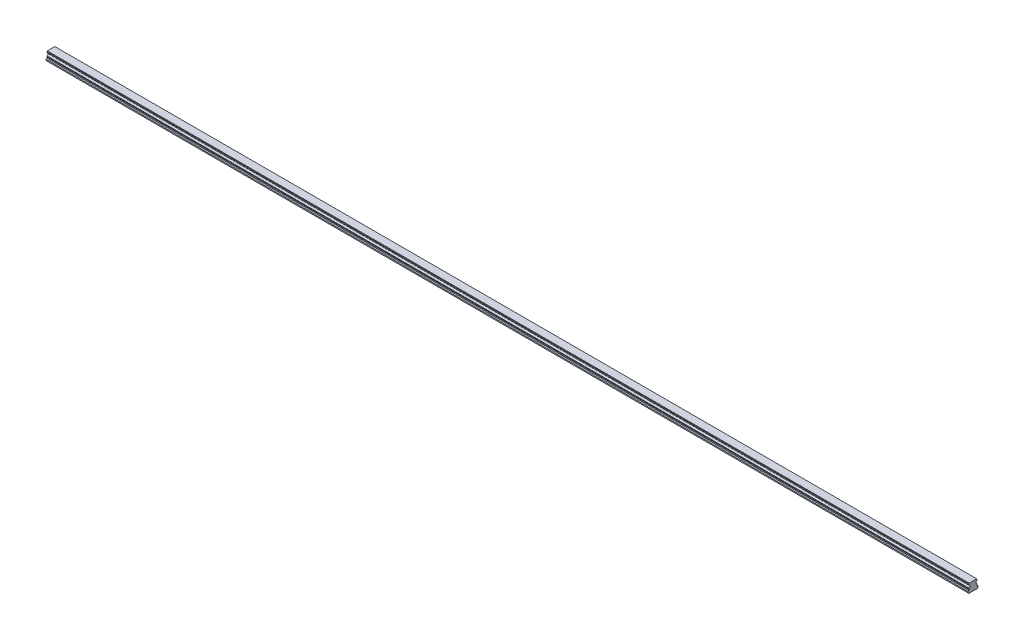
ISO-10303-21;
HEADER;
FILE_DESCRIPTION(('STEP AP214'),'2;1');
FILE_NAME('part.step','',(''),(''),'','','');
FILE_SCHEMA(('AUTOMOTIVE_DESIGN { 1 0 10303 214 1 1 1 1 }'));
ENDSEC;
DATA;
#1=APPLICATION_CONTEXT('core data for automotive mechanical design processes');
#2=APPLICATION_PROTOCOL_DEFINITION('international standard','automotive_design',2000,#1);
#3=PRODUCT_CONTEXT('',#1,'mechanical');
#4=PRODUCT('Part','Part','',(#3));
#5=PRODUCT_RELATED_PRODUCT_CATEGORY('part','',(#4));
#6=PRODUCT_DEFINITION_FORMATION('','',#4);
#7=PRODUCT_DEFINITION_CONTEXT('part definition',#1,'design');
#8=PRODUCT_DEFINITION('design','',#6,#7);
#9=PRODUCT_DEFINITION_SHAPE('','',#8);
#10=(LENGTH_UNIT() NAMED_UNIT(*) SI_UNIT(.MILLI.,.METRE.));
#11=(NAMED_UNIT(*) PLANE_ANGLE_UNIT() SI_UNIT($,.RADIAN.));
#12=(NAMED_UNIT(*) SI_UNIT($,.STERADIAN.) SOLID_ANGLE_UNIT());
#13=UNCERTAINTY_MEASURE_WITH_UNIT(LENGTH_MEASURE(1.E-05),#10,'distance_accuracy_value','');
#14=(GEOMETRIC_REPRESENTATION_CONTEXT(3) GLOBAL_UNCERTAINTY_ASSIGNED_CONTEXT((#13)) GLOBAL_UNIT_ASSIGNED_CONTEXT((#10,
#11,#12)) REPRESENTATION_CONTEXT('',''));
#15=CARTESIAN_POINT('',(0.,0.,0.));
#16=DIRECTION('',(0.,0.,1.));
#17=DIRECTION('',(1.,0.,0.));
#18=AXIS2_PLACEMENT_3D('',#15,#16,#17);
#19=CARTESIAN_POINT('',(2250.,0.499999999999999,0.));
#20=DIRECTION('',(0.,-1.,0.));
#21=DIRECTION('',(0.,0.,-1.));
#22=AXIS2_PLACEMENT_3D('',#19,#20,#21);
#23=CONICAL_SURFACE('',#22,3.5,0.785398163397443);
#24=CARTESIAN_POINT('',(2250.,1.00000000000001,0.));
#25=DIRECTION('',(0.,1.,0.));
#26=DIRECTION('',(0.,0.,1.));
#27=AXIS2_PLACEMENT_3D('',#24,#25,#26);
#28=CIRCLE('',#27,3.);
#29=CARTESIAN_POINT('',(2250.,1.00000000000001,3.));
#30=VERTEX_POINT('',#29);
#31=EDGE_CURVE('E11',#30,#30,#28,.F.);
#32=ORIENTED_EDGE('',*,*,#31,.F.);
#33=EDGE_LOOP('',(#32));
#34=FACE_BOUND('',#33,.T.);
#35=CARTESIAN_POINT('',(2250.,0.499999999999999,0.));
#36=DIRECTION('',(0.,1.,0.));
#37=DIRECTION('',(0.,0.,1.));
#38=AXIS2_PLACEMENT_3D('',#35,#36,#37);
#39=CIRCLE('',#38,3.5);
#40=CARTESIAN_POINT('',(2250.,0.5,3.5));
#41=VERTEX_POINT('',#40);
#42=EDGE_CURVE('E854',#41,#41,#39,.T.);
#43=ORIENTED_EDGE('',*,*,#42,.F.);
#44=EDGE_LOOP('',(#43));
#45=FACE_BOUND('',#44,.T.);
#46=ADVANCED_FACE('F39',(#34,#45),#23,.F.);
#47=CARTESIAN_POINT('',(2250.,12.,0.));
#48=DIRECTION('',(0.,-1.,0.));
#49=DIRECTION('',(0.,0.,-1.));
#50=AXIS2_PLACEMENT_3D('',#47,#48,#49);
#51=CYLINDRICAL_SURFACE('',#50,3.);
#52=ORIENTED_EDGE('',*,*,#31,.T.);
#53=EDGE_LOOP('',(#52));
#54=FACE_BOUND('',#53,.T.);
#55=CARTESIAN_POINT('',(2250.,12.,0.));
#56=DIRECTION('',(0.,-1.,0.));
#57=DIRECTION('',(0.,0.,-1.));
#58=AXIS2_PLACEMENT_3D('',#55,#56,#57);
#59=CIRCLE('',#58,3.);
#60=CARTESIAN_POINT('',(2250.,12.,-3.));
#61=VERTEX_POINT('',#60);
#62=EDGE_CURVE('E49',#61,#61,#59,.T.);
#63=ORIENTED_EDGE('',*,*,#62,.F.);
#64=EDGE_LOOP('',(#63));
#65=FACE_BOUND('',#64,.T.);
#66=ADVANCED_FACE('F1256',(#54,#65),#51,.F.);
#67=CARTESIAN_POINT('',(2250.,12.,0.));
#68=DIRECTION('',(0.,-1.,0.));
#69=DIRECTION('',(0.,0.,-1.));
#70=AXIS2_PLACEMENT_3D('',#67,#68,#69);
#71=PLANE('',#70);
#72=CARTESIAN_POINT('',(2250.,12.,0.));
#73=DIRECTION('',(0.,-1.,0.));
#74=DIRECTION('',(0.,0.,-1.));
#75=AXIS2_PLACEMENT_3D('',#72,#73,#74);
#76=CIRCLE('',#75,2.5);
#77=CARTESIAN_POINT('',(2250.,12.,-2.5));
#78=VERTEX_POINT('',#77);
#79=EDGE_CURVE('E42',#78,#78,#76,.T.);
#80=ORIENTED_EDGE('',*,*,#79,.F.);
#81=EDGE_LOOP('',(#80));
#82=FACE_BOUND('',#81,.T.);
#83=ORIENTED_EDGE('',*,*,#62,.T.);
#84=EDGE_LOOP('',(#83));
#85=FACE_BOUND('',#84,.T.);
#86=ADVANCED_FACE('F1261',(#82,#85),#71,.T.);
#87=CARTESIAN_POINT('',(2190.,0.499999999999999,0.));
#88=DIRECTION('',(0.,-1.,0.));
#89=DIRECTION('',(0.,0.,-1.));
#90=AXIS2_PLACEMENT_3D('',#87,#88,#89);
#91=CONICAL_SURFACE('',#90,3.5,0.785398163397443);
#92=CARTESIAN_POINT('',(2190.,1.00000000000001,0.));
#93=DIRECTION('',(0.,1.,0.));
#94=DIRECTION('',(0.,0.,1.));
#95=AXIS2_PLACEMENT_3D('',#92,#93,#94);
#96=CIRCLE('',#95,3.);
#97=CARTESIAN_POINT('',(2190.,1.00000000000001,3.));
#98=VERTEX_POINT('',#97);
#99=EDGE_CURVE('E850',#98,#98,#96,.F.);
#100=ORIENTED_EDGE('',*,*,#99,.F.);
#101=EDGE_LOOP('',(#100));
#102=FACE_BOUND('',#101,.T.);
#103=CARTESIAN_POINT('',(2190.,0.499999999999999,0.));
#104=DIRECTION('',(0.,1.,0.));
#105=DIRECTION('',(0.,0.,1.));
#106=AXIS2_PLACEMENT_3D('',#103,#104,#105);
#107=CIRCLE('',#106,3.5);
#108=CARTESIAN_POINT('',(2190.,0.5,3.5));
#109=VERTEX_POINT('',#108);
#110=EDGE_CURVE('E842',#109,#109,#107,.T.);
#111=ORIENTED_EDGE('',*,*,#110,.F.);
#112=EDGE_LOOP('',(#111));
#113=FACE_BOUND('',#112,.T.);
#114=ADVANCED_FACE('F1756',(#102,#113),#91,.F.);
#115=CARTESIAN_POINT('',(2190.,12.,0.));
#116=DIRECTION('',(0.,-1.,0.));
#117=DIRECTION('',(0.,0.,-1.));
#118=AXIS2_PLACEMENT_3D('',#115,#116,#117);
#119=CYLINDRICAL_SURFACE('',#118,3.);
#120=ORIENTED_EDGE('',*,*,#99,.T.);
#121=EDGE_LOOP('',(#120));
#122=FACE_BOUND('',#121,.T.);
#123=CARTESIAN_POINT('',(2190.,12.,0.));
#124=DIRECTION('',(0.,-1.,0.));
#125=DIRECTION('',(0.,0.,-1.));
#126=AXIS2_PLACEMENT_3D('',#123,#124,#125);
#127=CIRCLE('',#126,3.);
#128=CARTESIAN_POINT('',(2190.,12.,-3.));
#129=VERTEX_POINT('',#128);
#130=EDGE_CURVE('E846',#129,#129,#127,.T.);
#131=ORIENTED_EDGE('',*,*,#130,.F.);
#132=EDGE_LOOP('',(#131));
#133=FACE_BOUND('',#132,.T.);
#134=ADVANCED_FACE('F1752',(#122,#133),#119,.F.);
#135=CARTESIAN_POINT('',(2190.,12.,0.));
#136=DIRECTION('',(0.,-1.,0.));
#137=DIRECTION('',(0.,0.,-1.));
#138=AXIS2_PLACEMENT_3D('',#135,#136,#137);
#139=PLANE('',#138);
#140=CARTESIAN_POINT('',(2190.,12.,0.));
#141=DIRECTION('',(0.,-1.,0.));
#142=DIRECTION('',(0.,0.,-1.));
#143=AXIS2_PLACEMENT_3D('',#140,#141,#142);
#144=CIRCLE('',#143,2.5);
#145=CARTESIAN_POINT('',(2190.,12.,-2.5));
#146=VERTEX_POINT('',#145);
#147=EDGE_CURVE('E1000',#146,#146,#144,.T.);
#148=ORIENTED_EDGE('',*,*,#147,.F.);
#149=EDGE_LOOP('',(#148));
#150=FACE_BOUND('',#149,.T.);
#151=ORIENTED_EDGE('',*,*,#130,.T.);
#152=EDGE_LOOP('',(#151));
#153=FACE_BOUND('',#152,.T.);
#154=ADVANCED_FACE('F1748',(#150,#153),#139,.T.);
#155=CARTESIAN_POINT('',(2130.,0.499999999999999,0.));
#156=DIRECTION('',(0.,-1.,0.));
#157=DIRECTION('',(0.,0.,-1.));
#158=AXIS2_PLACEMENT_3D('',#155,#156,#157);
#159=CONICAL_SURFACE('',#158,3.5,0.785398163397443);
#160=CARTESIAN_POINT('',(2130.,1.00000000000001,0.));
#161=DIRECTION('',(0.,1.,0.));
#162=DIRECTION('',(0.,0.,1.));
#163=AXIS2_PLACEMENT_3D('',#160,#161,#162);
#164=CIRCLE('',#163,3.);
#165=CARTESIAN_POINT('',(2130.,1.00000000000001,3.));
#166=VERTEX_POINT('',#165);
#167=EDGE_CURVE('E838',#166,#166,#164,.F.);
#168=ORIENTED_EDGE('',*,*,#167,.F.);
#169=EDGE_LOOP('',(#168));
#170=FACE_BOUND('',#169,.T.);
#171=CARTESIAN_POINT('',(2130.,0.499999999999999,0.));
#172=DIRECTION('',(0.,1.,0.));
#173=DIRECTION('',(0.,0.,1.));
#174=AXIS2_PLACEMENT_3D('',#171,#172,#173);
#175=CIRCLE('',#174,3.5);
#176=CARTESIAN_POINT('',(2130.,0.5,3.5));
#177=VERTEX_POINT('',#176);
#178=EDGE_CURVE('E830',#177,#177,#175,.T.);
#179=ORIENTED_EDGE('',*,*,#178,.F.);
#180=EDGE_LOOP('',(#179));
#181=FACE_BOUND('',#180,.T.);
#182=ADVANCED_FACE('F1744',(#170,#181),#159,.F.);
#183=CARTESIAN_POINT('',(2130.,12.,0.));
#184=DIRECTION('',(0.,-1.,0.));
#185=DIRECTION('',(0.,0.,-1.));
#186=AXIS2_PLACEMENT_3D('',#183,#184,#185);
#187=CYLINDRICAL_SURFACE('',#186,3.);
#188=ORIENTED_EDGE('',*,*,#167,.T.);
#189=EDGE_LOOP('',(#188));
#190=FACE_BOUND('',#189,.T.);
#191=CARTESIAN_POINT('',(2130.,12.,0.));
#192=DIRECTION('',(0.,-1.,0.));
#193=DIRECTION('',(0.,0.,-1.));
#194=AXIS2_PLACEMENT_3D('',#191,#192,#193);
#195=CIRCLE('',#194,3.);
#196=CARTESIAN_POINT('',(2130.,12.,-3.));
#197=VERTEX_POINT('',#196);
#198=EDGE_CURVE('E834',#197,#197,#195,.T.);
#199=ORIENTED_EDGE('',*,*,#198,.F.);
#200=EDGE_LOOP('',(#199));
#201=FACE_BOUND('',#200,.T.);
#202=ADVANCED_FACE('F1740',(#190,#201),#187,.F.);
#203=CARTESIAN_POINT('',(2130.,12.,0.));
#204=DIRECTION('',(0.,-1.,0.));
#205=DIRECTION('',(0.,0.,-1.));
#206=AXIS2_PLACEMENT_3D('',#203,#204,#205);
#207=PLANE('',#206);
#208=CARTESIAN_POINT('',(2130.,12.,0.));
#209=DIRECTION('',(0.,-1.,0.));
#210=DIRECTION('',(0.,0.,-1.));
#211=AXIS2_PLACEMENT_3D('',#208,#209,#210);
#212=CIRCLE('',#211,2.5);
#213=CARTESIAN_POINT('',(2130.,12.,-2.5));
#214=VERTEX_POINT('',#213);
#215=EDGE_CURVE('E997',#214,#214,#212,.T.);
#216=ORIENTED_EDGE('',*,*,#215,.F.);
#217=EDGE_LOOP('',(#216));
#218=FACE_BOUND('',#217,.T.);
#219=ORIENTED_EDGE('',*,*,#198,.T.);
#220=EDGE_LOOP('',(#219));
#221=FACE_BOUND('',#220,.T.);
#222=ADVANCED_FACE('F1736',(#218,#221),#207,.T.);
#223=CARTESIAN_POINT('',(2070.,0.499999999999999,0.));
#224=DIRECTION('',(0.,-1.,0.));
#225=DIRECTION('',(0.,0.,-1.));
#226=AXIS2_PLACEMENT_3D('',#223,#224,#225);
#227=CONICAL_SURFACE('',#226,3.5,0.785398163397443);
#228=CARTESIAN_POINT('',(2070.,1.00000000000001,0.));
#229=DIRECTION('',(0.,1.,0.));
#230=DIRECTION('',(0.,0.,1.));
#231=AXIS2_PLACEMENT_3D('',#228,#229,#230);
#232=CIRCLE('',#231,3.);
#233=CARTESIAN_POINT('',(2070.,1.00000000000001,3.));
#234=VERTEX_POINT('',#233);
#235=EDGE_CURVE('E826',#234,#234,#232,.F.);
#236=ORIENTED_EDGE('',*,*,#235,.F.);
#237=EDGE_LOOP('',(#236));
#238=FACE_BOUND('',#237,.T.);
#239=CARTESIAN_POINT('',(2070.,0.499999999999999,0.));
#240=DIRECTION('',(0.,1.,0.));
#241=DIRECTION('',(0.,0.,1.));
#242=AXIS2_PLACEMENT_3D('',#239,#240,#241);
#243=CIRCLE('',#242,3.5);
#244=CARTESIAN_POINT('',(2070.,0.5,3.5));
#245=VERTEX_POINT('',#244);
#246=EDGE_CURVE('E818',#245,#245,#243,.T.);
#247=ORIENTED_EDGE('',*,*,#246,.F.);
#248=EDGE_LOOP('',(#247));
#249=FACE_BOUND('',#248,.T.);
#250=ADVANCED_FACE('F1732',(#238,#249),#227,.F.);
#251=CARTESIAN_POINT('',(2070.,12.,0.));
#252=DIRECTION('',(0.,-1.,0.));
#253=DIRECTION('',(0.,0.,-1.));
#254=AXIS2_PLACEMENT_3D('',#251,#252,#253);
#255=CYLINDRICAL_SURFACE('',#254,3.);
#256=ORIENTED_EDGE('',*,*,#235,.T.);
#257=EDGE_LOOP('',(#256));
#258=FACE_BOUND('',#257,.T.);
#259=CARTESIAN_POINT('',(2070.,12.,0.));
#260=DIRECTION('',(0.,-1.,0.));
#261=DIRECTION('',(0.,0.,-1.));
#262=AXIS2_PLACEMENT_3D('',#259,#260,#261);
#263=CIRCLE('',#262,3.);
#264=CARTESIAN_POINT('',(2070.,12.,-3.));
#265=VERTEX_POINT('',#264);
#266=EDGE_CURVE('E822',#265,#265,#263,.T.);
#267=ORIENTED_EDGE('',*,*,#266,.F.);
#268=EDGE_LOOP('',(#267));
#269=FACE_BOUND('',#268,.T.);
#270=ADVANCED_FACE('F1728',(#258,#269),#255,.F.);
#271=CARTESIAN_POINT('',(2070.,12.,0.));
#272=DIRECTION('',(0.,-1.,0.));
#273=DIRECTION('',(0.,0.,-1.));
#274=AXIS2_PLACEMENT_3D('',#271,#272,#273);
#275=PLANE('',#274);
#276=CARTESIAN_POINT('',(2070.,12.,0.));
#277=DIRECTION('',(0.,-1.,0.));
#278=DIRECTION('',(0.,0.,-1.));
#279=AXIS2_PLACEMENT_3D('',#276,#277,#278);
#280=CIRCLE('',#279,2.5);
#281=CARTESIAN_POINT('',(2070.,12.,-2.5));
#282=VERTEX_POINT('',#281);
#283=EDGE_CURVE('E993',#282,#282,#280,.T.);
#284=ORIENTED_EDGE('',*,*,#283,.F.);
#285=EDGE_LOOP('',(#284));
#286=FACE_BOUND('',#285,.T.);
#287=ORIENTED_EDGE('',*,*,#266,.T.);
#288=EDGE_LOOP('',(#287));
#289=FACE_BOUND('',#288,.T.);
#290=ADVANCED_FACE('F1724',(#286,#289),#275,.T.);
#291=CARTESIAN_POINT('',(2010.,0.499999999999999,0.));
#292=DIRECTION('',(0.,-1.,0.));
#293=DIRECTION('',(0.,0.,-1.));
#294=AXIS2_PLACEMENT_3D('',#291,#292,#293);
#295=CONICAL_SURFACE('',#294,3.5,0.785398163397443);
#296=CARTESIAN_POINT('',(2010.,1.00000000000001,0.));
#297=DIRECTION('',(0.,1.,0.));
#298=DIRECTION('',(0.,0.,1.));
#299=AXIS2_PLACEMENT_3D('',#296,#297,#298);
#300=CIRCLE('',#299,3.);
#301=CARTESIAN_POINT('',(2010.,1.00000000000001,3.));
#302=VERTEX_POINT('',#301);
#303=EDGE_CURVE('E814',#302,#302,#300,.F.);
#304=ORIENTED_EDGE('',*,*,#303,.F.);
#305=EDGE_LOOP('',(#304));
#306=FACE_BOUND('',#305,.T.);
#307=CARTESIAN_POINT('',(2010.,0.499999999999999,0.));
#308=DIRECTION('',(0.,1.,0.));
#309=DIRECTION('',(0.,0.,1.));
#310=AXIS2_PLACEMENT_3D('',#307,#308,#309);
#311=CIRCLE('',#310,3.5);
#312=CARTESIAN_POINT('',(2010.,0.5,3.5));
#313=VERTEX_POINT('',#312);
#314=EDGE_CURVE('E806',#313,#313,#311,.T.);
#315=ORIENTED_EDGE('',*,*,#314,.F.);
#316=EDGE_LOOP('',(#315));
#317=FACE_BOUND('',#316,.T.);
#318=ADVANCED_FACE('F1720',(#306,#317),#295,.F.);
#319=CARTESIAN_POINT('',(2010.,12.,0.));
#320=DIRECTION('',(0.,-1.,0.));
#321=DIRECTION('',(0.,0.,-1.));
#322=AXIS2_PLACEMENT_3D('',#319,#320,#321);
#323=CYLINDRICAL_SURFACE('',#322,3.);
#324=ORIENTED_EDGE('',*,*,#303,.T.);
#325=EDGE_LOOP('',(#324));
#326=FACE_BOUND('',#325,.T.);
#327=CARTESIAN_POINT('',(2010.,12.,0.));
#328=DIRECTION('',(0.,-1.,0.));
#329=DIRECTION('',(0.,0.,-1.));
#330=AXIS2_PLACEMENT_3D('',#327,#328,#329);
#331=CIRCLE('',#330,3.);
#332=CARTESIAN_POINT('',(2010.,12.,-3.));
#333=VERTEX_POINT('',#332);
#334=EDGE_CURVE('E810',#333,#333,#331,.T.);
#335=ORIENTED_EDGE('',*,*,#334,.F.);
#336=EDGE_LOOP('',(#335));
#337=FACE_BOUND('',#336,.T.);
#338=ADVANCED_FACE('F1716',(#326,#337),#323,.F.);
#339=CARTESIAN_POINT('',(2010.,12.,0.));
#340=DIRECTION('',(0.,-1.,0.));
#341=DIRECTION('',(0.,0.,-1.));
#342=AXIS2_PLACEMENT_3D('',#339,#340,#341);
#343=PLANE('',#342);
#344=CARTESIAN_POINT('',(2010.,12.,0.));
#345=DIRECTION('',(0.,-1.,0.));
#346=DIRECTION('',(0.,0.,-1.));
#347=AXIS2_PLACEMENT_3D('',#344,#345,#346);
#348=CIRCLE('',#347,2.5);
#349=CARTESIAN_POINT('',(2010.,12.,-2.5));
#350=VERTEX_POINT('',#349);
#351=EDGE_CURVE('E989',#350,#350,#348,.T.);
#352=ORIENTED_EDGE('',*,*,#351,.F.);
#353=EDGE_LOOP('',(#352));
#354=FACE_BOUND('',#353,.T.);
#355=ORIENTED_EDGE('',*,*,#334,.T.);
#356=EDGE_LOOP('',(#355));
#357=FACE_BOUND('',#356,.T.);
#358=ADVANCED_FACE('F1712',(#354,#357),#343,.T.);
#359=CARTESIAN_POINT('',(1950.,0.499999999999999,0.));
#360=DIRECTION('',(0.,-1.,0.));
#361=DIRECTION('',(0.,0.,-1.));
#362=AXIS2_PLACEMENT_3D('',#359,#360,#361);
#363=CONICAL_SURFACE('',#362,3.5,0.785398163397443);
#364=CARTESIAN_POINT('',(1950.,1.00000000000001,0.));
#365=DIRECTION('',(0.,1.,0.));
#366=DIRECTION('',(0.,0.,1.));
#367=AXIS2_PLACEMENT_3D('',#364,#365,#366);
#368=CIRCLE('',#367,3.);
#369=CARTESIAN_POINT('',(1950.,1.00000000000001,3.));
#370=VERTEX_POINT('',#369);
#371=EDGE_CURVE('E802',#370,#370,#368,.F.);
#372=ORIENTED_EDGE('',*,*,#371,.F.);
#373=EDGE_LOOP('',(#372));
#374=FACE_BOUND('',#373,.T.);
#375=CARTESIAN_POINT('',(1950.,0.499999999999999,0.));
#376=DIRECTION('',(0.,1.,0.));
#377=DIRECTION('',(0.,0.,1.));
#378=AXIS2_PLACEMENT_3D('',#375,#376,#377);
#379=CIRCLE('',#378,3.5);
#380=CARTESIAN_POINT('',(1950.,0.5,3.5));
#381=VERTEX_POINT('',#380);
#382=EDGE_CURVE('E794',#381,#381,#379,.T.);
#383=ORIENTED_EDGE('',*,*,#382,.F.);
#384=EDGE_LOOP('',(#383));
#385=FACE_BOUND('',#384,.T.);
#386=ADVANCED_FACE('F1708',(#374,#385),#363,.F.);
#387=CARTESIAN_POINT('',(1950.,12.,0.));
#388=DIRECTION('',(0.,-1.,0.));
#389=DIRECTION('',(0.,0.,-1.));
#390=AXIS2_PLACEMENT_3D('',#387,#388,#389);
#391=CYLINDRICAL_SURFACE('',#390,3.);
#392=ORIENTED_EDGE('',*,*,#371,.T.);
#393=EDGE_LOOP('',(#392));
#394=FACE_BOUND('',#393,.T.);
#395=CARTESIAN_POINT('',(1950.,12.,0.));
#396=DIRECTION('',(0.,-1.,0.));
#397=DIRECTION('',(0.,0.,-1.));
#398=AXIS2_PLACEMENT_3D('',#395,#396,#397);
#399=CIRCLE('',#398,3.);
#400=CARTESIAN_POINT('',(1950.,12.,-3.));
#401=VERTEX_POINT('',#400);
#402=EDGE_CURVE('E798',#401,#401,#399,.T.);
#403=ORIENTED_EDGE('',*,*,#402,.F.);
#404=EDGE_LOOP('',(#403));
#405=FACE_BOUND('',#404,.T.);
#406=ADVANCED_FACE('F1704',(#394,#405),#391,.F.);
#407=CARTESIAN_POINT('',(1950.,12.,0.));
#408=DIRECTION('',(0.,-1.,0.));
#409=DIRECTION('',(0.,0.,-1.));
#410=AXIS2_PLACEMENT_3D('',#407,#408,#409);
#411=PLANE('',#410);
#412=CARTESIAN_POINT('',(1950.,12.,0.));
#413=DIRECTION('',(0.,-1.,0.));
#414=DIRECTION('',(0.,0.,-1.));
#415=AXIS2_PLACEMENT_3D('',#412,#413,#414);
#416=CIRCLE('',#415,2.5);
#417=CARTESIAN_POINT('',(1950.,12.,-2.5));
#418=VERTEX_POINT('',#417);
#419=EDGE_CURVE('E985',#418,#418,#416,.T.);
#420=ORIENTED_EDGE('',*,*,#419,.F.);
#421=EDGE_LOOP('',(#420));
#422=FACE_BOUND('',#421,.T.);
#423=ORIENTED_EDGE('',*,*,#402,.T.);
#424=EDGE_LOOP('',(#423));
#425=FACE_BOUND('',#424,.T.);
#426=ADVANCED_FACE('F1700',(#422,#425),#411,.T.);
#427=CARTESIAN_POINT('',(1890.,0.499999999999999,0.));
#428=DIRECTION('',(0.,-1.,0.));
#429=DIRECTION('',(0.,0.,-1.));
#430=AXIS2_PLACEMENT_3D('',#427,#428,#429);
#431=CONICAL_SURFACE('',#430,3.5,0.785398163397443);
#432=CARTESIAN_POINT('',(1890.,1.00000000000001,0.));
#433=DIRECTION('',(0.,1.,0.));
#434=DIRECTION('',(0.,0.,1.));
#435=AXIS2_PLACEMENT_3D('',#432,#433,#434);
#436=CIRCLE('',#435,3.);
#437=CARTESIAN_POINT('',(1890.,1.00000000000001,3.));
#438=VERTEX_POINT('',#437);
#439=EDGE_CURVE('E790',#438,#438,#436,.F.);
#440=ORIENTED_EDGE('',*,*,#439,.F.);
#441=EDGE_LOOP('',(#440));
#442=FACE_BOUND('',#441,.T.);
#443=CARTESIAN_POINT('',(1890.,0.499999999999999,0.));
#444=DIRECTION('',(0.,1.,0.));
#445=DIRECTION('',(0.,0.,1.));
#446=AXIS2_PLACEMENT_3D('',#443,#444,#445);
#447=CIRCLE('',#446,3.5);
#448=CARTESIAN_POINT('',(1890.,0.5,3.5));
#449=VERTEX_POINT('',#448);
#450=EDGE_CURVE('E782',#449,#449,#447,.T.);
#451=ORIENTED_EDGE('',*,*,#450,.F.);
#452=EDGE_LOOP('',(#451));
#453=FACE_BOUND('',#452,.T.);
#454=ADVANCED_FACE('F1696',(#442,#453),#431,.F.);
#455=CARTESIAN_POINT('',(1890.,12.,0.));
#456=DIRECTION('',(0.,-1.,0.));
#457=DIRECTION('',(0.,0.,-1.));
#458=AXIS2_PLACEMENT_3D('',#455,#456,#457);
#459=CYLINDRICAL_SURFACE('',#458,3.);
#460=ORIENTED_EDGE('',*,*,#439,.T.);
#461=EDGE_LOOP('',(#460));
#462=FACE_BOUND('',#461,.T.);
#463=CARTESIAN_POINT('',(1890.,12.,0.));
#464=DIRECTION('',(0.,-1.,0.));
#465=DIRECTION('',(0.,0.,-1.));
#466=AXIS2_PLACEMENT_3D('',#463,#464,#465);
#467=CIRCLE('',#466,3.);
#468=CARTESIAN_POINT('',(1890.,12.,-3.));
#469=VERTEX_POINT('',#468);
#470=EDGE_CURVE('E786',#469,#469,#467,.T.);
#471=ORIENTED_EDGE('',*,*,#470,.F.);
#472=EDGE_LOOP('',(#471));
#473=FACE_BOUND('',#472,.T.);
#474=ADVANCED_FACE('F1692',(#462,#473),#459,.F.);
#475=CARTESIAN_POINT('',(1890.,12.,0.));
#476=DIRECTION('',(0.,-1.,0.));
#477=DIRECTION('',(0.,0.,-1.));
#478=AXIS2_PLACEMENT_3D('',#475,#476,#477);
#479=PLANE('',#478);
#480=CARTESIAN_POINT('',(1890.,12.,0.));
#481=DIRECTION('',(0.,-1.,0.));
#482=DIRECTION('',(0.,0.,-1.));
#483=AXIS2_PLACEMENT_3D('',#480,#481,#482);
#484=CIRCLE('',#483,2.5);
#485=CARTESIAN_POINT('',(1890.,12.,-2.5));
#486=VERTEX_POINT('',#485);
#487=EDGE_CURVE('E981',#486,#486,#484,.T.);
#488=ORIENTED_EDGE('',*,*,#487,.F.);
#489=EDGE_LOOP('',(#488));
#490=FACE_BOUND('',#489,.T.);
#491=ORIENTED_EDGE('',*,*,#470,.T.);
#492=EDGE_LOOP('',(#491));
#493=FACE_BOUND('',#492,.T.);
#494=ADVANCED_FACE('F1688',(#490,#493),#479,.T.);
#495=CARTESIAN_POINT('',(1830.,0.499999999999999,0.));
#496=DIRECTION('',(0.,-1.,0.));
#497=DIRECTION('',(0.,0.,-1.));
#498=AXIS2_PLACEMENT_3D('',#495,#496,#497);
#499=CONICAL_SURFACE('',#498,3.5,0.785398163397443);
#500=CARTESIAN_POINT('',(1830.,1.00000000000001,0.));
#501=DIRECTION('',(0.,1.,0.));
#502=DIRECTION('',(0.,0.,1.));
#503=AXIS2_PLACEMENT_3D('',#500,#501,#502);
#504=CIRCLE('',#503,3.);
#505=CARTESIAN_POINT('',(1830.,1.00000000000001,3.));
#506=VERTEX_POINT('',#505);
#507=EDGE_CURVE('E778',#506,#506,#504,.F.);
#508=ORIENTED_EDGE('',*,*,#507,.F.);
#509=EDGE_LOOP('',(#508));
#510=FACE_BOUND('',#509,.T.);
#511=CARTESIAN_POINT('',(1830.,0.499999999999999,0.));
#512=DIRECTION('',(0.,1.,0.));
#513=DIRECTION('',(0.,0.,1.));
#514=AXIS2_PLACEMENT_3D('',#511,#512,#513);
#515=CIRCLE('',#514,3.5);
#516=CARTESIAN_POINT('',(1830.,0.5,3.5));
#517=VERTEX_POINT('',#516);
#518=EDGE_CURVE('E770',#517,#517,#515,.T.);
#519=ORIENTED_EDGE('',*,*,#518,.F.);
#520=EDGE_LOOP('',(#519));
#521=FACE_BOUND('',#520,.T.);
#522=ADVANCED_FACE('F1684',(#510,#521),#499,.F.);
#523=CARTESIAN_POINT('',(1830.,12.,0.));
#524=DIRECTION('',(0.,-1.,0.));
#525=DIRECTION('',(0.,0.,-1.));
#526=AXIS2_PLACEMENT_3D('',#523,#524,#525);
#527=CYLINDRICAL_SURFACE('',#526,3.);
#528=ORIENTED_EDGE('',*,*,#507,.T.);
#529=EDGE_LOOP('',(#528));
#530=FACE_BOUND('',#529,.T.);
#531=CARTESIAN_POINT('',(1830.,12.,0.));
#532=DIRECTION('',(0.,-1.,0.));
#533=DIRECTION('',(0.,0.,-1.));
#534=AXIS2_PLACEMENT_3D('',#531,#532,#533);
#535=CIRCLE('',#534,3.);
#536=CARTESIAN_POINT('',(1830.,12.,-3.));
#537=VERTEX_POINT('',#536);
#538=EDGE_CURVE('E774',#537,#537,#535,.T.);
#539=ORIENTED_EDGE('',*,*,#538,.F.);
#540=EDGE_LOOP('',(#539));
#541=FACE_BOUND('',#540,.T.);
#542=ADVANCED_FACE('F1680',(#530,#541),#527,.F.);
#543=CARTESIAN_POINT('',(1830.,12.,0.));
#544=DIRECTION('',(0.,-1.,0.));
#545=DIRECTION('',(0.,0.,-1.));
#546=AXIS2_PLACEMENT_3D('',#543,#544,#545);
#547=PLANE('',#546);
#548=CARTESIAN_POINT('',(1830.,12.,0.));
#549=DIRECTION('',(0.,-1.,0.));
#550=DIRECTION('',(0.,0.,-1.));
#551=AXIS2_PLACEMENT_3D('',#548,#549,#550);
#552=CIRCLE('',#551,2.5);
#553=CARTESIAN_POINT('',(1830.,12.,-2.5));
#554=VERTEX_POINT('',#553);
#555=EDGE_CURVE('E977',#554,#554,#552,.T.);
#556=ORIENTED_EDGE('',*,*,#555,.F.);
#557=EDGE_LOOP('',(#556));
#558=FACE_BOUND('',#557,.T.);
#559=ORIENTED_EDGE('',*,*,#538,.T.);
#560=EDGE_LOOP('',(#559));
#561=FACE_BOUND('',#560,.T.);
#562=ADVANCED_FACE('F1676',(#558,#561),#547,.T.);
#563=CARTESIAN_POINT('',(1770.,0.499999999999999,0.));
#564=DIRECTION('',(0.,-1.,0.));
#565=DIRECTION('',(0.,0.,-1.));
#566=AXIS2_PLACEMENT_3D('',#563,#564,#565);
#567=CONICAL_SURFACE('',#566,3.5,0.785398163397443);
#568=CARTESIAN_POINT('',(1770.,1.00000000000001,0.));
#569=DIRECTION('',(0.,1.,0.));
#570=DIRECTION('',(0.,0.,1.));
#571=AXIS2_PLACEMENT_3D('',#568,#569,#570);
#572=CIRCLE('',#571,3.);
#573=CARTESIAN_POINT('',(1770.,1.00000000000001,3.));
#574=VERTEX_POINT('',#573);
#575=EDGE_CURVE('E766',#574,#574,#572,.F.);
#576=ORIENTED_EDGE('',*,*,#575,.F.);
#577=EDGE_LOOP('',(#576));
#578=FACE_BOUND('',#577,.T.);
#579=CARTESIAN_POINT('',(1770.,0.499999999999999,0.));
#580=DIRECTION('',(0.,1.,0.));
#581=DIRECTION('',(0.,0.,1.));
#582=AXIS2_PLACEMENT_3D('',#579,#580,#581);
#583=CIRCLE('',#582,3.5);
#584=CARTESIAN_POINT('',(1770.,0.5,3.5));
#585=VERTEX_POINT('',#584);
#586=EDGE_CURVE('E758',#585,#585,#583,.T.);
#587=ORIENTED_EDGE('',*,*,#586,.F.);
#588=EDGE_LOOP('',(#587));
#589=FACE_BOUND('',#588,.T.);
#590=ADVANCED_FACE('F1672',(#578,#589),#567,.F.);
#591=CARTESIAN_POINT('',(1770.,12.,0.));
#592=DIRECTION('',(0.,-1.,0.));
#593=DIRECTION('',(0.,0.,-1.));
#594=AXIS2_PLACEMENT_3D('',#591,#592,#593);
#595=CYLINDRICAL_SURFACE('',#594,3.);
#596=ORIENTED_EDGE('',*,*,#575,.T.);
#597=EDGE_LOOP('',(#596));
#598=FACE_BOUND('',#597,.T.);
#599=CARTESIAN_POINT('',(1770.,12.,0.));
#600=DIRECTION('',(0.,-1.,0.));
#601=DIRECTION('',(0.,0.,-1.));
#602=AXIS2_PLACEMENT_3D('',#599,#600,#601);
#603=CIRCLE('',#602,3.);
#604=CARTESIAN_POINT('',(1770.,12.,-3.));
#605=VERTEX_POINT('',#604);
#606=EDGE_CURVE('E762',#605,#605,#603,.T.);
#607=ORIENTED_EDGE('',*,*,#606,.F.);
#608=EDGE_LOOP('',(#607));
#609=FACE_BOUND('',#608,.T.);
#610=ADVANCED_FACE('F1668',(#598,#609),#595,.F.);
#611=CARTESIAN_POINT('',(1770.,12.,0.));
#612=DIRECTION('',(0.,-1.,0.));
#613=DIRECTION('',(0.,0.,-1.));
#614=AXIS2_PLACEMENT_3D('',#611,#612,#613);
#615=PLANE('',#614);
#616=CARTESIAN_POINT('',(1770.,12.,0.));
#617=DIRECTION('',(0.,-1.,0.));
#618=DIRECTION('',(0.,0.,-1.));
#619=AXIS2_PLACEMENT_3D('',#616,#617,#618);
#620=CIRCLE('',#619,2.5);
#621=CARTESIAN_POINT('',(1770.,12.,-2.5));
#622=VERTEX_POINT('',#621);
#623=EDGE_CURVE('E973',#622,#622,#620,.T.);
#624=ORIENTED_EDGE('',*,*,#623,.F.);
#625=EDGE_LOOP('',(#624));
#626=FACE_BOUND('',#625,.T.);
#627=ORIENTED_EDGE('',*,*,#606,.T.);
#628=EDGE_LOOP('',(#627));
#629=FACE_BOUND('',#628,.T.);
#630=ADVANCED_FACE('F1664',(#626,#629),#615,.T.);
#631=CARTESIAN_POINT('',(1710.,0.499999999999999,0.));
#632=DIRECTION('',(0.,-1.,0.));
#633=DIRECTION('',(0.,0.,-1.));
#634=AXIS2_PLACEMENT_3D('',#631,#632,#633);
#635=CONICAL_SURFACE('',#634,3.5,0.785398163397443);
#636=CARTESIAN_POINT('',(1710.,1.00000000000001,0.));
#637=DIRECTION('',(0.,1.,0.));
#638=DIRECTION('',(0.,0.,1.));
#639=AXIS2_PLACEMENT_3D('',#636,#637,#638);
#640=CIRCLE('',#639,3.);
#641=CARTESIAN_POINT('',(1710.,1.00000000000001,3.));
#642=VERTEX_POINT('',#641);
#643=EDGE_CURVE('E754',#642,#642,#640,.F.);
#644=ORIENTED_EDGE('',*,*,#643,.F.);
#645=EDGE_LOOP('',(#644));
#646=FACE_BOUND('',#645,.T.);
#647=CARTESIAN_POINT('',(1710.,0.499999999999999,0.));
#648=DIRECTION('',(0.,1.,0.));
#649=DIRECTION('',(0.,0.,1.));
#650=AXIS2_PLACEMENT_3D('',#647,#648,#649);
#651=CIRCLE('',#650,3.5);
#652=CARTESIAN_POINT('',(1710.,0.5,3.5));
#653=VERTEX_POINT('',#652);
#654=EDGE_CURVE('E746',#653,#653,#651,.T.);
#655=ORIENTED_EDGE('',*,*,#654,.F.);
#656=EDGE_LOOP('',(#655));
#657=FACE_BOUND('',#656,.T.);
#658=ADVANCED_FACE('F1660',(#646,#657),#635,.F.);
#659=CARTESIAN_POINT('',(1710.,12.,0.));
#660=DIRECTION('',(0.,-1.,0.));
#661=DIRECTION('',(0.,0.,-1.));
#662=AXIS2_PLACEMENT_3D('',#659,#660,#661);
#663=CYLINDRICAL_SURFACE('',#662,3.);
#664=ORIENTED_EDGE('',*,*,#643,.T.);
#665=EDGE_LOOP('',(#664));
#666=FACE_BOUND('',#665,.T.);
#667=CARTESIAN_POINT('',(1710.,12.,0.));
#668=DIRECTION('',(0.,-1.,0.));
#669=DIRECTION('',(0.,0.,-1.));
#670=AXIS2_PLACEMENT_3D('',#667,#668,#669);
#671=CIRCLE('',#670,3.);
#672=CARTESIAN_POINT('',(1710.,12.,-3.));
#673=VERTEX_POINT('',#672);
#674=EDGE_CURVE('E750',#673,#673,#671,.T.);
#675=ORIENTED_EDGE('',*,*,#674,.F.);
#676=EDGE_LOOP('',(#675));
#677=FACE_BOUND('',#676,.T.);
#678=ADVANCED_FACE('F1656',(#666,#677),#663,.F.);
#679=CARTESIAN_POINT('',(1710.,12.,0.));
#680=DIRECTION('',(0.,-1.,0.));
#681=DIRECTION('',(0.,0.,-1.));
#682=AXIS2_PLACEMENT_3D('',#679,#680,#681);
#683=PLANE('',#682);
#684=CARTESIAN_POINT('',(1710.,12.,0.));
#685=DIRECTION('',(0.,-1.,0.));
#686=DIRECTION('',(0.,0.,-1.));
#687=AXIS2_PLACEMENT_3D('',#684,#685,#686);
#688=CIRCLE('',#687,2.5);
#689=CARTESIAN_POINT('',(1710.,12.,-2.5));
#690=VERTEX_POINT('',#689);
#691=EDGE_CURVE('E969',#690,#690,#688,.T.);
#692=ORIENTED_EDGE('',*,*,#691,.F.);
#693=EDGE_LOOP('',(#692));
#694=FACE_BOUND('',#693,.T.);
#695=ORIENTED_EDGE('',*,*,#674,.T.);
#696=EDGE_LOOP('',(#695));
#697=FACE_BOUND('',#696,.T.);
#698=ADVANCED_FACE('F1652',(#694,#697),#683,.T.);
#699=CARTESIAN_POINT('',(1650.,0.499999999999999,0.));
#700=DIRECTION('',(0.,-1.,0.));
#701=DIRECTION('',(0.,0.,-1.));
#702=AXIS2_PLACEMENT_3D('',#699,#700,#701);
#703=CONICAL_SURFACE('',#702,3.5,0.785398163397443);
#704=CARTESIAN_POINT('',(1650.,1.00000000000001,0.));
#705=DIRECTION('',(0.,1.,0.));
#706=DIRECTION('',(0.,0.,1.));
#707=AXIS2_PLACEMENT_3D('',#704,#705,#706);
#708=CIRCLE('',#707,3.);
#709=CARTESIAN_POINT('',(1650.,1.00000000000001,3.));
#710=VERTEX_POINT('',#709);
#711=EDGE_CURVE('E742',#710,#710,#708,.F.);
#712=ORIENTED_EDGE('',*,*,#711,.F.);
#713=EDGE_LOOP('',(#712));
#714=FACE_BOUND('',#713,.T.);
#715=CARTESIAN_POINT('',(1650.,0.499999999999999,0.));
#716=DIRECTION('',(0.,1.,0.));
#717=DIRECTION('',(0.,0.,1.));
#718=AXIS2_PLACEMENT_3D('',#715,#716,#717);
#719=CIRCLE('',#718,3.5);
#720=CARTESIAN_POINT('',(1650.,0.5,3.5));
#721=VERTEX_POINT('',#720);
#722=EDGE_CURVE('E734',#721,#721,#719,.T.);
#723=ORIENTED_EDGE('',*,*,#722,.F.);
#724=EDGE_LOOP('',(#723));
#725=FACE_BOUND('',#724,.T.);
#726=ADVANCED_FACE('F1648',(#714,#725),#703,.F.);
#727=CARTESIAN_POINT('',(1650.,12.,0.));
#728=DIRECTION('',(0.,-1.,0.));
#729=DIRECTION('',(0.,0.,-1.));
#730=AXIS2_PLACEMENT_3D('',#727,#728,#729);
#731=CYLINDRICAL_SURFACE('',#730,3.);
#732=ORIENTED_EDGE('',*,*,#711,.T.);
#733=EDGE_LOOP('',(#732));
#734=FACE_BOUND('',#733,.T.);
#735=CARTESIAN_POINT('',(1650.,12.,0.));
#736=DIRECTION('',(0.,-1.,0.));
#737=DIRECTION('',(0.,0.,-1.));
#738=AXIS2_PLACEMENT_3D('',#735,#736,#737);
#739=CIRCLE('',#738,3.);
#740=CARTESIAN_POINT('',(1650.,12.,-3.));
#741=VERTEX_POINT('',#740);
#742=EDGE_CURVE('E738',#741,#741,#739,.T.);
#743=ORIENTED_EDGE('',*,*,#742,.F.);
#744=EDGE_LOOP('',(#743));
#745=FACE_BOUND('',#744,.T.);
#746=ADVANCED_FACE('F1644',(#734,#745),#731,.F.);
#747=CARTESIAN_POINT('',(1650.,12.,0.));
#748=DIRECTION('',(0.,-1.,0.));
#749=DIRECTION('',(0.,0.,-1.));
#750=AXIS2_PLACEMENT_3D('',#747,#748,#749);
#751=PLANE('',#750);
#752=CARTESIAN_POINT('',(1650.,12.,0.));
#753=DIRECTION('',(0.,-1.,0.));
#754=DIRECTION('',(0.,0.,-1.));
#755=AXIS2_PLACEMENT_3D('',#752,#753,#754);
#756=CIRCLE('',#755,2.5);
#757=CARTESIAN_POINT('',(1650.,12.,-2.5));
#758=VERTEX_POINT('',#757);
#759=EDGE_CURVE('E965',#758,#758,#756,.T.);
#760=ORIENTED_EDGE('',*,*,#759,.F.);
#761=EDGE_LOOP('',(#760));
#762=FACE_BOUND('',#761,.T.);
#763=ORIENTED_EDGE('',*,*,#742,.T.);
#764=EDGE_LOOP('',(#763));
#765=FACE_BOUND('',#764,.T.);
#766=ADVANCED_FACE('F1640',(#762,#765),#751,.T.);
#767=CARTESIAN_POINT('',(1590.,0.499999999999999,0.));
#768=DIRECTION('',(0.,-1.,0.));
#769=DIRECTION('',(0.,0.,-1.));
#770=AXIS2_PLACEMENT_3D('',#767,#768,#769);
#771=CONICAL_SURFACE('',#770,3.5,0.785398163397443);
#772=CARTESIAN_POINT('',(1590.,1.00000000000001,0.));
#773=DIRECTION('',(0.,1.,0.));
#774=DIRECTION('',(0.,0.,1.));
#775=AXIS2_PLACEMENT_3D('',#772,#773,#774);
#776=CIRCLE('',#775,3.);
#777=CARTESIAN_POINT('',(1590.,1.00000000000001,3.));
#778=VERTEX_POINT('',#777);
#779=EDGE_CURVE('E730',#778,#778,#776,.F.);
#780=ORIENTED_EDGE('',*,*,#779,.F.);
#781=EDGE_LOOP('',(#780));
#782=FACE_BOUND('',#781,.T.);
#783=CARTESIAN_POINT('',(1590.,0.499999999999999,0.));
#784=DIRECTION('',(0.,1.,0.));
#785=DIRECTION('',(0.,0.,1.));
#786=AXIS2_PLACEMENT_3D('',#783,#784,#785);
#787=CIRCLE('',#786,3.5);
#788=CARTESIAN_POINT('',(1590.,0.5,3.5));
#789=VERTEX_POINT('',#788);
#790=EDGE_CURVE('E722',#789,#789,#787,.T.);
#791=ORIENTED_EDGE('',*,*,#790,.F.);
#792=EDGE_LOOP('',(#791));
#793=FACE_BOUND('',#792,.T.);
#794=ADVANCED_FACE('F1636',(#782,#793),#771,.F.);
#795=CARTESIAN_POINT('',(1590.,12.,0.));
#796=DIRECTION('',(0.,-1.,0.));
#797=DIRECTION('',(0.,0.,-1.));
#798=AXIS2_PLACEMENT_3D('',#795,#796,#797);
#799=CYLINDRICAL_SURFACE('',#798,3.);
#800=ORIENTED_EDGE('',*,*,#779,.T.);
#801=EDGE_LOOP('',(#800));
#802=FACE_BOUND('',#801,.T.);
#803=CARTESIAN_POINT('',(1590.,12.,0.));
#804=DIRECTION('',(0.,-1.,0.));
#805=DIRECTION('',(0.,0.,-1.));
#806=AXIS2_PLACEMENT_3D('',#803,#804,#805);
#807=CIRCLE('',#806,3.);
#808=CARTESIAN_POINT('',(1590.,12.,-3.));
#809=VERTEX_POINT('',#808);
#810=EDGE_CURVE('E726',#809,#809,#807,.T.);
#811=ORIENTED_EDGE('',*,*,#810,.F.);
#812=EDGE_LOOP('',(#811));
#813=FACE_BOUND('',#812,.T.);
#814=ADVANCED_FACE('F1632',(#802,#813),#799,.F.);
#815=CARTESIAN_POINT('',(1590.,12.,0.));
#816=DIRECTION('',(0.,-1.,0.));
#817=DIRECTION('',(0.,0.,-1.));
#818=AXIS2_PLACEMENT_3D('',#815,#816,#817);
#819=PLANE('',#818);
#820=CARTESIAN_POINT('',(1590.,12.,0.));
#821=DIRECTION('',(0.,-1.,0.));
#822=DIRECTION('',(0.,0.,-1.));
#823=AXIS2_PLACEMENT_3D('',#820,#821,#822);
#824=CIRCLE('',#823,2.5);
#825=CARTESIAN_POINT('',(1590.,12.,-2.5));
#826=VERTEX_POINT('',#825);
#827=EDGE_CURVE('E961',#826,#826,#824,.T.);
#828=ORIENTED_EDGE('',*,*,#827,.F.);
#829=EDGE_LOOP('',(#828));
#830=FACE_BOUND('',#829,.T.);
#831=ORIENTED_EDGE('',*,*,#810,.T.);
#832=EDGE_LOOP('',(#831));
#833=FACE_BOUND('',#832,.T.);
#834=ADVANCED_FACE('F1628',(#830,#833),#819,.T.);
#835=CARTESIAN_POINT('',(1530.,0.499999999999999,0.));
#836=DIRECTION('',(0.,-1.,0.));
#837=DIRECTION('',(0.,0.,-1.));
#838=AXIS2_PLACEMENT_3D('',#835,#836,#837);
#839=CONICAL_SURFACE('',#838,3.5,0.785398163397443);
#840=CARTESIAN_POINT('',(1530.,1.00000000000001,0.));
#841=DIRECTION('',(0.,1.,0.));
#842=DIRECTION('',(0.,0.,1.));
#843=AXIS2_PLACEMENT_3D('',#840,#841,#842);
#844=CIRCLE('',#843,3.);
#845=CARTESIAN_POINT('',(1530.,1.00000000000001,3.));
#846=VERTEX_POINT('',#845);
#847=EDGE_CURVE('E718',#846,#846,#844,.F.);
#848=ORIENTED_EDGE('',*,*,#847,.F.);
#849=EDGE_LOOP('',(#848));
#850=FACE_BOUND('',#849,.T.);
#851=CARTESIAN_POINT('',(1530.,0.499999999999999,0.));
#852=DIRECTION('',(0.,1.,0.));
#853=DIRECTION('',(0.,0.,1.));
#854=AXIS2_PLACEMENT_3D('',#851,#852,#853);
#855=CIRCLE('',#854,3.5);
#856=CARTESIAN_POINT('',(1530.,0.5,3.5));
#857=VERTEX_POINT('',#856);
#858=EDGE_CURVE('E710',#857,#857,#855,.T.);
#859=ORIENTED_EDGE('',*,*,#858,.F.);
#860=EDGE_LOOP('',(#859));
#861=FACE_BOUND('',#860,.T.);
#862=ADVANCED_FACE('F1624',(#850,#861),#839,.F.);
#863=CARTESIAN_POINT('',(1530.,12.,0.));
#864=DIRECTION('',(0.,-1.,0.));
#865=DIRECTION('',(0.,0.,-1.));
#866=AXIS2_PLACEMENT_3D('',#863,#864,#865);
#867=CYLINDRICAL_SURFACE('',#866,3.);
#868=ORIENTED_EDGE('',*,*,#847,.T.);
#869=EDGE_LOOP('',(#868));
#870=FACE_BOUND('',#869,.T.);
#871=CARTESIAN_POINT('',(1530.,12.,0.));
#872=DIRECTION('',(0.,-1.,0.));
#873=DIRECTION('',(0.,0.,-1.));
#874=AXIS2_PLACEMENT_3D('',#871,#872,#873);
#875=CIRCLE('',#874,3.);
#876=CARTESIAN_POINT('',(1530.,12.,-3.));
#877=VERTEX_POINT('',#876);
#878=EDGE_CURVE('E714',#877,#877,#875,.T.);
#879=ORIENTED_EDGE('',*,*,#878,.F.);
#880=EDGE_LOOP('',(#879));
#881=FACE_BOUND('',#880,.T.);
#882=ADVANCED_FACE('F1620',(#870,#881),#867,.F.);
#883=CARTESIAN_POINT('',(1530.,12.,0.));
#884=DIRECTION('',(0.,-1.,0.));
#885=DIRECTION('',(0.,0.,-1.));
#886=AXIS2_PLACEMENT_3D('',#883,#884,#885);
#887=PLANE('',#886);
#888=CARTESIAN_POINT('',(1530.,12.,0.));
#889=DIRECTION('',(0.,-1.,0.));
#890=DIRECTION('',(0.,0.,-1.));
#891=AXIS2_PLACEMENT_3D('',#888,#889,#890);
#892=CIRCLE('',#891,2.5);
#893=CARTESIAN_POINT('',(1530.,12.,-2.5));
#894=VERTEX_POINT('',#893);
#895=EDGE_CURVE('E957',#894,#894,#892,.T.);
#896=ORIENTED_EDGE('',*,*,#895,.F.);
#897=EDGE_LOOP('',(#896));
#898=FACE_BOUND('',#897,.T.);
#899=ORIENTED_EDGE('',*,*,#878,.T.);
#900=EDGE_LOOP('',(#899));
#901=FACE_BOUND('',#900,.T.);
#902=ADVANCED_FACE('F1616',(#898,#901),#887,.T.);
#903=CARTESIAN_POINT('',(1470.,0.499999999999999,0.));
#904=DIRECTION('',(0.,-1.,0.));
#905=DIRECTION('',(0.,0.,-1.));
#906=AXIS2_PLACEMENT_3D('',#903,#904,#905);
#907=CONICAL_SURFACE('',#906,3.5,0.785398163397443);
#908=CARTESIAN_POINT('',(1470.,1.00000000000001,0.));
#909=DIRECTION('',(0.,1.,0.));
#910=DIRECTION('',(0.,0.,1.));
#911=AXIS2_PLACEMENT_3D('',#908,#909,#910);
#912=CIRCLE('',#911,3.);
#913=CARTESIAN_POINT('',(1470.,1.00000000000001,3.));
#914=VERTEX_POINT('',#913);
#915=EDGE_CURVE('E706',#914,#914,#912,.F.);
#916=ORIENTED_EDGE('',*,*,#915,.F.);
#917=EDGE_LOOP('',(#916));
#918=FACE_BOUND('',#917,.T.);
#919=CARTESIAN_POINT('',(1470.,0.499999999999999,0.));
#920=DIRECTION('',(0.,1.,0.));
#921=DIRECTION('',(0.,0.,1.));
#922=AXIS2_PLACEMENT_3D('',#919,#920,#921);
#923=CIRCLE('',#922,3.5);
#924=CARTESIAN_POINT('',(1470.,0.5,3.5));
#925=VERTEX_POINT('',#924);
#926=EDGE_CURVE('E698',#925,#925,#923,.T.);
#927=ORIENTED_EDGE('',*,*,#926,.F.);
#928=EDGE_LOOP('',(#927));
#929=FACE_BOUND('',#928,.T.);
#930=ADVANCED_FACE('F1612',(#918,#929),#907,.F.);
#931=CARTESIAN_POINT('',(1470.,12.,0.));
#932=DIRECTION('',(0.,-1.,0.));
#933=DIRECTION('',(0.,0.,-1.));
#934=AXIS2_PLACEMENT_3D('',#931,#932,#933);
#935=CYLINDRICAL_SURFACE('',#934,3.);
#936=ORIENTED_EDGE('',*,*,#915,.T.);
#937=EDGE_LOOP('',(#936));
#938=FACE_BOUND('',#937,.T.);
#939=CARTESIAN_POINT('',(1470.,12.,0.));
#940=DIRECTION('',(0.,-1.,0.));
#941=DIRECTION('',(0.,0.,-1.));
#942=AXIS2_PLACEMENT_3D('',#939,#940,#941);
#943=CIRCLE('',#942,3.);
#944=CARTESIAN_POINT('',(1470.,12.,-3.));
#945=VERTEX_POINT('',#944);
#946=EDGE_CURVE('E702',#945,#945,#943,.T.);
#947=ORIENTED_EDGE('',*,*,#946,.F.);
#948=EDGE_LOOP('',(#947));
#949=FACE_BOUND('',#948,.T.);
#950=ADVANCED_FACE('F1608',(#938,#949),#935,.F.);
#951=CARTESIAN_POINT('',(1470.,12.,0.));
#952=DIRECTION('',(0.,-1.,0.));
#953=DIRECTION('',(0.,0.,-1.));
#954=AXIS2_PLACEMENT_3D('',#951,#952,#953);
#955=PLANE('',#954);
#956=CARTESIAN_POINT('',(1470.,12.,0.));
#957=DIRECTION('',(0.,-1.,0.));
#958=DIRECTION('',(0.,0.,-1.));
#959=AXIS2_PLACEMENT_3D('',#956,#957,#958);
#960=CIRCLE('',#959,2.5);
#961=CARTESIAN_POINT('',(1470.,12.,-2.5));
#962=VERTEX_POINT('',#961);
#963=EDGE_CURVE('E953',#962,#962,#960,.T.);
#964=ORIENTED_EDGE('',*,*,#963,.F.);
#965=EDGE_LOOP('',(#964));
#966=FACE_BOUND('',#965,.T.);
#967=ORIENTED_EDGE('',*,*,#946,.T.);
#968=EDGE_LOOP('',(#967));
#969=FACE_BOUND('',#968,.T.);
#970=ADVANCED_FACE('F1604',(#966,#969),#955,.T.);
#971=CARTESIAN_POINT('',(1410.,0.499999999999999,0.));
#972=DIRECTION('',(0.,-1.,0.));
#973=DIRECTION('',(0.,0.,-1.));
#974=AXIS2_PLACEMENT_3D('',#971,#972,#973);
#975=CONICAL_SURFACE('',#974,3.5,0.785398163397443);
#976=CARTESIAN_POINT('',(1410.,1.00000000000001,0.));
#977=DIRECTION('',(0.,1.,0.));
#978=DIRECTION('',(0.,0.,1.));
#979=AXIS2_PLACEMENT_3D('',#976,#977,#978);
#980=CIRCLE('',#979,3.);
#981=CARTESIAN_POINT('',(1410.,1.00000000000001,3.));
#982=VERTEX_POINT('',#981);
#983=EDGE_CURVE('E694',#982,#982,#980,.F.);
#984=ORIENTED_EDGE('',*,*,#983,.F.);
#985=EDGE_LOOP('',(#984));
#986=FACE_BOUND('',#985,.T.);
#987=CARTESIAN_POINT('',(1410.,0.499999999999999,0.));
#988=DIRECTION('',(0.,1.,0.));
#989=DIRECTION('',(0.,0.,1.));
#990=AXIS2_PLACEMENT_3D('',#987,#988,#989);
#991=CIRCLE('',#990,3.5);
#992=CARTESIAN_POINT('',(1410.,0.5,3.5));
#993=VERTEX_POINT('',#992);
#994=EDGE_CURVE('E686',#993,#993,#991,.T.);
#995=ORIENTED_EDGE('',*,*,#994,.F.);
#996=EDGE_LOOP('',(#995));
#997=FACE_BOUND('',#996,.T.);
#998=ADVANCED_FACE('F1600',(#986,#997),#975,.F.);
#999=CARTESIAN_POINT('',(1410.,12.,0.));
#1000=DIRECTION('',(0.,-1.,0.));
#1001=DIRECTION('',(0.,0.,-1.));
#1002=AXIS2_PLACEMENT_3D('',#999,#1000,#1001);
#1003=CYLINDRICAL_SURFACE('',#1002,3.);
#1004=ORIENTED_EDGE('',*,*,#983,.T.);
#1005=EDGE_LOOP('',(#1004));
#1006=FACE_BOUND('',#1005,.T.);
#1007=CARTESIAN_POINT('',(1410.,12.,0.));
#1008=DIRECTION('',(0.,-1.,0.));
#1009=DIRECTION('',(0.,0.,-1.));
#1010=AXIS2_PLACEMENT_3D('',#1007,#1008,#1009);
#1011=CIRCLE('',#1010,3.);
#1012=CARTESIAN_POINT('',(1410.,12.,-3.));
#1013=VERTEX_POINT('',#1012);
#1014=EDGE_CURVE('E690',#1013,#1013,#1011,.T.);
#1015=ORIENTED_EDGE('',*,*,#1014,.F.);
#1016=EDGE_LOOP('',(#1015));
#1017=FACE_BOUND('',#1016,.T.);
#1018=ADVANCED_FACE('F1596',(#1006,#1017),#1003,.F.);
#1019=CARTESIAN_POINT('',(1410.,12.,0.));
#1020=DIRECTION('',(0.,-1.,0.));
#1021=DIRECTION('',(0.,0.,-1.));
#1022=AXIS2_PLACEMENT_3D('',#1019,#1020,#1021);
#1023=PLANE('',#1022);
#1024=CARTESIAN_POINT('',(1410.,12.,0.));
#1025=DIRECTION('',(0.,-1.,0.));
#1026=DIRECTION('',(0.,0.,-1.));
#1027=AXIS2_PLACEMENT_3D('',#1024,#1025,#1026);
#1028=CIRCLE('',#1027,2.5);
#1029=CARTESIAN_POINT('',(1410.,12.,-2.5));
#1030=VERTEX_POINT('',#1029);
#1031=EDGE_CURVE('E949',#1030,#1030,#1028,.T.);
#1032=ORIENTED_EDGE('',*,*,#1031,.F.);
#1033=EDGE_LOOP('',(#1032));
#1034=FACE_BOUND('',#1033,.T.);
#1035=ORIENTED_EDGE('',*,*,#1014,.T.);
#1036=EDGE_LOOP('',(#1035));
#1037=FACE_BOUND('',#1036,.T.);
#1038=ADVANCED_FACE('F1592',(#1034,#1037),#1023,.T.);
#1039=CARTESIAN_POINT('',(1350.,0.499999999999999,0.));
#1040=DIRECTION('',(0.,-1.,0.));
#1041=DIRECTION('',(0.,0.,-1.));
#1042=AXIS2_PLACEMENT_3D('',#1039,#1040,#1041);
#1043=CONICAL_SURFACE('',#1042,3.5,0.785398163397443);
#1044=CARTESIAN_POINT('',(1350.,1.00000000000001,0.));
#1045=DIRECTION('',(0.,1.,0.));
#1046=DIRECTION('',(0.,0.,1.));
#1047=AXIS2_PLACEMENT_3D('',#1044,#1045,#1046);
#1048=CIRCLE('',#1047,3.);
#1049=CARTESIAN_POINT('',(1350.,1.00000000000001,3.));
#1050=VERTEX_POINT('',#1049);
#1051=EDGE_CURVE('E682',#1050,#1050,#1048,.F.);
#1052=ORIENTED_EDGE('',*,*,#1051,.F.);
#1053=EDGE_LOOP('',(#1052));
#1054=FACE_BOUND('',#1053,.T.);
#1055=CARTESIAN_POINT('',(1350.,0.499999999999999,0.));
#1056=DIRECTION('',(0.,1.,0.));
#1057=DIRECTION('',(0.,0.,1.));
#1058=AXIS2_PLACEMENT_3D('',#1055,#1056,#1057);
#1059=CIRCLE('',#1058,3.5);
#1060=CARTESIAN_POINT('',(1350.,0.5,3.5));
#1061=VERTEX_POINT('',#1060);
#1062=EDGE_CURVE('E674',#1061,#1061,#1059,.T.);
#1063=ORIENTED_EDGE('',*,*,#1062,.F.);
#1064=EDGE_LOOP('',(#1063));
#1065=FACE_BOUND('',#1064,.T.);
#1066=ADVANCED_FACE('F1588',(#1054,#1065),#1043,.F.);
#1067=CARTESIAN_POINT('',(1350.,12.,0.));
#1068=DIRECTION('',(0.,-1.,0.));
#1069=DIRECTION('',(0.,0.,-1.));
#1070=AXIS2_PLACEMENT_3D('',#1067,#1068,#1069);
#1071=CYLINDRICAL_SURFACE('',#1070,3.);
#1072=ORIENTED_EDGE('',*,*,#1051,.T.);
#1073=EDGE_LOOP('',(#1072));
#1074=FACE_BOUND('',#1073,.T.);
#1075=CARTESIAN_POINT('',(1350.,12.,0.));
#1076=DIRECTION('',(0.,-1.,0.));
#1077=DIRECTION('',(0.,0.,-1.));
#1078=AXIS2_PLACEMENT_3D('',#1075,#1076,#1077);
#1079=CIRCLE('',#1078,3.);
#1080=CARTESIAN_POINT('',(1350.,12.,-3.));
#1081=VERTEX_POINT('',#1080);
#1082=EDGE_CURVE('E678',#1081,#1081,#1079,.T.);
#1083=ORIENTED_EDGE('',*,*,#1082,.F.);
#1084=EDGE_LOOP('',(#1083));
#1085=FACE_BOUND('',#1084,.T.);
#1086=ADVANCED_FACE('F1584',(#1074,#1085),#1071,.F.);
#1087=CARTESIAN_POINT('',(1350.,12.,0.));
#1088=DIRECTION('',(0.,-1.,0.));
#1089=DIRECTION('',(0.,0.,-1.));
#1090=AXIS2_PLACEMENT_3D('',#1087,#1088,#1089);
#1091=PLANE('',#1090);
#1092=CARTESIAN_POINT('',(1350.,12.,0.));
#1093=DIRECTION('',(0.,-1.,0.));
#1094=DIRECTION('',(0.,0.,-1.));
#1095=AXIS2_PLACEMENT_3D('',#1092,#1093,#1094);
#1096=CIRCLE('',#1095,2.5);
#1097=CARTESIAN_POINT('',(1350.,12.,-2.5));
#1098=VERTEX_POINT('',#1097);
#1099=EDGE_CURVE('E945',#1098,#1098,#1096,.T.);
#1100=ORIENTED_EDGE('',*,*,#1099,.F.);
#1101=EDGE_LOOP('',(#1100));
#1102=FACE_BOUND('',#1101,.T.);
#1103=ORIENTED_EDGE('',*,*,#1082,.T.);
#1104=EDGE_LOOP('',(#1103));
#1105=FACE_BOUND('',#1104,.T.);
#1106=ADVANCED_FACE('F1580',(#1102,#1105),#1091,.T.);
#1107=CARTESIAN_POINT('',(1290.,0.499999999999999,0.));
#1108=DIRECTION('',(0.,-1.,0.));
#1109=DIRECTION('',(0.,0.,-1.));
#1110=AXIS2_PLACEMENT_3D('',#1107,#1108,#1109);
#1111=CONICAL_SURFACE('',#1110,3.5,0.785398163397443);
#1112=CARTESIAN_POINT('',(1290.,1.00000000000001,0.));
#1113=DIRECTION('',(0.,1.,0.));
#1114=DIRECTION('',(0.,0.,1.));
#1115=AXIS2_PLACEMENT_3D('',#1112,#1113,#1114);
#1116=CIRCLE('',#1115,3.);
#1117=CARTESIAN_POINT('',(1290.,1.00000000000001,3.));
#1118=VERTEX_POINT('',#1117);
#1119=EDGE_CURVE('E670',#1118,#1118,#1116,.F.);
#1120=ORIENTED_EDGE('',*,*,#1119,.F.);
#1121=EDGE_LOOP('',(#1120));
#1122=FACE_BOUND('',#1121,.T.);
#1123=CARTESIAN_POINT('',(1290.,0.499999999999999,0.));
#1124=DIRECTION('',(0.,1.,0.));
#1125=DIRECTION('',(0.,0.,1.));
#1126=AXIS2_PLACEMENT_3D('',#1123,#1124,#1125);
#1127=CIRCLE('',#1126,3.5);
#1128=CARTESIAN_POINT('',(1290.,0.5,3.5));
#1129=VERTEX_POINT('',#1128);
#1130=EDGE_CURVE('E662',#1129,#1129,#1127,.T.);
#1131=ORIENTED_EDGE('',*,*,#1130,.F.);
#1132=EDGE_LOOP('',(#1131));
#1133=FACE_BOUND('',#1132,.T.);
#1134=ADVANCED_FACE('F1576',(#1122,#1133),#1111,.F.);
#1135=CARTESIAN_POINT('',(1290.,12.,0.));
#1136=DIRECTION('',(0.,-1.,0.));
#1137=DIRECTION('',(0.,0.,-1.));
#1138=AXIS2_PLACEMENT_3D('',#1135,#1136,#1137);
#1139=CYLINDRICAL_SURFACE('',#1138,3.);
#1140=ORIENTED_EDGE('',*,*,#1119,.T.);
#1141=EDGE_LOOP('',(#1140));
#1142=FACE_BOUND('',#1141,.T.);
#1143=CARTESIAN_POINT('',(1290.,12.,0.));
#1144=DIRECTION('',(0.,-1.,0.));
#1145=DIRECTION('',(0.,0.,-1.));
#1146=AXIS2_PLACEMENT_3D('',#1143,#1144,#1145);
#1147=CIRCLE('',#1146,3.);
#1148=CARTESIAN_POINT('',(1290.,12.,-3.));
#1149=VERTEX_POINT('',#1148);
#1150=EDGE_CURVE('E666',#1149,#1149,#1147,.T.);
#1151=ORIENTED_EDGE('',*,*,#1150,.F.);
#1152=EDGE_LOOP('',(#1151));
#1153=FACE_BOUND('',#1152,.T.);
#1154=ADVANCED_FACE('F1572',(#1142,#1153),#1139,.F.);
#1155=CARTESIAN_POINT('',(1290.,12.,0.));
#1156=DIRECTION('',(0.,-1.,0.));
#1157=DIRECTION('',(0.,0.,-1.));
#1158=AXIS2_PLACEMENT_3D('',#1155,#1156,#1157);
#1159=PLANE('',#1158);
#1160=CARTESIAN_POINT('',(1290.,12.,0.));
#1161=DIRECTION('',(0.,-1.,0.));
#1162=DIRECTION('',(0.,0.,-1.));
#1163=AXIS2_PLACEMENT_3D('',#1160,#1161,#1162);
#1164=CIRCLE('',#1163,2.5);
#1165=CARTESIAN_POINT('',(1290.,12.,-2.5));
#1166=VERTEX_POINT('',#1165);
#1167=EDGE_CURVE('E941',#1166,#1166,#1164,.T.);
#1168=ORIENTED_EDGE('',*,*,#1167,.F.);
#1169=EDGE_LOOP('',(#1168));
#1170=FACE_BOUND('',#1169,.T.);
#1171=ORIENTED_EDGE('',*,*,#1150,.T.);
#1172=EDGE_LOOP('',(#1171));
#1173=FACE_BOUND('',#1172,.T.);
#1174=ADVANCED_FACE('F1568',(#1170,#1173),#1159,.T.);
#1175=CARTESIAN_POINT('',(1230.,0.499999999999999,0.));
#1176=DIRECTION('',(0.,-1.,0.));
#1177=DIRECTION('',(0.,0.,-1.));
#1178=AXIS2_PLACEMENT_3D('',#1175,#1176,#1177);
#1179=CONICAL_SURFACE('',#1178,3.5,0.785398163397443);
#1180=CARTESIAN_POINT('',(1230.,1.00000000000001,0.));
#1181=DIRECTION('',(0.,1.,0.));
#1182=DIRECTION('',(0.,0.,1.));
#1183=AXIS2_PLACEMENT_3D('',#1180,#1181,#1182);
#1184=CIRCLE('',#1183,3.);
#1185=CARTESIAN_POINT('',(1230.,1.00000000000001,3.));
#1186=VERTEX_POINT('',#1185);
#1187=EDGE_CURVE('E658',#1186,#1186,#1184,.F.);
#1188=ORIENTED_EDGE('',*,*,#1187,.F.);
#1189=EDGE_LOOP('',(#1188));
#1190=FACE_BOUND('',#1189,.T.);
#1191=CARTESIAN_POINT('',(1230.,0.499999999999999,0.));
#1192=DIRECTION('',(0.,1.,0.));
#1193=DIRECTION('',(0.,0.,1.));
#1194=AXIS2_PLACEMENT_3D('',#1191,#1192,#1193);
#1195=CIRCLE('',#1194,3.5);
#1196=CARTESIAN_POINT('',(1230.,0.5,3.5));
#1197=VERTEX_POINT('',#1196);
#1198=EDGE_CURVE('E650',#1197,#1197,#1195,.T.);
#1199=ORIENTED_EDGE('',*,*,#1198,.F.);
#1200=EDGE_LOOP('',(#1199));
#1201=FACE_BOUND('',#1200,.T.);
#1202=ADVANCED_FACE('F1564',(#1190,#1201),#1179,.F.);
#1203=CARTESIAN_POINT('',(1230.,12.,0.));
#1204=DIRECTION('',(0.,-1.,0.));
#1205=DIRECTION('',(0.,0.,-1.));
#1206=AXIS2_PLACEMENT_3D('',#1203,#1204,#1205);
#1207=CYLINDRICAL_SURFACE('',#1206,3.);
#1208=ORIENTED_EDGE('',*,*,#1187,.T.);
#1209=EDGE_LOOP('',(#1208));
#1210=FACE_BOUND('',#1209,.T.);
#1211=CARTESIAN_POINT('',(1230.,12.,0.));
#1212=DIRECTION('',(0.,-1.,0.));
#1213=DIRECTION('',(0.,0.,-1.));
#1214=AXIS2_PLACEMENT_3D('',#1211,#1212,#1213);
#1215=CIRCLE('',#1214,3.);
#1216=CARTESIAN_POINT('',(1230.,12.,-3.));
#1217=VERTEX_POINT('',#1216);
#1218=EDGE_CURVE('E654',#1217,#1217,#1215,.T.);
#1219=ORIENTED_EDGE('',*,*,#1218,.F.);
#1220=EDGE_LOOP('',(#1219));
#1221=FACE_BOUND('',#1220,.T.);
#1222=ADVANCED_FACE('F1560',(#1210,#1221),#1207,.F.);
#1223=CARTESIAN_POINT('',(1230.,12.,0.));
#1224=DIRECTION('',(0.,-1.,0.));
#1225=DIRECTION('',(0.,0.,-1.));
#1226=AXIS2_PLACEMENT_3D('',#1223,#1224,#1225);
#1227=PLANE('',#1226);
#1228=CARTESIAN_POINT('',(1230.,12.,0.));
#1229=DIRECTION('',(0.,-1.,0.));
#1230=DIRECTION('',(0.,0.,-1.));
#1231=AXIS2_PLACEMENT_3D('',#1228,#1229,#1230);
#1232=CIRCLE('',#1231,2.5);
#1233=CARTESIAN_POINT('',(1230.,12.,-2.5));
#1234=VERTEX_POINT('',#1233);
#1235=EDGE_CURVE('E937',#1234,#1234,#1232,.T.);
#1236=ORIENTED_EDGE('',*,*,#1235,.F.);
#1237=EDGE_LOOP('',(#1236));
#1238=FACE_BOUND('',#1237,.T.);
#1239=ORIENTED_EDGE('',*,*,#1218,.T.);
#1240=EDGE_LOOP('',(#1239));
#1241=FACE_BOUND('',#1240,.T.);
#1242=ADVANCED_FACE('F1556',(#1238,#1241),#1227,.T.);
#1243=CARTESIAN_POINT('',(1170.,0.499999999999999,0.));
#1244=DIRECTION('',(0.,-1.,0.));
#1245=DIRECTION('',(0.,0.,-1.));
#1246=AXIS2_PLACEMENT_3D('',#1243,#1244,#1245);
#1247=CONICAL_SURFACE('',#1246,3.5,0.785398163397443);
#1248=CARTESIAN_POINT('',(1170.,1.00000000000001,0.));
#1249=DIRECTION('',(0.,1.,0.));
#1250=DIRECTION('',(0.,0.,1.));
#1251=AXIS2_PLACEMENT_3D('',#1248,#1249,#1250);
#1252=CIRCLE('',#1251,3.);
#1253=CARTESIAN_POINT('',(1170.,1.00000000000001,3.));
#1254=VERTEX_POINT('',#1253);
#1255=EDGE_CURVE('E646',#1254,#1254,#1252,.F.);
#1256=ORIENTED_EDGE('',*,*,#1255,.F.);
#1257=EDGE_LOOP('',(#1256));
#1258=FACE_BOUND('',#1257,.T.);
#1259=CARTESIAN_POINT('',(1170.,0.499999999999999,0.));
#1260=DIRECTION('',(0.,1.,0.));
#1261=DIRECTION('',(0.,0.,1.));
#1262=AXIS2_PLACEMENT_3D('',#1259,#1260,#1261);
#1263=CIRCLE('',#1262,3.5);
#1264=CARTESIAN_POINT('',(1170.,0.5,3.5));
#1265=VERTEX_POINT('',#1264);
#1266=EDGE_CURVE('E638',#1265,#1265,#1263,.T.);
#1267=ORIENTED_EDGE('',*,*,#1266,.F.);
#1268=EDGE_LOOP('',(#1267));
#1269=FACE_BOUND('',#1268,.T.);
#1270=ADVANCED_FACE('F1552',(#1258,#1269),#1247,.F.);
#1271=CARTESIAN_POINT('',(1170.,12.,0.));
#1272=DIRECTION('',(0.,-1.,0.));
#1273=DIRECTION('',(0.,0.,-1.));
#1274=AXIS2_PLACEMENT_3D('',#1271,#1272,#1273);
#1275=CYLINDRICAL_SURFACE('',#1274,3.);
#1276=ORIENTED_EDGE('',*,*,#1255,.T.);
#1277=EDGE_LOOP('',(#1276));
#1278=FACE_BOUND('',#1277,.T.);
#1279=CARTESIAN_POINT('',(1170.,12.,0.));
#1280=DIRECTION('',(0.,-1.,0.));
#1281=DIRECTION('',(0.,0.,-1.));
#1282=AXIS2_PLACEMENT_3D('',#1279,#1280,#1281);
#1283=CIRCLE('',#1282,3.);
#1284=CARTESIAN_POINT('',(1170.,12.,-3.));
#1285=VERTEX_POINT('',#1284);
#1286=EDGE_CURVE('E642',#1285,#1285,#1283,.T.);
#1287=ORIENTED_EDGE('',*,*,#1286,.F.);
#1288=EDGE_LOOP('',(#1287));
#1289=FACE_BOUND('',#1288,.T.);
#1290=ADVANCED_FACE('F1548',(#1278,#1289),#1275,.F.);
#1291=CARTESIAN_POINT('',(1170.,12.,0.));
#1292=DIRECTION('',(0.,-1.,0.));
#1293=DIRECTION('',(0.,0.,-1.));
#1294=AXIS2_PLACEMENT_3D('',#1291,#1292,#1293);
#1295=PLANE('',#1294);
#1296=CARTESIAN_POINT('',(1170.,12.,0.));
#1297=DIRECTION('',(0.,-1.,0.));
#1298=DIRECTION('',(0.,0.,-1.));
#1299=AXIS2_PLACEMENT_3D('',#1296,#1297,#1298);
#1300=CIRCLE('',#1299,2.5);
#1301=CARTESIAN_POINT('',(1170.,12.,-2.5));
#1302=VERTEX_POINT('',#1301);
#1303=EDGE_CURVE('E933',#1302,#1302,#1300,.T.);
#1304=ORIENTED_EDGE('',*,*,#1303,.F.);
#1305=EDGE_LOOP('',(#1304));
#1306=FACE_BOUND('',#1305,.T.);
#1307=ORIENTED_EDGE('',*,*,#1286,.T.);
#1308=EDGE_LOOP('',(#1307));
#1309=FACE_BOUND('',#1308,.T.);
#1310=ADVANCED_FACE('F1544',(#1306,#1309),#1295,.T.);
#1311=CARTESIAN_POINT('',(1110.,0.499999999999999,0.));
#1312=DIRECTION('',(0.,-1.,0.));
#1313=DIRECTION('',(0.,0.,-1.));
#1314=AXIS2_PLACEMENT_3D('',#1311,#1312,#1313);
#1315=CONICAL_SURFACE('',#1314,3.5,0.785398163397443);
#1316=CARTESIAN_POINT('',(1110.,1.00000000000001,0.));
#1317=DIRECTION('',(0.,1.,0.));
#1318=DIRECTION('',(0.,0.,1.));
#1319=AXIS2_PLACEMENT_3D('',#1316,#1317,#1318);
#1320=CIRCLE('',#1319,3.);
#1321=CARTESIAN_POINT('',(1110.,1.00000000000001,3.));
#1322=VERTEX_POINT('',#1321);
#1323=EDGE_CURVE('E634',#1322,#1322,#1320,.F.);
#1324=ORIENTED_EDGE('',*,*,#1323,.F.);
#1325=EDGE_LOOP('',(#1324));
#1326=FACE_BOUND('',#1325,.T.);
#1327=CARTESIAN_POINT('',(1110.,0.499999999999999,0.));
#1328=DIRECTION('',(0.,1.,0.));
#1329=DIRECTION('',(0.,0.,1.));
#1330=AXIS2_PLACEMENT_3D('',#1327,#1328,#1329);
#1331=CIRCLE('',#1330,3.5);
#1332=CARTESIAN_POINT('',(1110.,0.5,3.5));
#1333=VERTEX_POINT('',#1332);
#1334=EDGE_CURVE('E626',#1333,#1333,#1331,.T.);
#1335=ORIENTED_EDGE('',*,*,#1334,.F.);
#1336=EDGE_LOOP('',(#1335));
#1337=FACE_BOUND('',#1336,.T.);
#1338=ADVANCED_FACE('F1540',(#1326,#1337),#1315,.F.);
#1339=CARTESIAN_POINT('',(1110.,12.,0.));
#1340=DIRECTION('',(0.,-1.,0.));
#1341=DIRECTION('',(0.,0.,-1.));
#1342=AXIS2_PLACEMENT_3D('',#1339,#1340,#1341);
#1343=CYLINDRICAL_SURFACE('',#1342,3.);
#1344=ORIENTED_EDGE('',*,*,#1323,.T.);
#1345=EDGE_LOOP('',(#1344));
#1346=FACE_BOUND('',#1345,.T.);
#1347=CARTESIAN_POINT('',(1110.,12.,0.));
#1348=DIRECTION('',(0.,-1.,0.));
#1349=DIRECTION('',(0.,0.,-1.));
#1350=AXIS2_PLACEMENT_3D('',#1347,#1348,#1349);
#1351=CIRCLE('',#1350,3.);
#1352=CARTESIAN_POINT('',(1110.,12.,-3.));
#1353=VERTEX_POINT('',#1352);
#1354=EDGE_CURVE('E630',#1353,#1353,#1351,.T.);
#1355=ORIENTED_EDGE('',*,*,#1354,.F.);
#1356=EDGE_LOOP('',(#1355));
#1357=FACE_BOUND('',#1356,.T.);
#1358=ADVANCED_FACE('F1536',(#1346,#1357),#1343,.F.);
#1359=CARTESIAN_POINT('',(1110.,12.,0.));
#1360=DIRECTION('',(0.,-1.,0.));
#1361=DIRECTION('',(0.,0.,-1.));
#1362=AXIS2_PLACEMENT_3D('',#1359,#1360,#1361);
#1363=PLANE('',#1362);
#1364=CARTESIAN_POINT('',(1110.,12.,0.));
#1365=DIRECTION('',(0.,-1.,0.));
#1366=DIRECTION('',(0.,0.,-1.));
#1367=AXIS2_PLACEMENT_3D('',#1364,#1365,#1366);
#1368=CIRCLE('',#1367,2.5);
#1369=CARTESIAN_POINT('',(1110.,12.,-2.5));
#1370=VERTEX_POINT('',#1369);
#1371=EDGE_CURVE('E929',#1370,#1370,#1368,.T.);
#1372=ORIENTED_EDGE('',*,*,#1371,.F.);
#1373=EDGE_LOOP('',(#1372));
#1374=FACE_BOUND('',#1373,.T.);
#1375=ORIENTED_EDGE('',*,*,#1354,.T.);
#1376=EDGE_LOOP('',(#1375));
#1377=FACE_BOUND('',#1376,.T.);
#1378=ADVANCED_FACE('F1532',(#1374,#1377),#1363,.T.);
#1379=CARTESIAN_POINT('',(1050.,0.499999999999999,0.));
#1380=DIRECTION('',(0.,-1.,0.));
#1381=DIRECTION('',(0.,0.,-1.));
#1382=AXIS2_PLACEMENT_3D('',#1379,#1380,#1381);
#1383=CONICAL_SURFACE('',#1382,3.5,0.785398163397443);
#1384=CARTESIAN_POINT('',(1050.,1.00000000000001,0.));
#1385=DIRECTION('',(0.,1.,0.));
#1386=DIRECTION('',(0.,0.,1.));
#1387=AXIS2_PLACEMENT_3D('',#1384,#1385,#1386);
#1388=CIRCLE('',#1387,3.);
#1389=CARTESIAN_POINT('',(1050.,1.00000000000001,3.));
#1390=VERTEX_POINT('',#1389);
#1391=EDGE_CURVE('E622',#1390,#1390,#1388,.F.);
#1392=ORIENTED_EDGE('',*,*,#1391,.F.);
#1393=EDGE_LOOP('',(#1392));
#1394=FACE_BOUND('',#1393,.T.);
#1395=CARTESIAN_POINT('',(1050.,0.499999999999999,0.));
#1396=DIRECTION('',(0.,1.,0.));
#1397=DIRECTION('',(0.,0.,1.));
#1398=AXIS2_PLACEMENT_3D('',#1395,#1396,#1397);
#1399=CIRCLE('',#1398,3.5);
#1400=CARTESIAN_POINT('',(1050.,0.5,3.5));
#1401=VERTEX_POINT('',#1400);
#1402=EDGE_CURVE('E614',#1401,#1401,#1399,.T.);
#1403=ORIENTED_EDGE('',*,*,#1402,.F.);
#1404=EDGE_LOOP('',(#1403));
#1405=FACE_BOUND('',#1404,.T.);
#1406=ADVANCED_FACE('F1528',(#1394,#1405),#1383,.F.);
#1407=CARTESIAN_POINT('',(1050.,12.,0.));
#1408=DIRECTION('',(0.,-1.,0.));
#1409=DIRECTION('',(0.,0.,-1.));
#1410=AXIS2_PLACEMENT_3D('',#1407,#1408,#1409);
#1411=CYLINDRICAL_SURFACE('',#1410,3.);
#1412=ORIENTED_EDGE('',*,*,#1391,.T.);
#1413=EDGE_LOOP('',(#1412));
#1414=FACE_BOUND('',#1413,.T.);
#1415=CARTESIAN_POINT('',(1050.,12.,0.));
#1416=DIRECTION('',(0.,-1.,0.));
#1417=DIRECTION('',(0.,0.,-1.));
#1418=AXIS2_PLACEMENT_3D('',#1415,#1416,#1417);
#1419=CIRCLE('',#1418,3.);
#1420=CARTESIAN_POINT('',(1050.,12.,-3.));
#1421=VERTEX_POINT('',#1420);
#1422=EDGE_CURVE('E618',#1421,#1421,#1419,.T.);
#1423=ORIENTED_EDGE('',*,*,#1422,.F.);
#1424=EDGE_LOOP('',(#1423));
#1425=FACE_BOUND('',#1424,.T.);
#1426=ADVANCED_FACE('F1524',(#1414,#1425),#1411,.F.);
#1427=CARTESIAN_POINT('',(1050.,12.,0.));
#1428=DIRECTION('',(0.,-1.,0.));
#1429=DIRECTION('',(0.,0.,-1.));
#1430=AXIS2_PLACEMENT_3D('',#1427,#1428,#1429);
#1431=PLANE('',#1430);
#1432=CARTESIAN_POINT('',(1050.,12.,0.));
#1433=DIRECTION('',(0.,-1.,0.));
#1434=DIRECTION('',(0.,0.,-1.));
#1435=AXIS2_PLACEMENT_3D('',#1432,#1433,#1434);
#1436=CIRCLE('',#1435,2.5);
#1437=CARTESIAN_POINT('',(1050.,12.,-2.5));
#1438=VERTEX_POINT('',#1437);
#1439=EDGE_CURVE('E925',#1438,#1438,#1436,.T.);
#1440=ORIENTED_EDGE('',*,*,#1439,.F.);
#1441=EDGE_LOOP('',(#1440));
#1442=FACE_BOUND('',#1441,.T.);
#1443=ORIENTED_EDGE('',*,*,#1422,.T.);
#1444=EDGE_LOOP('',(#1443));
#1445=FACE_BOUND('',#1444,.T.);
#1446=ADVANCED_FACE('F1520',(#1442,#1445),#1431,.T.);
#1447=CARTESIAN_POINT('',(990.,0.499999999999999,0.));
#1448=DIRECTION('',(0.,-1.,0.));
#1449=DIRECTION('',(0.,0.,-1.));
#1450=AXIS2_PLACEMENT_3D('',#1447,#1448,#1449);
#1451=CONICAL_SURFACE('',#1450,3.5,0.785398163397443);
#1452=CARTESIAN_POINT('',(990.,1.00000000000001,0.));
#1453=DIRECTION('',(0.,1.,0.));
#1454=DIRECTION('',(0.,0.,1.));
#1455=AXIS2_PLACEMENT_3D('',#1452,#1453,#1454);
#1456=CIRCLE('',#1455,3.);
#1457=CARTESIAN_POINT('',(990.,1.00000000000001,3.));
#1458=VERTEX_POINT('',#1457);
#1459=EDGE_CURVE('E610',#1458,#1458,#1456,.F.);
#1460=ORIENTED_EDGE('',*,*,#1459,.F.);
#1461=EDGE_LOOP('',(#1460));
#1462=FACE_BOUND('',#1461,.T.);
#1463=CARTESIAN_POINT('',(990.,0.499999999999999,0.));
#1464=DIRECTION('',(0.,1.,0.));
#1465=DIRECTION('',(0.,0.,1.));
#1466=AXIS2_PLACEMENT_3D('',#1463,#1464,#1465);
#1467=CIRCLE('',#1466,3.5);
#1468=CARTESIAN_POINT('',(990.,0.5,3.5));
#1469=VERTEX_POINT('',#1468);
#1470=EDGE_CURVE('E602',#1469,#1469,#1467,.T.);
#1471=ORIENTED_EDGE('',*,*,#1470,.F.);
#1472=EDGE_LOOP('',(#1471));
#1473=FACE_BOUND('',#1472,.T.);
#1474=ADVANCED_FACE('F1516',(#1462,#1473),#1451,.F.);
#1475=CARTESIAN_POINT('',(990.,12.,0.));
#1476=DIRECTION('',(0.,-1.,0.));
#1477=DIRECTION('',(0.,0.,-1.));
#1478=AXIS2_PLACEMENT_3D('',#1475,#1476,#1477);
#1479=CYLINDRICAL_SURFACE('',#1478,3.);
#1480=ORIENTED_EDGE('',*,*,#1459,.T.);
#1481=EDGE_LOOP('',(#1480));
#1482=FACE_BOUND('',#1481,.T.);
#1483=CARTESIAN_POINT('',(990.,12.,0.));
#1484=DIRECTION('',(0.,-1.,0.));
#1485=DIRECTION('',(0.,0.,-1.));
#1486=AXIS2_PLACEMENT_3D('',#1483,#1484,#1485);
#1487=CIRCLE('',#1486,3.);
#1488=CARTESIAN_POINT('',(990.,12.,-3.));
#1489=VERTEX_POINT('',#1488);
#1490=EDGE_CURVE('E606',#1489,#1489,#1487,.T.);
#1491=ORIENTED_EDGE('',*,*,#1490,.F.);
#1492=EDGE_LOOP('',(#1491));
#1493=FACE_BOUND('',#1492,.T.);
#1494=ADVANCED_FACE('F1512',(#1482,#1493),#1479,.F.);
#1495=CARTESIAN_POINT('',(990.,12.,0.));
#1496=DIRECTION('',(0.,-1.,0.));
#1497=DIRECTION('',(0.,0.,-1.));
#1498=AXIS2_PLACEMENT_3D('',#1495,#1496,#1497);
#1499=PLANE('',#1498);
#1500=CARTESIAN_POINT('',(990.,12.,0.));
#1501=DIRECTION('',(0.,-1.,0.));
#1502=DIRECTION('',(0.,0.,-1.));
#1503=AXIS2_PLACEMENT_3D('',#1500,#1501,#1502);
#1504=CIRCLE('',#1503,2.5);
#1505=CARTESIAN_POINT('',(990.,12.,-2.5));
#1506=VERTEX_POINT('',#1505);
#1507=EDGE_CURVE('E921',#1506,#1506,#1504,.T.);
#1508=ORIENTED_EDGE('',*,*,#1507,.F.);
#1509=EDGE_LOOP('',(#1508));
#1510=FACE_BOUND('',#1509,.T.);
#1511=ORIENTED_EDGE('',*,*,#1490,.T.);
#1512=EDGE_LOOP('',(#1511));
#1513=FACE_BOUND('',#1512,.T.);
#1514=ADVANCED_FACE('F1508',(#1510,#1513),#1499,.T.);
#1515=CARTESIAN_POINT('',(930.,0.499999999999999,0.));
#1516=DIRECTION('',(0.,-1.,0.));
#1517=DIRECTION('',(0.,0.,-1.));
#1518=AXIS2_PLACEMENT_3D('',#1515,#1516,#1517);
#1519=CONICAL_SURFACE('',#1518,3.5,0.785398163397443);
#1520=CARTESIAN_POINT('',(930.,1.00000000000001,0.));
#1521=DIRECTION('',(0.,1.,0.));
#1522=DIRECTION('',(0.,0.,1.));
#1523=AXIS2_PLACEMENT_3D('',#1520,#1521,#1522);
#1524=CIRCLE('',#1523,3.);
#1525=CARTESIAN_POINT('',(930.,1.00000000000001,3.));
#1526=VERTEX_POINT('',#1525);
#1527=EDGE_CURVE('E598',#1526,#1526,#1524,.F.);
#1528=ORIENTED_EDGE('',*,*,#1527,.F.);
#1529=EDGE_LOOP('',(#1528));
#1530=FACE_BOUND('',#1529,.T.);
#1531=CARTESIAN_POINT('',(930.,0.499999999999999,0.));
#1532=DIRECTION('',(0.,1.,0.));
#1533=DIRECTION('',(0.,0.,1.));
#1534=AXIS2_PLACEMENT_3D('',#1531,#1532,#1533);
#1535=CIRCLE('',#1534,3.5);
#1536=CARTESIAN_POINT('',(930.,0.5,3.5));
#1537=VERTEX_POINT('',#1536);
#1538=EDGE_CURVE('E590',#1537,#1537,#1535,.T.);
#1539=ORIENTED_EDGE('',*,*,#1538,.F.);
#1540=EDGE_LOOP('',(#1539));
#1541=FACE_BOUND('',#1540,.T.);
#1542=ADVANCED_FACE('F1504',(#1530,#1541),#1519,.F.);
#1543=CARTESIAN_POINT('',(930.,12.,0.));
#1544=DIRECTION('',(0.,-1.,0.));
#1545=DIRECTION('',(0.,0.,-1.));
#1546=AXIS2_PLACEMENT_3D('',#1543,#1544,#1545);
#1547=CYLINDRICAL_SURFACE('',#1546,3.);
#1548=ORIENTED_EDGE('',*,*,#1527,.T.);
#1549=EDGE_LOOP('',(#1548));
#1550=FACE_BOUND('',#1549,.T.);
#1551=CARTESIAN_POINT('',(930.,12.,0.));
#1552=DIRECTION('',(0.,-1.,0.));
#1553=DIRECTION('',(0.,0.,-1.));
#1554=AXIS2_PLACEMENT_3D('',#1551,#1552,#1553);
#1555=CIRCLE('',#1554,3.);
#1556=CARTESIAN_POINT('',(930.,12.,-3.));
#1557=VERTEX_POINT('',#1556);
#1558=EDGE_CURVE('E594',#1557,#1557,#1555,.T.);
#1559=ORIENTED_EDGE('',*,*,#1558,.F.);
#1560=EDGE_LOOP('',(#1559));
#1561=FACE_BOUND('',#1560,.T.);
#1562=ADVANCED_FACE('F1500',(#1550,#1561),#1547,.F.);
#1563=CARTESIAN_POINT('',(930.,12.,0.));
#1564=DIRECTION('',(0.,-1.,0.));
#1565=DIRECTION('',(0.,0.,-1.));
#1566=AXIS2_PLACEMENT_3D('',#1563,#1564,#1565);
#1567=PLANE('',#1566);
#1568=CARTESIAN_POINT('',(930.,12.,0.));
#1569=DIRECTION('',(0.,-1.,0.));
#1570=DIRECTION('',(0.,0.,-1.));
#1571=AXIS2_PLACEMENT_3D('',#1568,#1569,#1570);
#1572=CIRCLE('',#1571,2.5);
#1573=CARTESIAN_POINT('',(930.,12.,-2.5));
#1574=VERTEX_POINT('',#1573);
#1575=EDGE_CURVE('E917',#1574,#1574,#1572,.T.);
#1576=ORIENTED_EDGE('',*,*,#1575,.F.);
#1577=EDGE_LOOP('',(#1576));
#1578=FACE_BOUND('',#1577,.T.);
#1579=ORIENTED_EDGE('',*,*,#1558,.T.);
#1580=EDGE_LOOP('',(#1579));
#1581=FACE_BOUND('',#1580,.T.);
#1582=ADVANCED_FACE('F1496',(#1578,#1581),#1567,.T.);
#1583=CARTESIAN_POINT('',(870.,0.499999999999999,0.));
#1584=DIRECTION('',(0.,-1.,0.));
#1585=DIRECTION('',(0.,0.,-1.));
#1586=AXIS2_PLACEMENT_3D('',#1583,#1584,#1585);
#1587=CONICAL_SURFACE('',#1586,3.5,0.785398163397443);
#1588=CARTESIAN_POINT('',(870.,1.00000000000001,0.));
#1589=DIRECTION('',(0.,1.,0.));
#1590=DIRECTION('',(0.,0.,1.));
#1591=AXIS2_PLACEMENT_3D('',#1588,#1589,#1590);
#1592=CIRCLE('',#1591,3.);
#1593=CARTESIAN_POINT('',(870.,1.00000000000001,3.));
#1594=VERTEX_POINT('',#1593);
#1595=EDGE_CURVE('E586',#1594,#1594,#1592,.F.);
#1596=ORIENTED_EDGE('',*,*,#1595,.F.);
#1597=EDGE_LOOP('',(#1596));
#1598=FACE_BOUND('',#1597,.T.);
#1599=CARTESIAN_POINT('',(870.,0.499999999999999,0.));
#1600=DIRECTION('',(0.,1.,0.));
#1601=DIRECTION('',(0.,0.,1.));
#1602=AXIS2_PLACEMENT_3D('',#1599,#1600,#1601);
#1603=CIRCLE('',#1602,3.5);
#1604=CARTESIAN_POINT('',(870.,0.5,3.5));
#1605=VERTEX_POINT('',#1604);
#1606=EDGE_CURVE('E578',#1605,#1605,#1603,.T.);
#1607=ORIENTED_EDGE('',*,*,#1606,.F.);
#1608=EDGE_LOOP('',(#1607));
#1609=FACE_BOUND('',#1608,.T.);
#1610=ADVANCED_FACE('F1492',(#1598,#1609),#1587,.F.);
#1611=CARTESIAN_POINT('',(870.,12.,0.));
#1612=DIRECTION('',(0.,-1.,0.));
#1613=DIRECTION('',(0.,0.,-1.));
#1614=AXIS2_PLACEMENT_3D('',#1611,#1612,#1613);
#1615=CYLINDRICAL_SURFACE('',#1614,3.);
#1616=ORIENTED_EDGE('',*,*,#1595,.T.);
#1617=EDGE_LOOP('',(#1616));
#1618=FACE_BOUND('',#1617,.T.);
#1619=CARTESIAN_POINT('',(870.,12.,0.));
#1620=DIRECTION('',(0.,-1.,0.));
#1621=DIRECTION('',(0.,0.,-1.));
#1622=AXIS2_PLACEMENT_3D('',#1619,#1620,#1621);
#1623=CIRCLE('',#1622,3.);
#1624=CARTESIAN_POINT('',(870.,12.,-3.));
#1625=VERTEX_POINT('',#1624);
#1626=EDGE_CURVE('E582',#1625,#1625,#1623,.T.);
#1627=ORIENTED_EDGE('',*,*,#1626,.F.);
#1628=EDGE_LOOP('',(#1627));
#1629=FACE_BOUND('',#1628,.T.);
#1630=ADVANCED_FACE('F1488',(#1618,#1629),#1615,.F.);
#1631=CARTESIAN_POINT('',(870.,12.,0.));
#1632=DIRECTION('',(0.,-1.,0.));
#1633=DIRECTION('',(0.,0.,-1.));
#1634=AXIS2_PLACEMENT_3D('',#1631,#1632,#1633);
#1635=PLANE('',#1634);
#1636=CARTESIAN_POINT('',(870.,12.,0.));
#1637=DIRECTION('',(0.,-1.,0.));
#1638=DIRECTION('',(0.,0.,-1.));
#1639=AXIS2_PLACEMENT_3D('',#1636,#1637,#1638);
#1640=CIRCLE('',#1639,2.5);
#1641=CARTESIAN_POINT('',(870.,12.,-2.5));
#1642=VERTEX_POINT('',#1641);
#1643=EDGE_CURVE('E913',#1642,#1642,#1640,.T.);
#1644=ORIENTED_EDGE('',*,*,#1643,.F.);
#1645=EDGE_LOOP('',(#1644));
#1646=FACE_BOUND('',#1645,.T.);
#1647=ORIENTED_EDGE('',*,*,#1626,.T.);
#1648=EDGE_LOOP('',(#1647));
#1649=FACE_BOUND('',#1648,.T.);
#1650=ADVANCED_FACE('F1484',(#1646,#1649),#1635,.T.);
#1651=CARTESIAN_POINT('',(810.,0.499999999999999,0.));
#1652=DIRECTION('',(0.,-1.,0.));
#1653=DIRECTION('',(0.,0.,-1.));
#1654=AXIS2_PLACEMENT_3D('',#1651,#1652,#1653);
#1655=CONICAL_SURFACE('',#1654,3.5,0.785398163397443);
#1656=CARTESIAN_POINT('',(810.,1.00000000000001,0.));
#1657=DIRECTION('',(0.,1.,0.));
#1658=DIRECTION('',(0.,0.,1.));
#1659=AXIS2_PLACEMENT_3D('',#1656,#1657,#1658);
#1660=CIRCLE('',#1659,3.);
#1661=CARTESIAN_POINT('',(810.,1.00000000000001,3.));
#1662=VERTEX_POINT('',#1661);
#1663=EDGE_CURVE('E574',#1662,#1662,#1660,.F.);
#1664=ORIENTED_EDGE('',*,*,#1663,.F.);
#1665=EDGE_LOOP('',(#1664));
#1666=FACE_BOUND('',#1665,.T.);
#1667=CARTESIAN_POINT('',(810.,0.499999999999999,0.));
#1668=DIRECTION('',(0.,1.,0.));
#1669=DIRECTION('',(0.,0.,1.));
#1670=AXIS2_PLACEMENT_3D('',#1667,#1668,#1669);
#1671=CIRCLE('',#1670,3.5);
#1672=CARTESIAN_POINT('',(810.,0.5,3.5));
#1673=VERTEX_POINT('',#1672);
#1674=EDGE_CURVE('E566',#1673,#1673,#1671,.T.);
#1675=ORIENTED_EDGE('',*,*,#1674,.F.);
#1676=EDGE_LOOP('',(#1675));
#1677=FACE_BOUND('',#1676,.T.);
#1678=ADVANCED_FACE('F1480',(#1666,#1677),#1655,.F.);
#1679=CARTESIAN_POINT('',(810.,12.,0.));
#1680=DIRECTION('',(0.,-1.,0.));
#1681=DIRECTION('',(0.,0.,-1.));
#1682=AXIS2_PLACEMENT_3D('',#1679,#1680,#1681);
#1683=CYLINDRICAL_SURFACE('',#1682,3.);
#1684=ORIENTED_EDGE('',*,*,#1663,.T.);
#1685=EDGE_LOOP('',(#1684));
#1686=FACE_BOUND('',#1685,.T.);
#1687=CARTESIAN_POINT('',(810.,12.,0.));
#1688=DIRECTION('',(0.,-1.,0.));
#1689=DIRECTION('',(0.,0.,-1.));
#1690=AXIS2_PLACEMENT_3D('',#1687,#1688,#1689);
#1691=CIRCLE('',#1690,3.);
#1692=CARTESIAN_POINT('',(810.,12.,-3.));
#1693=VERTEX_POINT('',#1692);
#1694=EDGE_CURVE('E570',#1693,#1693,#1691,.T.);
#1695=ORIENTED_EDGE('',*,*,#1694,.F.);
#1696=EDGE_LOOP('',(#1695));
#1697=FACE_BOUND('',#1696,.T.);
#1698=ADVANCED_FACE('F1476',(#1686,#1697),#1683,.F.);
#1699=CARTESIAN_POINT('',(810.,12.,0.));
#1700=DIRECTION('',(0.,-1.,0.));
#1701=DIRECTION('',(0.,0.,-1.));
#1702=AXIS2_PLACEMENT_3D('',#1699,#1700,#1701);
#1703=PLANE('',#1702);
#1704=CARTESIAN_POINT('',(810.,12.,0.));
#1705=DIRECTION('',(0.,-1.,0.));
#1706=DIRECTION('',(0.,0.,-1.));
#1707=AXIS2_PLACEMENT_3D('',#1704,#1705,#1706);
#1708=CIRCLE('',#1707,2.5);
#1709=CARTESIAN_POINT('',(810.,12.,-2.5));
#1710=VERTEX_POINT('',#1709);
#1711=EDGE_CURVE('E909',#1710,#1710,#1708,.T.);
#1712=ORIENTED_EDGE('',*,*,#1711,.F.);
#1713=EDGE_LOOP('',(#1712));
#1714=FACE_BOUND('',#1713,.T.);
#1715=ORIENTED_EDGE('',*,*,#1694,.T.);
#1716=EDGE_LOOP('',(#1715));
#1717=FACE_BOUND('',#1716,.T.);
#1718=ADVANCED_FACE('F1472',(#1714,#1717),#1703,.T.);
#1719=CARTESIAN_POINT('',(750.,0.499999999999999,0.));
#1720=DIRECTION('',(0.,-1.,0.));
#1721=DIRECTION('',(0.,0.,-1.));
#1722=AXIS2_PLACEMENT_3D('',#1719,#1720,#1721);
#1723=CONICAL_SURFACE('',#1722,3.5,0.785398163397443);
#1724=CARTESIAN_POINT('',(750.,1.00000000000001,0.));
#1725=DIRECTION('',(0.,1.,0.));
#1726=DIRECTION('',(0.,0.,1.));
#1727=AXIS2_PLACEMENT_3D('',#1724,#1725,#1726);
#1728=CIRCLE('',#1727,3.);
#1729=CARTESIAN_POINT('',(750.,1.00000000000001,3.));
#1730=VERTEX_POINT('',#1729);
#1731=EDGE_CURVE('E562',#1730,#1730,#1728,.F.);
#1732=ORIENTED_EDGE('',*,*,#1731,.F.);
#1733=EDGE_LOOP('',(#1732));
#1734=FACE_BOUND('',#1733,.T.);
#1735=CARTESIAN_POINT('',(750.,0.499999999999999,0.));
#1736=DIRECTION('',(0.,1.,0.));
#1737=DIRECTION('',(0.,0.,1.));
#1738=AXIS2_PLACEMENT_3D('',#1735,#1736,#1737);
#1739=CIRCLE('',#1738,3.5);
#1740=CARTESIAN_POINT('',(750.,0.5,3.5));
#1741=VERTEX_POINT('',#1740);
#1742=EDGE_CURVE('E554',#1741,#1741,#1739,.T.);
#1743=ORIENTED_EDGE('',*,*,#1742,.F.);
#1744=EDGE_LOOP('',(#1743));
#1745=FACE_BOUND('',#1744,.T.);
#1746=ADVANCED_FACE('F1468',(#1734,#1745),#1723,.F.);
#1747=CARTESIAN_POINT('',(750.,12.,0.));
#1748=DIRECTION('',(0.,-1.,0.));
#1749=DIRECTION('',(0.,0.,-1.));
#1750=AXIS2_PLACEMENT_3D('',#1747,#1748,#1749);
#1751=CYLINDRICAL_SURFACE('',#1750,3.);
#1752=ORIENTED_EDGE('',*,*,#1731,.T.);
#1753=EDGE_LOOP('',(#1752));
#1754=FACE_BOUND('',#1753,.T.);
#1755=CARTESIAN_POINT('',(750.,12.,0.));
#1756=DIRECTION('',(0.,-1.,0.));
#1757=DIRECTION('',(0.,0.,-1.));
#1758=AXIS2_PLACEMENT_3D('',#1755,#1756,#1757);
#1759=CIRCLE('',#1758,3.);
#1760=CARTESIAN_POINT('',(750.,12.,-3.));
#1761=VERTEX_POINT('',#1760);
#1762=EDGE_CURVE('E558',#1761,#1761,#1759,.T.);
#1763=ORIENTED_EDGE('',*,*,#1762,.F.);
#1764=EDGE_LOOP('',(#1763));
#1765=FACE_BOUND('',#1764,.T.);
#1766=ADVANCED_FACE('F1464',(#1754,#1765),#1751,.F.);
#1767=CARTESIAN_POINT('',(750.,12.,0.));
#1768=DIRECTION('',(0.,-1.,0.));
#1769=DIRECTION('',(0.,0.,-1.));
#1770=AXIS2_PLACEMENT_3D('',#1767,#1768,#1769);
#1771=PLANE('',#1770);
#1772=CARTESIAN_POINT('',(750.,12.,0.));
#1773=DIRECTION('',(0.,-1.,0.));
#1774=DIRECTION('',(0.,0.,-1.));
#1775=AXIS2_PLACEMENT_3D('',#1772,#1773,#1774);
#1776=CIRCLE('',#1775,2.5);
#1777=CARTESIAN_POINT('',(750.,12.,-2.5));
#1778=VERTEX_POINT('',#1777);
#1779=EDGE_CURVE('E905',#1778,#1778,#1776,.T.);
#1780=ORIENTED_EDGE('',*,*,#1779,.F.);
#1781=EDGE_LOOP('',(#1780));
#1782=FACE_BOUND('',#1781,.T.);
#1783=ORIENTED_EDGE('',*,*,#1762,.T.);
#1784=EDGE_LOOP('',(#1783));
#1785=FACE_BOUND('',#1784,.T.);
#1786=ADVANCED_FACE('F1460',(#1782,#1785),#1771,.T.);
#1787=CARTESIAN_POINT('',(690.,0.499999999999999,0.));
#1788=DIRECTION('',(0.,-1.,0.));
#1789=DIRECTION('',(0.,0.,-1.));
#1790=AXIS2_PLACEMENT_3D('',#1787,#1788,#1789);
#1791=CONICAL_SURFACE('',#1790,3.5,0.785398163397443);
#1792=CARTESIAN_POINT('',(690.,1.00000000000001,0.));
#1793=DIRECTION('',(0.,1.,0.));
#1794=DIRECTION('',(0.,0.,1.));
#1795=AXIS2_PLACEMENT_3D('',#1792,#1793,#1794);
#1796=CIRCLE('',#1795,3.);
#1797=CARTESIAN_POINT('',(690.,1.00000000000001,3.));
#1798=VERTEX_POINT('',#1797);
#1799=EDGE_CURVE('E550',#1798,#1798,#1796,.F.);
#1800=ORIENTED_EDGE('',*,*,#1799,.F.);
#1801=EDGE_LOOP('',(#1800));
#1802=FACE_BOUND('',#1801,.T.);
#1803=CARTESIAN_POINT('',(690.,0.499999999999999,0.));
#1804=DIRECTION('',(0.,1.,0.));
#1805=DIRECTION('',(0.,0.,1.));
#1806=AXIS2_PLACEMENT_3D('',#1803,#1804,#1805);
#1807=CIRCLE('',#1806,3.5);
#1808=CARTESIAN_POINT('',(690.,0.5,3.5));
#1809=VERTEX_POINT('',#1808);
#1810=EDGE_CURVE('E542',#1809,#1809,#1807,.T.);
#1811=ORIENTED_EDGE('',*,*,#1810,.F.);
#1812=EDGE_LOOP('',(#1811));
#1813=FACE_BOUND('',#1812,.T.);
#1814=ADVANCED_FACE('F1456',(#1802,#1813),#1791,.F.);
#1815=CARTESIAN_POINT('',(690.,12.,0.));
#1816=DIRECTION('',(0.,-1.,0.));
#1817=DIRECTION('',(0.,0.,-1.));
#1818=AXIS2_PLACEMENT_3D('',#1815,#1816,#1817);
#1819=CYLINDRICAL_SURFACE('',#1818,3.);
#1820=ORIENTED_EDGE('',*,*,#1799,.T.);
#1821=EDGE_LOOP('',(#1820));
#1822=FACE_BOUND('',#1821,.T.);
#1823=CARTESIAN_POINT('',(690.,12.,0.));
#1824=DIRECTION('',(0.,-1.,0.));
#1825=DIRECTION('',(0.,0.,-1.));
#1826=AXIS2_PLACEMENT_3D('',#1823,#1824,#1825);
#1827=CIRCLE('',#1826,3.);
#1828=CARTESIAN_POINT('',(690.,12.,-3.));
#1829=VERTEX_POINT('',#1828);
#1830=EDGE_CURVE('E546',#1829,#1829,#1827,.T.);
#1831=ORIENTED_EDGE('',*,*,#1830,.F.);
#1832=EDGE_LOOP('',(#1831));
#1833=FACE_BOUND('',#1832,.T.);
#1834=ADVANCED_FACE('F1452',(#1822,#1833),#1819,.F.);
#1835=CARTESIAN_POINT('',(690.,12.,0.));
#1836=DIRECTION('',(0.,-1.,0.));
#1837=DIRECTION('',(0.,0.,-1.));
#1838=AXIS2_PLACEMENT_3D('',#1835,#1836,#1837);
#1839=PLANE('',#1838);
#1840=CARTESIAN_POINT('',(690.,12.,0.));
#1841=DIRECTION('',(0.,-1.,0.));
#1842=DIRECTION('',(0.,0.,-1.));
#1843=AXIS2_PLACEMENT_3D('',#1840,#1841,#1842);
#1844=CIRCLE('',#1843,2.5);
#1845=CARTESIAN_POINT('',(690.,12.,-2.5));
#1846=VERTEX_POINT('',#1845);
#1847=EDGE_CURVE('E901',#1846,#1846,#1844,.T.);
#1848=ORIENTED_EDGE('',*,*,#1847,.F.);
#1849=EDGE_LOOP('',(#1848));
#1850=FACE_BOUND('',#1849,.T.);
#1851=ORIENTED_EDGE('',*,*,#1830,.T.);
#1852=EDGE_LOOP('',(#1851));
#1853=FACE_BOUND('',#1852,.T.);
#1854=ADVANCED_FACE('F1448',(#1850,#1853),#1839,.T.);
#1855=CARTESIAN_POINT('',(630.,0.499999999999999,0.));
#1856=DIRECTION('',(0.,-1.,0.));
#1857=DIRECTION('',(0.,0.,-1.));
#1858=AXIS2_PLACEMENT_3D('',#1855,#1856,#1857);
#1859=CONICAL_SURFACE('',#1858,3.5,0.785398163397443);
#1860=CARTESIAN_POINT('',(630.,1.00000000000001,0.));
#1861=DIRECTION('',(0.,1.,0.));
#1862=DIRECTION('',(0.,0.,1.));
#1863=AXIS2_PLACEMENT_3D('',#1860,#1861,#1862);
#1864=CIRCLE('',#1863,3.);
#1865=CARTESIAN_POINT('',(630.,1.00000000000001,3.));
#1866=VERTEX_POINT('',#1865);
#1867=EDGE_CURVE('E538',#1866,#1866,#1864,.F.);
#1868=ORIENTED_EDGE('',*,*,#1867,.F.);
#1869=EDGE_LOOP('',(#1868));
#1870=FACE_BOUND('',#1869,.T.);
#1871=CARTESIAN_POINT('',(630.,0.499999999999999,0.));
#1872=DIRECTION('',(0.,1.,0.));
#1873=DIRECTION('',(0.,0.,1.));
#1874=AXIS2_PLACEMENT_3D('',#1871,#1872,#1873);
#1875=CIRCLE('',#1874,3.5);
#1876=CARTESIAN_POINT('',(630.,0.5,3.5));
#1877=VERTEX_POINT('',#1876);
#1878=EDGE_CURVE('E530',#1877,#1877,#1875,.T.);
#1879=ORIENTED_EDGE('',*,*,#1878,.F.);
#1880=EDGE_LOOP('',(#1879));
#1881=FACE_BOUND('',#1880,.T.);
#1882=ADVANCED_FACE('F1444',(#1870,#1881),#1859,.F.);
#1883=CARTESIAN_POINT('',(630.,12.,0.));
#1884=DIRECTION('',(0.,-1.,0.));
#1885=DIRECTION('',(0.,0.,-1.));
#1886=AXIS2_PLACEMENT_3D('',#1883,#1884,#1885);
#1887=CYLINDRICAL_SURFACE('',#1886,3.);
#1888=ORIENTED_EDGE('',*,*,#1867,.T.);
#1889=EDGE_LOOP('',(#1888));
#1890=FACE_BOUND('',#1889,.T.);
#1891=CARTESIAN_POINT('',(630.,12.,0.));
#1892=DIRECTION('',(0.,-1.,0.));
#1893=DIRECTION('',(0.,0.,-1.));
#1894=AXIS2_PLACEMENT_3D('',#1891,#1892,#1893);
#1895=CIRCLE('',#1894,3.);
#1896=CARTESIAN_POINT('',(630.,12.,-3.));
#1897=VERTEX_POINT('',#1896);
#1898=EDGE_CURVE('E534',#1897,#1897,#1895,.T.);
#1899=ORIENTED_EDGE('',*,*,#1898,.F.);
#1900=EDGE_LOOP('',(#1899));
#1901=FACE_BOUND('',#1900,.T.);
#1902=ADVANCED_FACE('F1440',(#1890,#1901),#1887,.F.);
#1903=CARTESIAN_POINT('',(630.,12.,0.));
#1904=DIRECTION('',(0.,-1.,0.));
#1905=DIRECTION('',(0.,0.,-1.));
#1906=AXIS2_PLACEMENT_3D('',#1903,#1904,#1905);
#1907=PLANE('',#1906);
#1908=CARTESIAN_POINT('',(630.,12.,0.));
#1909=DIRECTION('',(0.,-1.,0.));
#1910=DIRECTION('',(0.,0.,-1.));
#1911=AXIS2_PLACEMENT_3D('',#1908,#1909,#1910);
#1912=CIRCLE('',#1911,2.5);
#1913=CARTESIAN_POINT('',(630.,12.,-2.5));
#1914=VERTEX_POINT('',#1913);
#1915=EDGE_CURVE('E897',#1914,#1914,#1912,.T.);
#1916=ORIENTED_EDGE('',*,*,#1915,.F.);
#1917=EDGE_LOOP('',(#1916));
#1918=FACE_BOUND('',#1917,.T.);
#1919=ORIENTED_EDGE('',*,*,#1898,.T.);
#1920=EDGE_LOOP('',(#1919));
#1921=FACE_BOUND('',#1920,.T.);
#1922=ADVANCED_FACE('F1436',(#1918,#1921),#1907,.T.);
#1923=CARTESIAN_POINT('',(570.,0.499999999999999,0.));
#1924=DIRECTION('',(0.,-1.,0.));
#1925=DIRECTION('',(0.,0.,-1.));
#1926=AXIS2_PLACEMENT_3D('',#1923,#1924,#1925);
#1927=CONICAL_SURFACE('',#1926,3.5,0.785398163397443);
#1928=CARTESIAN_POINT('',(570.,1.00000000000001,0.));
#1929=DIRECTION('',(0.,1.,0.));
#1930=DIRECTION('',(0.,0.,1.));
#1931=AXIS2_PLACEMENT_3D('',#1928,#1929,#1930);
#1932=CIRCLE('',#1931,3.);
#1933=CARTESIAN_POINT('',(570.,1.00000000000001,3.));
#1934=VERTEX_POINT('',#1933);
#1935=EDGE_CURVE('E526',#1934,#1934,#1932,.F.);
#1936=ORIENTED_EDGE('',*,*,#1935,.F.);
#1937=EDGE_LOOP('',(#1936));
#1938=FACE_BOUND('',#1937,.T.);
#1939=CARTESIAN_POINT('',(570.,0.499999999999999,0.));
#1940=DIRECTION('',(0.,1.,0.));
#1941=DIRECTION('',(0.,0.,1.));
#1942=AXIS2_PLACEMENT_3D('',#1939,#1940,#1941);
#1943=CIRCLE('',#1942,3.5);
#1944=CARTESIAN_POINT('',(570.,0.5,3.5));
#1945=VERTEX_POINT('',#1944);
#1946=EDGE_CURVE('E518',#1945,#1945,#1943,.T.);
#1947=ORIENTED_EDGE('',*,*,#1946,.F.);
#1948=EDGE_LOOP('',(#1947));
#1949=FACE_BOUND('',#1948,.T.);
#1950=ADVANCED_FACE('F1432',(#1938,#1949),#1927,.F.);
#1951=CARTESIAN_POINT('',(570.,12.,0.));
#1952=DIRECTION('',(0.,-1.,0.));
#1953=DIRECTION('',(0.,0.,-1.));
#1954=AXIS2_PLACEMENT_3D('',#1951,#1952,#1953);
#1955=CYLINDRICAL_SURFACE('',#1954,3.);
#1956=ORIENTED_EDGE('',*,*,#1935,.T.);
#1957=EDGE_LOOP('',(#1956));
#1958=FACE_BOUND('',#1957,.T.);
#1959=CARTESIAN_POINT('',(570.,12.,0.));
#1960=DIRECTION('',(0.,-1.,0.));
#1961=DIRECTION('',(0.,0.,-1.));
#1962=AXIS2_PLACEMENT_3D('',#1959,#1960,#1961);
#1963=CIRCLE('',#1962,3.);
#1964=CARTESIAN_POINT('',(570.,12.,-3.));
#1965=VERTEX_POINT('',#1964);
#1966=EDGE_CURVE('E522',#1965,#1965,#1963,.T.);
#1967=ORIENTED_EDGE('',*,*,#1966,.F.);
#1968=EDGE_LOOP('',(#1967));
#1969=FACE_BOUND('',#1968,.T.);
#1970=ADVANCED_FACE('F1428',(#1958,#1969),#1955,.F.);
#1971=CARTESIAN_POINT('',(570.,12.,0.));
#1972=DIRECTION('',(0.,-1.,0.));
#1973=DIRECTION('',(0.,0.,-1.));
#1974=AXIS2_PLACEMENT_3D('',#1971,#1972,#1973);
#1975=PLANE('',#1974);
#1976=CARTESIAN_POINT('',(570.,12.,0.));
#1977=DIRECTION('',(0.,-1.,0.));
#1978=DIRECTION('',(0.,0.,-1.));
#1979=AXIS2_PLACEMENT_3D('',#1976,#1977,#1978);
#1980=CIRCLE('',#1979,2.5);
#1981=CARTESIAN_POINT('',(570.,12.,-2.5));
#1982=VERTEX_POINT('',#1981);
#1983=EDGE_CURVE('E893',#1982,#1982,#1980,.T.);
#1984=ORIENTED_EDGE('',*,*,#1983,.F.);
#1985=EDGE_LOOP('',(#1984));
#1986=FACE_BOUND('',#1985,.T.);
#1987=ORIENTED_EDGE('',*,*,#1966,.T.);
#1988=EDGE_LOOP('',(#1987));
#1989=FACE_BOUND('',#1988,.T.);
#1990=ADVANCED_FACE('F1424',(#1986,#1989),#1975,.T.);
#1991=CARTESIAN_POINT('',(510.,0.499999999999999,0.));
#1992=DIRECTION('',(0.,-1.,0.));
#1993=DIRECTION('',(0.,0.,-1.));
#1994=AXIS2_PLACEMENT_3D('',#1991,#1992,#1993);
#1995=CONICAL_SURFACE('',#1994,3.5,0.785398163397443);
#1996=CARTESIAN_POINT('',(510.,1.00000000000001,0.));
#1997=DIRECTION('',(0.,1.,0.));
#1998=DIRECTION('',(0.,0.,1.));
#1999=AXIS2_PLACEMENT_3D('',#1996,#1997,#1998);
#2000=CIRCLE('',#1999,3.);
#2001=CARTESIAN_POINT('',(510.,1.00000000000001,3.));
#2002=VERTEX_POINT('',#2001);
#2003=EDGE_CURVE('E514',#2002,#2002,#2000,.F.);
#2004=ORIENTED_EDGE('',*,*,#2003,.F.);
#2005=EDGE_LOOP('',(#2004));
#2006=FACE_BOUND('',#2005,.T.);
#2007=CARTESIAN_POINT('',(510.,0.499999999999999,0.));
#2008=DIRECTION('',(0.,1.,0.));
#2009=DIRECTION('',(0.,0.,1.));
#2010=AXIS2_PLACEMENT_3D('',#2007,#2008,#2009);
#2011=CIRCLE('',#2010,3.5);
#2012=CARTESIAN_POINT('',(510.,0.5,3.5));
#2013=VERTEX_POINT('',#2012);
#2014=EDGE_CURVE('E506',#2013,#2013,#2011,.T.);
#2015=ORIENTED_EDGE('',*,*,#2014,.F.);
#2016=EDGE_LOOP('',(#2015));
#2017=FACE_BOUND('',#2016,.T.);
#2018=ADVANCED_FACE('F1420',(#2006,#2017),#1995,.F.);
#2019=CARTESIAN_POINT('',(510.,12.,0.));
#2020=DIRECTION('',(0.,-1.,0.));
#2021=DIRECTION('',(0.,0.,-1.));
#2022=AXIS2_PLACEMENT_3D('',#2019,#2020,#2021);
#2023=CYLINDRICAL_SURFACE('',#2022,3.);
#2024=ORIENTED_EDGE('',*,*,#2003,.T.);
#2025=EDGE_LOOP('',(#2024));
#2026=FACE_BOUND('',#2025,.T.);
#2027=CARTESIAN_POINT('',(510.,12.,0.));
#2028=DIRECTION('',(0.,-1.,0.));
#2029=DIRECTION('',(0.,0.,-1.));
#2030=AXIS2_PLACEMENT_3D('',#2027,#2028,#2029);
#2031=CIRCLE('',#2030,3.);
#2032=CARTESIAN_POINT('',(510.,12.,-3.));
#2033=VERTEX_POINT('',#2032);
#2034=EDGE_CURVE('E510',#2033,#2033,#2031,.T.);
#2035=ORIENTED_EDGE('',*,*,#2034,.F.);
#2036=EDGE_LOOP('',(#2035));
#2037=FACE_BOUND('',#2036,.T.);
#2038=ADVANCED_FACE('F1416',(#2026,#2037),#2023,.F.);
#2039=CARTESIAN_POINT('',(510.,12.,0.));
#2040=DIRECTION('',(0.,-1.,0.));
#2041=DIRECTION('',(0.,0.,-1.));
#2042=AXIS2_PLACEMENT_3D('',#2039,#2040,#2041);
#2043=PLANE('',#2042);
#2044=CARTESIAN_POINT('',(510.,12.,0.));
#2045=DIRECTION('',(0.,-1.,0.));
#2046=DIRECTION('',(0.,0.,-1.));
#2047=AXIS2_PLACEMENT_3D('',#2044,#2045,#2046);
#2048=CIRCLE('',#2047,2.5);
#2049=CARTESIAN_POINT('',(510.,12.,-2.5));
#2050=VERTEX_POINT('',#2049);
#2051=EDGE_CURVE('E889',#2050,#2050,#2048,.T.);
#2052=ORIENTED_EDGE('',*,*,#2051,.F.);
#2053=EDGE_LOOP('',(#2052));
#2054=FACE_BOUND('',#2053,.T.);
#2055=ORIENTED_EDGE('',*,*,#2034,.T.);
#2056=EDGE_LOOP('',(#2055));
#2057=FACE_BOUND('',#2056,.T.);
#2058=ADVANCED_FACE('F1412',(#2054,#2057),#2043,.T.);
#2059=CARTESIAN_POINT('',(450.,0.499999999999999,0.));
#2060=DIRECTION('',(0.,-1.,0.));
#2061=DIRECTION('',(0.,0.,-1.));
#2062=AXIS2_PLACEMENT_3D('',#2059,#2060,#2061);
#2063=CONICAL_SURFACE('',#2062,3.5,0.785398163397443);
#2064=CARTESIAN_POINT('',(450.,1.00000000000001,0.));
#2065=DIRECTION('',(0.,1.,0.));
#2066=DIRECTION('',(0.,0.,1.));
#2067=AXIS2_PLACEMENT_3D('',#2064,#2065,#2066);
#2068=CIRCLE('',#2067,3.);
#2069=CARTESIAN_POINT('',(450.,1.00000000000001,3.));
#2070=VERTEX_POINT('',#2069);
#2071=EDGE_CURVE('E502',#2070,#2070,#2068,.F.);
#2072=ORIENTED_EDGE('',*,*,#2071,.F.);
#2073=EDGE_LOOP('',(#2072));
#2074=FACE_BOUND('',#2073,.T.);
#2075=CARTESIAN_POINT('',(450.,0.499999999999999,0.));
#2076=DIRECTION('',(0.,1.,0.));
#2077=DIRECTION('',(0.,0.,1.));
#2078=AXIS2_PLACEMENT_3D('',#2075,#2076,#2077);
#2079=CIRCLE('',#2078,3.5);
#2080=CARTESIAN_POINT('',(450.,0.5,3.5));
#2081=VERTEX_POINT('',#2080);
#2082=EDGE_CURVE('E494',#2081,#2081,#2079,.T.);
#2083=ORIENTED_EDGE('',*,*,#2082,.F.);
#2084=EDGE_LOOP('',(#2083));
#2085=FACE_BOUND('',#2084,.T.);
#2086=ADVANCED_FACE('F1408',(#2074,#2085),#2063,.F.);
#2087=CARTESIAN_POINT('',(450.,12.,0.));
#2088=DIRECTION('',(0.,-1.,0.));
#2089=DIRECTION('',(0.,0.,-1.));
#2090=AXIS2_PLACEMENT_3D('',#2087,#2088,#2089);
#2091=CYLINDRICAL_SURFACE('',#2090,3.);
#2092=ORIENTED_EDGE('',*,*,#2071,.T.);
#2093=EDGE_LOOP('',(#2092));
#2094=FACE_BOUND('',#2093,.T.);
#2095=CARTESIAN_POINT('',(450.,12.,0.));
#2096=DIRECTION('',(0.,-1.,0.));
#2097=DIRECTION('',(0.,0.,-1.));
#2098=AXIS2_PLACEMENT_3D('',#2095,#2096,#2097);
#2099=CIRCLE('',#2098,3.);
#2100=CARTESIAN_POINT('',(450.,12.,-3.));
#2101=VERTEX_POINT('',#2100);
#2102=EDGE_CURVE('E498',#2101,#2101,#2099,.T.);
#2103=ORIENTED_EDGE('',*,*,#2102,.F.);
#2104=EDGE_LOOP('',(#2103));
#2105=FACE_BOUND('',#2104,.T.);
#2106=ADVANCED_FACE('F1404',(#2094,#2105),#2091,.F.);
#2107=CARTESIAN_POINT('',(450.,12.,0.));
#2108=DIRECTION('',(0.,-1.,0.));
#2109=DIRECTION('',(0.,0.,-1.));
#2110=AXIS2_PLACEMENT_3D('',#2107,#2108,#2109);
#2111=PLANE('',#2110);
#2112=CARTESIAN_POINT('',(450.,12.,0.));
#2113=DIRECTION('',(0.,-1.,0.));
#2114=DIRECTION('',(0.,0.,-1.));
#2115=AXIS2_PLACEMENT_3D('',#2112,#2113,#2114);
#2116=CIRCLE('',#2115,2.5);
#2117=CARTESIAN_POINT('',(450.,12.,-2.5));
#2118=VERTEX_POINT('',#2117);
#2119=EDGE_CURVE('E885',#2118,#2118,#2116,.T.);
#2120=ORIENTED_EDGE('',*,*,#2119,.F.);
#2121=EDGE_LOOP('',(#2120));
#2122=FACE_BOUND('',#2121,.T.);
#2123=ORIENTED_EDGE('',*,*,#2102,.T.);
#2124=EDGE_LOOP('',(#2123));
#2125=FACE_BOUND('',#2124,.T.);
#2126=ADVANCED_FACE('F1400',(#2122,#2125),#2111,.T.);
#2127=CARTESIAN_POINT('',(390.,0.499999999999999,0.));
#2128=DIRECTION('',(0.,-1.,0.));
#2129=DIRECTION('',(0.,0.,-1.));
#2130=AXIS2_PLACEMENT_3D('',#2127,#2128,#2129);
#2131=CONICAL_SURFACE('',#2130,3.5,0.785398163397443);
#2132=CARTESIAN_POINT('',(390.,1.00000000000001,0.));
#2133=DIRECTION('',(0.,1.,0.));
#2134=DIRECTION('',(0.,0.,1.));
#2135=AXIS2_PLACEMENT_3D('',#2132,#2133,#2134);
#2136=CIRCLE('',#2135,3.);
#2137=CARTESIAN_POINT('',(390.,1.00000000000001,3.));
#2138=VERTEX_POINT('',#2137);
#2139=EDGE_CURVE('E490',#2138,#2138,#2136,.F.);
#2140=ORIENTED_EDGE('',*,*,#2139,.F.);
#2141=EDGE_LOOP('',(#2140));
#2142=FACE_BOUND('',#2141,.T.);
#2143=CARTESIAN_POINT('',(390.,0.499999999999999,0.));
#2144=DIRECTION('',(0.,1.,0.));
#2145=DIRECTION('',(0.,0.,1.));
#2146=AXIS2_PLACEMENT_3D('',#2143,#2144,#2145);
#2147=CIRCLE('',#2146,3.5);
#2148=CARTESIAN_POINT('',(390.,0.5,3.5));
#2149=VERTEX_POINT('',#2148);
#2150=EDGE_CURVE('E482',#2149,#2149,#2147,.T.);
#2151=ORIENTED_EDGE('',*,*,#2150,.F.);
#2152=EDGE_LOOP('',(#2151));
#2153=FACE_BOUND('',#2152,.T.);
#2154=ADVANCED_FACE('F1396',(#2142,#2153),#2131,.F.);
#2155=CARTESIAN_POINT('',(390.,12.,0.));
#2156=DIRECTION('',(0.,-1.,0.));
#2157=DIRECTION('',(0.,0.,-1.));
#2158=AXIS2_PLACEMENT_3D('',#2155,#2156,#2157);
#2159=CYLINDRICAL_SURFACE('',#2158,3.);
#2160=ORIENTED_EDGE('',*,*,#2139,.T.);
#2161=EDGE_LOOP('',(#2160));
#2162=FACE_BOUND('',#2161,.T.);
#2163=CARTESIAN_POINT('',(390.,12.,0.));
#2164=DIRECTION('',(0.,-1.,0.));
#2165=DIRECTION('',(0.,0.,-1.));
#2166=AXIS2_PLACEMENT_3D('',#2163,#2164,#2165);
#2167=CIRCLE('',#2166,3.);
#2168=CARTESIAN_POINT('',(390.,12.,-3.));
#2169=VERTEX_POINT('',#2168);
#2170=EDGE_CURVE('E486',#2169,#2169,#2167,.T.);
#2171=ORIENTED_EDGE('',*,*,#2170,.F.);
#2172=EDGE_LOOP('',(#2171));
#2173=FACE_BOUND('',#2172,.T.);
#2174=ADVANCED_FACE('F1392',(#2162,#2173),#2159,.F.);
#2175=CARTESIAN_POINT('',(390.,12.,0.));
#2176=DIRECTION('',(0.,-1.,0.));
#2177=DIRECTION('',(0.,0.,-1.));
#2178=AXIS2_PLACEMENT_3D('',#2175,#2176,#2177);
#2179=PLANE('',#2178);
#2180=CARTESIAN_POINT('',(390.,12.,0.));
#2181=DIRECTION('',(0.,-1.,0.));
#2182=DIRECTION('',(0.,0.,-1.));
#2183=AXIS2_PLACEMENT_3D('',#2180,#2181,#2182);
#2184=CIRCLE('',#2183,2.5);
#2185=CARTESIAN_POINT('',(390.,12.,-2.5));
#2186=VERTEX_POINT('',#2185);
#2187=EDGE_CURVE('E881',#2186,#2186,#2184,.T.);
#2188=ORIENTED_EDGE('',*,*,#2187,.F.);
#2189=EDGE_LOOP('',(#2188));
#2190=FACE_BOUND('',#2189,.T.);
#2191=ORIENTED_EDGE('',*,*,#2170,.T.);
#2192=EDGE_LOOP('',(#2191));
#2193=FACE_BOUND('',#2192,.T.);
#2194=ADVANCED_FACE('F1388',(#2190,#2193),#2179,.T.);
#2195=CARTESIAN_POINT('',(330.,0.499999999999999,0.));
#2196=DIRECTION('',(0.,-1.,0.));
#2197=DIRECTION('',(0.,0.,-1.));
#2198=AXIS2_PLACEMENT_3D('',#2195,#2196,#2197);
#2199=CONICAL_SURFACE('',#2198,3.5,0.785398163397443);
#2200=CARTESIAN_POINT('',(330.,1.00000000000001,0.));
#2201=DIRECTION('',(0.,1.,0.));
#2202=DIRECTION('',(0.,0.,1.));
#2203=AXIS2_PLACEMENT_3D('',#2200,#2201,#2202);
#2204=CIRCLE('',#2203,3.);
#2205=CARTESIAN_POINT('',(330.,1.00000000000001,3.));
#2206=VERTEX_POINT('',#2205);
#2207=EDGE_CURVE('E478',#2206,#2206,#2204,.F.);
#2208=ORIENTED_EDGE('',*,*,#2207,.F.);
#2209=EDGE_LOOP('',(#2208));
#2210=FACE_BOUND('',#2209,.T.);
#2211=CARTESIAN_POINT('',(330.,0.499999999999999,0.));
#2212=DIRECTION('',(0.,1.,0.));
#2213=DIRECTION('',(0.,0.,1.));
#2214=AXIS2_PLACEMENT_3D('',#2211,#2212,#2213);
#2215=CIRCLE('',#2214,3.5);
#2216=CARTESIAN_POINT('',(330.,0.5,3.5));
#2217=VERTEX_POINT('',#2216);
#2218=EDGE_CURVE('E470',#2217,#2217,#2215,.T.);
#2219=ORIENTED_EDGE('',*,*,#2218,.F.);
#2220=EDGE_LOOP('',(#2219));
#2221=FACE_BOUND('',#2220,.T.);
#2222=ADVANCED_FACE('F1384',(#2210,#2221),#2199,.F.);
#2223=CARTESIAN_POINT('',(330.,12.,0.));
#2224=DIRECTION('',(0.,-1.,0.));
#2225=DIRECTION('',(0.,0.,-1.));
#2226=AXIS2_PLACEMENT_3D('',#2223,#2224,#2225);
#2227=CYLINDRICAL_SURFACE('',#2226,3.);
#2228=ORIENTED_EDGE('',*,*,#2207,.T.);
#2229=EDGE_LOOP('',(#2228));
#2230=FACE_BOUND('',#2229,.T.);
#2231=CARTESIAN_POINT('',(330.,12.,0.));
#2232=DIRECTION('',(0.,-1.,0.));
#2233=DIRECTION('',(0.,0.,-1.));
#2234=AXIS2_PLACEMENT_3D('',#2231,#2232,#2233);
#2235=CIRCLE('',#2234,3.);
#2236=CARTESIAN_POINT('',(330.,12.,-3.));
#2237=VERTEX_POINT('',#2236);
#2238=EDGE_CURVE('E474',#2237,#2237,#2235,.T.);
#2239=ORIENTED_EDGE('',*,*,#2238,.F.);
#2240=EDGE_LOOP('',(#2239));
#2241=FACE_BOUND('',#2240,.T.);
#2242=ADVANCED_FACE('F1380',(#2230,#2241),#2227,.F.);
#2243=CARTESIAN_POINT('',(330.,12.,0.));
#2244=DIRECTION('',(0.,-1.,0.));
#2245=DIRECTION('',(0.,0.,-1.));
#2246=AXIS2_PLACEMENT_3D('',#2243,#2244,#2245);
#2247=PLANE('',#2246);
#2248=CARTESIAN_POINT('',(330.,12.,0.));
#2249=DIRECTION('',(0.,-1.,0.));
#2250=DIRECTION('',(0.,0.,-1.));
#2251=AXIS2_PLACEMENT_3D('',#2248,#2249,#2250);
#2252=CIRCLE('',#2251,2.5);
#2253=CARTESIAN_POINT('',(330.,12.,-2.5));
#2254=VERTEX_POINT('',#2253);
#2255=EDGE_CURVE('E877',#2254,#2254,#2252,.T.);
#2256=ORIENTED_EDGE('',*,*,#2255,.F.);
#2257=EDGE_LOOP('',(#2256));
#2258=FACE_BOUND('',#2257,.T.);
#2259=ORIENTED_EDGE('',*,*,#2238,.T.);
#2260=EDGE_LOOP('',(#2259));
#2261=FACE_BOUND('',#2260,.T.);
#2262=ADVANCED_FACE('F1376',(#2258,#2261),#2247,.T.);
#2263=CARTESIAN_POINT('',(270.,0.499999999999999,0.));
#2264=DIRECTION('',(0.,-1.,0.));
#2265=DIRECTION('',(0.,0.,-1.));
#2266=AXIS2_PLACEMENT_3D('',#2263,#2264,#2265);
#2267=CONICAL_SURFACE('',#2266,3.5,0.785398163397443);
#2268=CARTESIAN_POINT('',(270.,1.00000000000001,0.));
#2269=DIRECTION('',(0.,1.,0.));
#2270=DIRECTION('',(0.,0.,1.));
#2271=AXIS2_PLACEMENT_3D('',#2268,#2269,#2270);
#2272=CIRCLE('',#2271,3.);
#2273=CARTESIAN_POINT('',(270.,1.00000000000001,3.));
#2274=VERTEX_POINT('',#2273);
#2275=EDGE_CURVE('E466',#2274,#2274,#2272,.F.);
#2276=ORIENTED_EDGE('',*,*,#2275,.F.);
#2277=EDGE_LOOP('',(#2276));
#2278=FACE_BOUND('',#2277,.T.);
#2279=CARTESIAN_POINT('',(270.,0.499999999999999,0.));
#2280=DIRECTION('',(0.,1.,0.));
#2281=DIRECTION('',(0.,0.,1.));
#2282=AXIS2_PLACEMENT_3D('',#2279,#2280,#2281);
#2283=CIRCLE('',#2282,3.5);
#2284=CARTESIAN_POINT('',(270.,0.5,3.5));
#2285=VERTEX_POINT('',#2284);
#2286=EDGE_CURVE('E458',#2285,#2285,#2283,.T.);
#2287=ORIENTED_EDGE('',*,*,#2286,.F.);
#2288=EDGE_LOOP('',(#2287));
#2289=FACE_BOUND('',#2288,.T.);
#2290=ADVANCED_FACE('F1372',(#2278,#2289),#2267,.F.);
#2291=CARTESIAN_POINT('',(270.,12.,0.));
#2292=DIRECTION('',(0.,-1.,0.));
#2293=DIRECTION('',(0.,0.,-1.));
#2294=AXIS2_PLACEMENT_3D('',#2291,#2292,#2293);
#2295=CYLINDRICAL_SURFACE('',#2294,3.);
#2296=ORIENTED_EDGE('',*,*,#2275,.T.);
#2297=EDGE_LOOP('',(#2296));
#2298=FACE_BOUND('',#2297,.T.);
#2299=CARTESIAN_POINT('',(270.,12.,0.));
#2300=DIRECTION('',(0.,-1.,0.));
#2301=DIRECTION('',(0.,0.,-1.));
#2302=AXIS2_PLACEMENT_3D('',#2299,#2300,#2301);
#2303=CIRCLE('',#2302,3.);
#2304=CARTESIAN_POINT('',(270.,12.,-3.));
#2305=VERTEX_POINT('',#2304);
#2306=EDGE_CURVE('E462',#2305,#2305,#2303,.T.);
#2307=ORIENTED_EDGE('',*,*,#2306,.F.);
#2308=EDGE_LOOP('',(#2307));
#2309=FACE_BOUND('',#2308,.T.);
#2310=ADVANCED_FACE('F1368',(#2298,#2309),#2295,.F.);
#2311=CARTESIAN_POINT('',(270.,12.,0.));
#2312=DIRECTION('',(0.,-1.,0.));
#2313=DIRECTION('',(0.,0.,-1.));
#2314=AXIS2_PLACEMENT_3D('',#2311,#2312,#2313);
#2315=PLANE('',#2314);
#2316=CARTESIAN_POINT('',(270.,12.,0.));
#2317=DIRECTION('',(0.,-1.,0.));
#2318=DIRECTION('',(0.,0.,-1.));
#2319=AXIS2_PLACEMENT_3D('',#2316,#2317,#2318);
#2320=CIRCLE('',#2319,2.5);
#2321=CARTESIAN_POINT('',(270.,12.,-2.5));
#2322=VERTEX_POINT('',#2321);
#2323=EDGE_CURVE('E873',#2322,#2322,#2320,.T.);
#2324=ORIENTED_EDGE('',*,*,#2323,.F.);
#2325=EDGE_LOOP('',(#2324));
#2326=FACE_BOUND('',#2325,.T.);
#2327=ORIENTED_EDGE('',*,*,#2306,.T.);
#2328=EDGE_LOOP('',(#2327));
#2329=FACE_BOUND('',#2328,.T.);
#2330=ADVANCED_FACE('F1364',(#2326,#2329),#2315,.T.);
#2331=CARTESIAN_POINT('',(210.,0.499999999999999,0.));
#2332=DIRECTION('',(0.,-1.,0.));
#2333=DIRECTION('',(0.,0.,-1.));
#2334=AXIS2_PLACEMENT_3D('',#2331,#2332,#2333);
#2335=CONICAL_SURFACE('',#2334,3.5,0.785398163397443);
#2336=CARTESIAN_POINT('',(210.,1.00000000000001,0.));
#2337=DIRECTION('',(0.,1.,0.));
#2338=DIRECTION('',(0.,0.,1.));
#2339=AXIS2_PLACEMENT_3D('',#2336,#2337,#2338);
#2340=CIRCLE('',#2339,3.);
#2341=CARTESIAN_POINT('',(210.,1.00000000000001,3.));
#2342=VERTEX_POINT('',#2341);
#2343=EDGE_CURVE('E454',#2342,#2342,#2340,.F.);
#2344=ORIENTED_EDGE('',*,*,#2343,.F.);
#2345=EDGE_LOOP('',(#2344));
#2346=FACE_BOUND('',#2345,.T.);
#2347=CARTESIAN_POINT('',(210.,0.499999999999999,0.));
#2348=DIRECTION('',(0.,1.,0.));
#2349=DIRECTION('',(0.,0.,1.));
#2350=AXIS2_PLACEMENT_3D('',#2347,#2348,#2349);
#2351=CIRCLE('',#2350,3.5);
#2352=CARTESIAN_POINT('',(210.,0.5,3.5));
#2353=VERTEX_POINT('',#2352);
#2354=EDGE_CURVE('E446',#2353,#2353,#2351,.T.);
#2355=ORIENTED_EDGE('',*,*,#2354,.F.);
#2356=EDGE_LOOP('',(#2355));
#2357=FACE_BOUND('',#2356,.T.);
#2358=ADVANCED_FACE('F1360',(#2346,#2357),#2335,.F.);
#2359=CARTESIAN_POINT('',(210.,12.,0.));
#2360=DIRECTION('',(0.,-1.,0.));
#2361=DIRECTION('',(0.,0.,-1.));
#2362=AXIS2_PLACEMENT_3D('',#2359,#2360,#2361);
#2363=CYLINDRICAL_SURFACE('',#2362,3.);
#2364=ORIENTED_EDGE('',*,*,#2343,.T.);
#2365=EDGE_LOOP('',(#2364));
#2366=FACE_BOUND('',#2365,.T.);
#2367=CARTESIAN_POINT('',(210.,12.,0.));
#2368=DIRECTION('',(0.,-1.,0.));
#2369=DIRECTION('',(0.,0.,-1.));
#2370=AXIS2_PLACEMENT_3D('',#2367,#2368,#2369);
#2371=CIRCLE('',#2370,3.);
#2372=CARTESIAN_POINT('',(210.,12.,-3.));
#2373=VERTEX_POINT('',#2372);
#2374=EDGE_CURVE('E450',#2373,#2373,#2371,.T.);
#2375=ORIENTED_EDGE('',*,*,#2374,.F.);
#2376=EDGE_LOOP('',(#2375));
#2377=FACE_BOUND('',#2376,.T.);
#2378=ADVANCED_FACE('F1356',(#2366,#2377),#2363,.F.);
#2379=CARTESIAN_POINT('',(210.,12.,0.));
#2380=DIRECTION('',(0.,-1.,0.));
#2381=DIRECTION('',(0.,0.,-1.));
#2382=AXIS2_PLACEMENT_3D('',#2379,#2380,#2381);
#2383=PLANE('',#2382);
#2384=CARTESIAN_POINT('',(210.,12.,0.));
#2385=DIRECTION('',(0.,-1.,0.));
#2386=DIRECTION('',(0.,0.,-1.));
#2387=AXIS2_PLACEMENT_3D('',#2384,#2385,#2386);
#2388=CIRCLE('',#2387,2.5);
#2389=CARTESIAN_POINT('',(210.,12.,-2.5));
#2390=VERTEX_POINT('',#2389);
#2391=EDGE_CURVE('E869',#2390,#2390,#2388,.T.);
#2392=ORIENTED_EDGE('',*,*,#2391,.F.);
#2393=EDGE_LOOP('',(#2392));
#2394=FACE_BOUND('',#2393,.T.);
#2395=ORIENTED_EDGE('',*,*,#2374,.T.);
#2396=EDGE_LOOP('',(#2395));
#2397=FACE_BOUND('',#2396,.T.);
#2398=ADVANCED_FACE('F1352',(#2394,#2397),#2383,.T.);
#2399=CARTESIAN_POINT('',(150.,0.499999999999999,0.));
#2400=DIRECTION('',(0.,-1.,0.));
#2401=DIRECTION('',(0.,0.,-1.));
#2402=AXIS2_PLACEMENT_3D('',#2399,#2400,#2401);
#2403=CONICAL_SURFACE('',#2402,3.5,0.785398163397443);
#2404=CARTESIAN_POINT('',(150.,1.00000000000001,0.));
#2405=DIRECTION('',(0.,1.,0.));
#2406=DIRECTION('',(0.,0.,1.));
#2407=AXIS2_PLACEMENT_3D('',#2404,#2405,#2406);
#2408=CIRCLE('',#2407,3.);
#2409=CARTESIAN_POINT('',(150.,1.00000000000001,3.));
#2410=VERTEX_POINT('',#2409);
#2411=EDGE_CURVE('E442',#2410,#2410,#2408,.F.);
#2412=ORIENTED_EDGE('',*,*,#2411,.F.);
#2413=EDGE_LOOP('',(#2412));
#2414=FACE_BOUND('',#2413,.T.);
#2415=CARTESIAN_POINT('',(150.,0.499999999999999,0.));
#2416=DIRECTION('',(0.,1.,0.));
#2417=DIRECTION('',(0.,0.,1.));
#2418=AXIS2_PLACEMENT_3D('',#2415,#2416,#2417);
#2419=CIRCLE('',#2418,3.5);
#2420=CARTESIAN_POINT('',(150.,0.5,3.5));
#2421=VERTEX_POINT('',#2420);
#2422=EDGE_CURVE('E434',#2421,#2421,#2419,.T.);
#2423=ORIENTED_EDGE('',*,*,#2422,.F.);
#2424=EDGE_LOOP('',(#2423));
#2425=FACE_BOUND('',#2424,.T.);
#2426=ADVANCED_FACE('F1348',(#2414,#2425),#2403,.F.);
#2427=CARTESIAN_POINT('',(150.,12.,0.));
#2428=DIRECTION('',(0.,-1.,0.));
#2429=DIRECTION('',(0.,0.,-1.));
#2430=AXIS2_PLACEMENT_3D('',#2427,#2428,#2429);
#2431=CYLINDRICAL_SURFACE('',#2430,3.);
#2432=ORIENTED_EDGE('',*,*,#2411,.T.);
#2433=EDGE_LOOP('',(#2432));
#2434=FACE_BOUND('',#2433,.T.);
#2435=CARTESIAN_POINT('',(150.,12.,0.));
#2436=DIRECTION('',(0.,-1.,0.));
#2437=DIRECTION('',(0.,0.,-1.));
#2438=AXIS2_PLACEMENT_3D('',#2435,#2436,#2437);
#2439=CIRCLE('',#2438,3.);
#2440=CARTESIAN_POINT('',(150.,12.,-3.));
#2441=VERTEX_POINT('',#2440);
#2442=EDGE_CURVE('E438',#2441,#2441,#2439,.T.);
#2443=ORIENTED_EDGE('',*,*,#2442,.F.);
#2444=EDGE_LOOP('',(#2443));
#2445=FACE_BOUND('',#2444,.T.);
#2446=ADVANCED_FACE('F1344',(#2434,#2445),#2431,.F.);
#2447=CARTESIAN_POINT('',(150.,12.,0.));
#2448=DIRECTION('',(0.,-1.,0.));
#2449=DIRECTION('',(0.,0.,-1.));
#2450=AXIS2_PLACEMENT_3D('',#2447,#2448,#2449);
#2451=PLANE('',#2450);
#2452=CARTESIAN_POINT('',(150.,12.,0.));
#2453=DIRECTION('',(0.,-1.,0.));
#2454=DIRECTION('',(0.,0.,-1.));
#2455=AXIS2_PLACEMENT_3D('',#2452,#2453,#2454);
#2456=CIRCLE('',#2455,2.5);
#2457=CARTESIAN_POINT('',(150.,12.,-2.5));
#2458=VERTEX_POINT('',#2457);
#2459=EDGE_CURVE('E864',#2458,#2458,#2456,.T.);
#2460=ORIENTED_EDGE('',*,*,#2459,.F.);
#2461=EDGE_LOOP('',(#2460));
#2462=FACE_BOUND('',#2461,.T.);
#2463=ORIENTED_EDGE('',*,*,#2442,.T.);
#2464=EDGE_LOOP('',(#2463));
#2465=FACE_BOUND('',#2464,.T.);
#2466=ADVANCED_FACE('F1334',(#2462,#2465),#2451,.T.);
#2467=CARTESIAN_POINT('',(2280.,21.8,-9.375));
#2468=DIRECTION('',(0.,0.,1.));
#2469=DIRECTION('',(0.,-1.,0.));
#2470=AXIS2_PLACEMENT_3D('',#2467,#2468,#2469);
#2471=PLANE('',#2470);
#2472=DIRECTION('',(0.,1.,0.));
#2473=VECTOR('',#2472,1.);
#2474=CARTESIAN_POINT('',(0.,21.8,-9.375));
#2475=LINE('',#2474,#2473);
#2476=CARTESIAN_POINT('',(0.,20.756,-9.375));
#2477=VERTEX_POINT('',#2476);
#2478=CARTESIAN_POINT('',(0.,21.8,-9.375));
#2479=VERTEX_POINT('',#2478);
#2480=EDGE_CURVE('E256',#2477,#2479,#2475,.T.);
#2481=ORIENTED_EDGE('',*,*,#2480,.T.);
#2482=DIRECTION('',(-1.,0.,0.));
#2483=VECTOR('',#2482,1.);
#2484=CARTESIAN_POINT('',(2280.,21.8,-9.375));
#2485=LINE('',#2484,#2483);
#2486=CARTESIAN_POINT('',(2280.,21.8,-9.375));
#2487=VERTEX_POINT('',#2486);
#2488=EDGE_CURVE('E423',#2487,#2479,#2485,.T.);
#2489=ORIENTED_EDGE('',*,*,#2488,.F.);
#2490=DIRECTION('',(0.,1.,0.));
#2491=VECTOR('',#2490,1.);
#2492=CARTESIAN_POINT('',(2280.,21.8,-9.375));
#2493=LINE('',#2492,#2491);
#2494=CARTESIAN_POINT('',(2280.,20.756,-9.375));
#2495=VERTEX_POINT('',#2494);
#2496=EDGE_CURVE('E332',#2495,#2487,#2493,.T.);
#2497=ORIENTED_EDGE('',*,*,#2496,.F.);
#2498=DIRECTION('',(-1.,0.,0.));
#2499=VECTOR('',#2498,1.);
#2500=CARTESIAN_POINT('',(2280.,20.756,-9.375));
#2501=LINE('',#2500,#2499);
#2502=EDGE_CURVE('E252',#2495,#2477,#2501,.T.);
#2503=ORIENTED_EDGE('',*,*,#2502,.T.);
#2504=EDGE_LOOP('',(#2481,#2489,#2497,#2503));
#2505=FACE_BOUND('',#2504,.T.);
#2506=ADVANCED_FACE('F1331',(#2505),#2471,.F.);
#2507=CARTESIAN_POINT('',(2280.,21.8,-9.375));
#2508=DIRECTION('',(0.,-1.,0.));
#2509=DIRECTION('',(0.,0.,-1.));
#2510=AXIS2_PLACEMENT_3D('',#2507,#2508,#2509);
#2511=PLANE('',#2510);
#2512=DIRECTION('',(0.,0.,1.));
#2513=VECTOR('',#2512,1.);
#2514=CARTESIAN_POINT('',(0.,21.8,-9.375));
#2515=LINE('',#2514,#2513);
#2516=CARTESIAN_POINT('',(0.,21.8,9.375));
#2517=VERTEX_POINT('',#2516);
#2518=EDGE_CURVE('E260',#2479,#2517,#2515,.T.);
#2519=ORIENTED_EDGE('',*,*,#2518,.T.);
#2520=DIRECTION('',(-1.,0.,0.));
#2521=VECTOR('',#2520,1.);
#2522=CARTESIAN_POINT('',(2280.,21.8,9.375));
#2523=LINE('',#2522,#2521);
#2524=CARTESIAN_POINT('',(2280.,21.8,9.375));
#2525=VERTEX_POINT('',#2524);
#2526=EDGE_CURVE('E419',#2525,#2517,#2523,.T.);
#2527=ORIENTED_EDGE('',*,*,#2526,.F.);
#2528=DIRECTION('',(0.,0.,1.));
#2529=VECTOR('',#2528,1.);
#2530=CARTESIAN_POINT('',(2280.,21.8,-9.375));
#2531=LINE('',#2530,#2529);
#2532=EDGE_CURVE('E157',#2487,#2525,#2531,.T.);
#2533=ORIENTED_EDGE('',*,*,#2532,.F.);
#2534=ORIENTED_EDGE('',*,*,#2488,.T.);
#2535=EDGE_LOOP('',(#2519,#2527,#2533,#2534));
#2536=FACE_BOUND('',#2535,.T.);
#2537=ADVANCED_FACE('F1327',(#2536),#2511,.F.);
#2538=CARTESIAN_POINT('',(2280.,21.8,9.375));
#2539=DIRECTION('',(0.,0.,-1.));
#2540=DIRECTION('',(0.,1.,0.));
#2541=AXIS2_PLACEMENT_3D('',#2538,#2539,#2540);
#2542=PLANE('',#2541);
#2543=DIRECTION('',(0.,-1.,0.));
#2544=VECTOR('',#2543,1.);
#2545=CARTESIAN_POINT('',(0.,21.8,9.375));
#2546=LINE('',#2545,#2544);
#2547=CARTESIAN_POINT('',(0.,20.756,9.37499999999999));
#2548=VERTEX_POINT('',#2547);
#2549=EDGE_CURVE('E264',#2517,#2548,#2546,.T.);
#2550=ORIENTED_EDGE('',*,*,#2549,.T.);
#2551=DIRECTION('',(-1.,0.,0.));
#2552=VECTOR('',#2551,1.);
#2553=CARTESIAN_POINT('',(2280.,20.756,9.37499999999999));
#2554=LINE('',#2553,#2552);
#2555=CARTESIAN_POINT('',(2280.,20.756,9.37499999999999));
#2556=VERTEX_POINT('',#2555);
#2557=EDGE_CURVE('E415',#2556,#2548,#2554,.T.);
#2558=ORIENTED_EDGE('',*,*,#2557,.F.);
#2559=DIRECTION('',(0.,-1.,0.));
#2560=VECTOR('',#2559,1.);
#2561=CARTESIAN_POINT('',(2280.,21.8,9.375));
#2562=LINE('',#2561,#2560);
#2563=EDGE_CURVE('E1046',#2525,#2556,#2562,.T.);
#2564=ORIENTED_EDGE('',*,*,#2563,.F.);
#2565=ORIENTED_EDGE('',*,*,#2526,.T.);
#2566=EDGE_LOOP('',(#2550,#2558,#2564,#2565));
#2567=FACE_BOUND('',#2566,.T.);
#2568=ADVANCED_FACE('F1323',(#2567),#2542,.F.);
#2569=CARTESIAN_POINT('',(2280.,20.756,9.37499999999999));
#2570=DIRECTION('',(0.,-0.422618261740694,-0.906307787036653));
#2571=DIRECTION('',(0.,0.906307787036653,-0.422618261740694));
#2572=AXIS2_PLACEMENT_3D('',#2569,#2570,#2571);
#2573=PLANE('',#2572);
#2574=DIRECTION('',(0.,-0.906307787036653,0.422618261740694));
#2575=VECTOR('',#2574,1.);
#2576=CARTESIAN_POINT('',(0.,20.756,9.37499999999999));
#2577=LINE('',#2576,#2575);
#2578=CARTESIAN_POINT('',(0.,19.4156831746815,10.));
#2579=VERTEX_POINT('',#2578);
#2580=EDGE_CURVE('E267',#2548,#2579,#2577,.T.);
#2581=ORIENTED_EDGE('',*,*,#2580,.T.);
#2582=DIRECTION('',(-1.,0.,0.));
#2583=VECTOR('',#2582,1.);
#2584=CARTESIAN_POINT('',(2280.,19.4156831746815,10.));
#2585=LINE('',#2584,#2583);
#2586=CARTESIAN_POINT('',(2280.,19.4156831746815,10.));
#2587=VERTEX_POINT('',#2586);
#2588=EDGE_CURVE('E411',#2587,#2579,#2585,.T.);
#2589=ORIENTED_EDGE('',*,*,#2588,.F.);
#2590=DIRECTION('',(0.,-0.906307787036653,0.422618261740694));
#2591=VECTOR('',#2590,1.);
#2592=CARTESIAN_POINT('',(2280.,20.756,9.37499999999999));
#2593=LINE('',#2592,#2591);
#2594=EDGE_CURVE('E1049',#2556,#2587,#2593,.T.);
#2595=ORIENTED_EDGE('',*,*,#2594,.F.);
#2596=ORIENTED_EDGE('',*,*,#2557,.T.);
#2597=EDGE_LOOP('',(#2581,#2589,#2595,#2596));
#2598=FACE_BOUND('',#2597,.T.);
#2599=ADVANCED_FACE('F1319',(#2598),#2573,.F.);
#2600=CARTESIAN_POINT('',(2280.,19.4156831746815,10.));
#2601=DIRECTION('',(0.,0.,-1.));
#2602=DIRECTION('',(-1.,0.,0.));
#2603=AXIS2_PLACEMENT_3D('',#2600,#2601,#2602);
#2604=PLANE('',#2603);
#2605=DIRECTION('',(0.,-1.,0.));
#2606=VECTOR('',#2605,1.);
#2607=CARTESIAN_POINT('',(0.,19.4156831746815,10.));
#2608=LINE('',#2607,#2606);
#2609=CARTESIAN_POINT('',(0.,17.6854497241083,10.));
#2610=VERTEX_POINT('',#2609);
#2611=EDGE_CURVE('E270',#2579,#2610,#2608,.T.);
#2612=ORIENTED_EDGE('',*,*,#2611,.T.);
#2613=DIRECTION('',(-1.,0.,0.));
#2614=VECTOR('',#2613,1.);
#2615=CARTESIAN_POINT('',(2280.,17.6854497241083,10.));
#2616=LINE('',#2615,#2614);
#2617=CARTESIAN_POINT('',(2280.,17.6854497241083,10.));
#2618=VERTEX_POINT('',#2617);
#2619=EDGE_CURVE('E407',#2618,#2610,#2616,.T.);
#2620=ORIENTED_EDGE('',*,*,#2619,.F.);
#2621=DIRECTION('',(0.,-1.,0.));
#2622=VECTOR('',#2621,1.);
#2623=CARTESIAN_POINT('',(2280.,19.4156831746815,10.));
#2624=LINE('',#2623,#2622);
#2625=EDGE_CURVE('E1052',#2587,#2618,#2624,.T.);
#2626=ORIENTED_EDGE('',*,*,#2625,.F.);
#2627=ORIENTED_EDGE('',*,*,#2588,.T.);
#2628=EDGE_LOOP('',(#2612,#2620,#2626,#2627));
#2629=FACE_BOUND('',#2628,.T.);
#2630=ADVANCED_FACE('F1315',(#2629),#2604,.F.);
#2631=CARTESIAN_POINT('',(2280.,14.6,10.3));
#2632=DIRECTION('',(-1.,0.,0.));
#2633=DIRECTION('',(0.,0.,1.));
#2634=AXIS2_PLACEMENT_3D('',#2631,#2632,#2633);
#2635=CYLINDRICAL_SURFACE('',#2634,3.1);
#2636=CARTESIAN_POINT('',(0.,14.6,10.3));
#2637=DIRECTION('',(-1.,0.,0.));
#2638=DIRECTION('',(0.,0.,-1.));
#2639=AXIS2_PLACEMENT_3D('',#2636,#2637,#2638);
#2640=CIRCLE('',#2639,3.1);
#2641=CARTESIAN_POINT('',(0.,11.5145502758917,10.));
#2642=VERTEX_POINT('',#2641);
#2643=EDGE_CURVE('E273',#2610,#2642,#2640,.T.);
#2644=ORIENTED_EDGE('',*,*,#2643,.T.);
#2645=DIRECTION('',(-1.,0.,0.));
#2646=VECTOR('',#2645,1.);
#2647=CARTESIAN_POINT('',(2280.,11.5145502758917,10.));
#2648=LINE('',#2647,#2646);
#2649=CARTESIAN_POINT('',(2280.,11.5145502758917,10.));
#2650=VERTEX_POINT('',#2649);
#2651=EDGE_CURVE('E403',#2650,#2642,#2648,.T.);
#2652=ORIENTED_EDGE('',*,*,#2651,.F.);
#2653=CARTESIAN_POINT('',(2280.,14.6,10.3));
#2654=DIRECTION('',(-1.,0.,0.));
#2655=DIRECTION('',(0.,0.,-1.));
#2656=AXIS2_PLACEMENT_3D('',#2653,#2654,#2655);
#2657=CIRCLE('',#2656,3.1);
#2658=EDGE_CURVE('E1055',#2618,#2650,#2657,.T.);
#2659=ORIENTED_EDGE('',*,*,#2658,.F.);
#2660=ORIENTED_EDGE('',*,*,#2619,.T.);
#2661=EDGE_LOOP('',(#2644,#2652,#2659,#2660));
#2662=FACE_BOUND('',#2661,.T.);
#2663=ADVANCED_FACE('F1311',(#2662),#2635,.F.);
#2664=CARTESIAN_POINT('',(2280.,9.78431682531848,10.));
#2665=DIRECTION('',(0.,0.,-1.));
#2666=DIRECTION('',(0.,1.,0.));
#2667=AXIS2_PLACEMENT_3D('',#2664,#2665,#2666);
#2668=PLANE('',#2667);
#2669=DIRECTION('',(0.,-1.,0.));
#2670=VECTOR('',#2669,1.);
#2671=CARTESIAN_POINT('',(0.,9.78431682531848,10.));
#2672=LINE('',#2671,#2670);
#2673=CARTESIAN_POINT('',(0.,9.78431682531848,10.));
#2674=VERTEX_POINT('',#2673);
#2675=EDGE_CURVE('E276',#2642,#2674,#2672,.T.);
#2676=ORIENTED_EDGE('',*,*,#2675,.T.);
#2677=DIRECTION('',(-1.,0.,0.));
#2678=VECTOR('',#2677,1.);
#2679=CARTESIAN_POINT('',(2280.,9.78431682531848,10.));
#2680=LINE('',#2679,#2678);
#2681=CARTESIAN_POINT('',(2280.,9.78431682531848,10.));
#2682=VERTEX_POINT('',#2681);
#2683=EDGE_CURVE('E399',#2682,#2674,#2680,.T.);
#2684=ORIENTED_EDGE('',*,*,#2683,.F.);
#2685=DIRECTION('',(0.,-1.,0.));
#2686=VECTOR('',#2685,1.);
#2687=CARTESIAN_POINT('',(2280.,9.78431682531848,10.));
#2688=LINE('',#2687,#2686);
#2689=EDGE_CURVE('E1058',#2650,#2682,#2688,.T.);
#2690=ORIENTED_EDGE('',*,*,#2689,.F.);
#2691=ORIENTED_EDGE('',*,*,#2651,.T.);
#2692=EDGE_LOOP('',(#2676,#2684,#2690,#2691));
#2693=FACE_BOUND('',#2692,.T.);
#2694=ADVANCED_FACE('F1307',(#2693),#2668,.F.);
#2695=CARTESIAN_POINT('',(2280.,8.44400000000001,9.375));
#2696=DIRECTION('',(0.,0.4226182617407,-0.90630778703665));
#2697=DIRECTION('',(0.,0.90630778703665,0.4226182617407));
#2698=AXIS2_PLACEMENT_3D('',#2695,#2696,#2697);
#2699=PLANE('',#2698);
#2700=DIRECTION('',(0.,-0.90630778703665,-0.4226182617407));
#2701=VECTOR('',#2700,1.);
#2702=CARTESIAN_POINT('',(0.,8.44400000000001,9.375));
#2703=LINE('',#2702,#2701);
#2704=CARTESIAN_POINT('',(0.,8.44400000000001,9.375));
#2705=VERTEX_POINT('',#2704);
#2706=EDGE_CURVE('E279',#2674,#2705,#2703,.T.);
#2707=ORIENTED_EDGE('',*,*,#2706,.T.);
#2708=DIRECTION('',(-1.,0.,0.));
#2709=VECTOR('',#2708,1.);
#2710=CARTESIAN_POINT('',(2280.,8.44400000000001,9.375));
#2711=LINE('',#2710,#2709);
#2712=CARTESIAN_POINT('',(2280.,8.44400000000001,9.375));
#2713=VERTEX_POINT('',#2712);
#2714=EDGE_CURVE('E395',#2713,#2705,#2711,.T.);
#2715=ORIENTED_EDGE('',*,*,#2714,.F.);
#2716=DIRECTION('',(0.,-0.90630778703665,-0.4226182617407));
#2717=VECTOR('',#2716,1.);
#2718=CARTESIAN_POINT('',(2280.,8.44400000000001,9.375));
#2719=LINE('',#2718,#2717);
#2720=EDGE_CURVE('E1061',#2682,#2713,#2719,.T.);
#2721=ORIENTED_EDGE('',*,*,#2720,.F.);
#2722=ORIENTED_EDGE('',*,*,#2683,.T.);
#2723=EDGE_LOOP('',(#2707,#2715,#2721,#2722));
#2724=FACE_BOUND('',#2723,.T.);
#2725=ADVANCED_FACE('F1303',(#2724),#2699,.F.);
#2726=CARTESIAN_POINT('',(2280.,6.4,9.92268814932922));
#2727=DIRECTION('',(0.,-0.258819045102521,-0.965925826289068));
#2728=DIRECTION('',(0.,0.965925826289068,-0.258819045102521));
#2729=AXIS2_PLACEMENT_3D('',#2726,#2727,#2728);
#2730=PLANE('',#2729);
#2731=DIRECTION('',(0.,-0.965925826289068,0.258819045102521));
#2732=VECTOR('',#2731,1.);
#2733=CARTESIAN_POINT('',(0.,6.4,9.92268814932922));
#2734=LINE('',#2733,#2732);
#2735=CARTESIAN_POINT('',(0.,6.4,9.92268814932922));
#2736=VERTEX_POINT('',#2735);
#2737=EDGE_CURVE('E282',#2705,#2736,#2734,.T.);
#2738=ORIENTED_EDGE('',*,*,#2737,.T.);
#2739=DIRECTION('',(-1.,0.,0.));
#2740=VECTOR('',#2739,1.);
#2741=CARTESIAN_POINT('',(2280.,6.4,9.92268814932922));
#2742=LINE('',#2741,#2740);
#2743=CARTESIAN_POINT('',(2280.,6.4,9.92268814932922));
#2744=VERTEX_POINT('',#2743);
#2745=EDGE_CURVE('E391',#2744,#2736,#2742,.T.);
#2746=ORIENTED_EDGE('',*,*,#2745,.F.);
#2747=DIRECTION('',(0.,-0.965925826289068,0.258819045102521));
#2748=VECTOR('',#2747,1.);
#2749=CARTESIAN_POINT('',(2280.,6.4,9.92268814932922));
#2750=LINE('',#2749,#2748);
#2751=EDGE_CURVE('E1064',#2713,#2744,#2750,.T.);
#2752=ORIENTED_EDGE('',*,*,#2751,.F.);
#2753=ORIENTED_EDGE('',*,*,#2714,.T.);
#2754=EDGE_LOOP('',(#2738,#2746,#2752,#2753));
#2755=FACE_BOUND('',#2754,.T.);
#2756=ADVANCED_FACE('F1299',(#2755),#2730,.F.);
#2757=CARTESIAN_POINT('',(2280.,5.48933857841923,12.5));
#2758=DIRECTION('',(0.,-0.942872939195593,-0.333152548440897));
#2759=DIRECTION('',(0.,0.333152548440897,-0.942872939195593));
#2760=AXIS2_PLACEMENT_3D('',#2757,#2758,#2759);
#2761=PLANE('',#2760);
#2762=DIRECTION('',(0.,-0.333152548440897,0.942872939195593));
#2763=VECTOR('',#2762,1.);
#2764=CARTESIAN_POINT('',(0.,5.48933857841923,12.5));
#2765=LINE('',#2764,#2763);
#2766=CARTESIAN_POINT('',(0.,5.48933857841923,12.5));
#2767=VERTEX_POINT('',#2766);
#2768=EDGE_CURVE('E285',#2736,#2767,#2765,.T.);
#2769=ORIENTED_EDGE('',*,*,#2768,.T.);
#2770=DIRECTION('',(-1.,0.,0.));
#2771=VECTOR('',#2770,1.);
#2772=CARTESIAN_POINT('',(2280.,5.48933857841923,12.5));
#2773=LINE('',#2772,#2771);
#2774=CARTESIAN_POINT('',(2280.,5.48933857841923,12.5));
#2775=VERTEX_POINT('',#2774);
#2776=EDGE_CURVE('E387',#2775,#2767,#2773,.T.);
#2777=ORIENTED_EDGE('',*,*,#2776,.F.);
#2778=DIRECTION('',(0.,-0.333152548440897,0.942872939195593));
#2779=VECTOR('',#2778,1.);
#2780=CARTESIAN_POINT('',(2280.,5.48933857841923,12.5));
#2781=LINE('',#2780,#2779);
#2782=EDGE_CURVE('E1066',#2744,#2775,#2781,.T.);
#2783=ORIENTED_EDGE('',*,*,#2782,.F.);
#2784=ORIENTED_EDGE('',*,*,#2745,.T.);
#2785=EDGE_LOOP('',(#2769,#2777,#2783,#2784));
#2786=FACE_BOUND('',#2785,.T.);
#2787=ADVANCED_FACE('F1295',(#2786),#2761,.F.);
#2788=CARTESIAN_POINT('',(2280.,2.65,12.5));
#2789=DIRECTION('',(0.,0.,-1.));
#2790=DIRECTION('',(0.,1.,0.));
#2791=AXIS2_PLACEMENT_3D('',#2788,#2789,#2790);
#2792=PLANE('',#2791);
#2793=DIRECTION('',(0.,-1.,0.));
#2794=VECTOR('',#2793,1.);
#2795=CARTESIAN_POINT('',(0.,2.65,12.5));
#2796=LINE('',#2795,#2794);
#2797=CARTESIAN_POINT('',(0.,2.65,12.5));
#2798=VERTEX_POINT('',#2797);
#2799=EDGE_CURVE('E288',#2767,#2798,#2796,.T.);
#2800=ORIENTED_EDGE('',*,*,#2799,.T.);
#2801=DIRECTION('',(-1.,0.,0.));
#2802=VECTOR('',#2801,1.);
#2803=CARTESIAN_POINT('',(2280.,2.65,12.5));
#2804=LINE('',#2803,#2802);
#2805=CARTESIAN_POINT('',(2280.,2.65,12.5));
#2806=VERTEX_POINT('',#2805);
#2807=EDGE_CURVE('E383',#2806,#2798,#2804,.T.);
#2808=ORIENTED_EDGE('',*,*,#2807,.F.);
#2809=DIRECTION('',(0.,-1.,0.));
#2810=VECTOR('',#2809,1.);
#2811=CARTESIAN_POINT('',(2280.,2.65,12.5));
#2812=LINE('',#2811,#2810);
#2813=EDGE_CURVE('E1069',#2775,#2806,#2812,.T.);
#2814=ORIENTED_EDGE('',*,*,#2813,.F.);
#2815=ORIENTED_EDGE('',*,*,#2776,.T.);
#2816=EDGE_LOOP('',(#2800,#2808,#2814,#2815));
#2817=FACE_BOUND('',#2816,.T.);
#2818=ADVANCED_FACE('F1291',(#2817),#2792,.F.);
#2819=CARTESIAN_POINT('',(2280.,0.,9.85));
#2820=DIRECTION('',(0.,0.707106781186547,-0.707106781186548));
#2821=DIRECTION('',(0.,0.707106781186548,0.707106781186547));
#2822=AXIS2_PLACEMENT_3D('',#2819,#2820,#2821);
#2823=PLANE('',#2822);
#2824=DIRECTION('',(0.,-0.707106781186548,-0.707106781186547));
#2825=VECTOR('',#2824,1.);
#2826=CARTESIAN_POINT('',(0.,0.,9.85));
#2827=LINE('',#2826,#2825);
#2828=CARTESIAN_POINT('',(0.,0.,9.85));
#2829=VERTEX_POINT('',#2828);
#2830=EDGE_CURVE('E291',#2798,#2829,#2827,.T.);
#2831=ORIENTED_EDGE('',*,*,#2830,.T.);
#2832=DIRECTION('',(-1.,0.,0.));
#2833=VECTOR('',#2832,1.);
#2834=CARTESIAN_POINT('',(2280.,0.,9.85));
#2835=LINE('',#2834,#2833);
#2836=CARTESIAN_POINT('',(2280.,0.,9.85));
#2837=VERTEX_POINT('',#2836);
#2838=EDGE_CURVE('E379',#2837,#2829,#2835,.T.);
#2839=ORIENTED_EDGE('',*,*,#2838,.F.);
#2840=DIRECTION('',(0.,-0.707106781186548,-0.707106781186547));
#2841=VECTOR('',#2840,1.);
#2842=CARTESIAN_POINT('',(2280.,0.,9.85));
#2843=LINE('',#2842,#2841);
#2844=EDGE_CURVE('E1072',#2806,#2837,#2843,.T.);
#2845=ORIENTED_EDGE('',*,*,#2844,.F.);
#2846=ORIENTED_EDGE('',*,*,#2807,.T.);
#2847=EDGE_LOOP('',(#2831,#2839,#2845,#2846));
#2848=FACE_BOUND('',#2847,.T.);
#2849=ADVANCED_FACE('F1287',(#2848),#2823,.F.);
#2850=CARTESIAN_POINT('',(2280.,0.,5.5));
#2851=DIRECTION('',(0.,1.,0.));
#2852=DIRECTION('',(0.,0.,1.));
#2853=AXIS2_PLACEMENT_3D('',#2850,#2851,#2852);
#2854=PLANE('',#2853);
#2855=DIRECTION('',(0.,0.,-1.));
#2856=VECTOR('',#2855,1.);
#2857=CARTESIAN_POINT('',(0.,0.,5.5));
#2858=LINE('',#2857,#2856);
#2859=CARTESIAN_POINT('',(0.,0.,5.5));
#2860=VERTEX_POINT('',#2859);
#2861=EDGE_CURVE('E294',#2829,#2860,#2858,.T.);
#2862=ORIENTED_EDGE('',*,*,#2861,.T.);
#2863=DIRECTION('',(-1.,0.,0.));
#2864=VECTOR('',#2863,1.);
#2865=CARTESIAN_POINT('',(2280.,0.,5.5));
#2866=LINE('',#2865,#2864);
#2867=CARTESIAN_POINT('',(2280.,0.,5.5));
#2868=VERTEX_POINT('',#2867);
#2869=EDGE_CURVE('E375',#2868,#2860,#2866,.T.);
#2870=ORIENTED_EDGE('',*,*,#2869,.F.);
#2871=DIRECTION('',(0.,0.,-1.));
#2872=VECTOR('',#2871,1.);
#2873=CARTESIAN_POINT('',(2280.,0.,5.5));
#2874=LINE('',#2873,#2872);
#2875=EDGE_CURVE('E1075',#2837,#2868,#2874,.T.);
#2876=ORIENTED_EDGE('',*,*,#2875,.F.);
#2877=ORIENTED_EDGE('',*,*,#2838,.T.);
#2878=EDGE_LOOP('',(#2862,#2870,#2876,#2877));
#2879=FACE_BOUND('',#2878,.T.);
#2880=ADVANCED_FACE('F1279',(#2879),#2854,.F.);
#2881=CARTESIAN_POINT('',(2280.,0.5,5.));
#2882=DIRECTION('',(0.,0.707106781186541,0.707106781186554));
#2883=DIRECTION('',(0.,-0.707106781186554,0.707106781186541));
#2884=AXIS2_PLACEMENT_3D('',#2881,#2882,#2883);
#2885=PLANE('',#2884);
#2886=DIRECTION('',(0.,0.707106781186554,-0.707106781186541));
#2887=VECTOR('',#2886,1.);
#2888=CARTESIAN_POINT('',(0.,0.5,5.));
#2889=LINE('',#2888,#2887);
#2890=CARTESIAN_POINT('',(0.,0.5,5.));
#2891=VERTEX_POINT('',#2890);
#2892=EDGE_CURVE('E297',#2860,#2891,#2889,.T.);
#2893=ORIENTED_EDGE('',*,*,#2892,.T.);
#2894=DIRECTION('',(-1.,0.,0.));
#2895=VECTOR('',#2894,1.);
#2896=CARTESIAN_POINT('',(2280.,0.5,5.));
#2897=LINE('',#2896,#2895);
#2898=CARTESIAN_POINT('',(2280.,0.5,5.));
#2899=VERTEX_POINT('',#2898);
#2900=EDGE_CURVE('E371',#2899,#2891,#2897,.T.);
#2901=ORIENTED_EDGE('',*,*,#2900,.F.);
#2902=DIRECTION('',(0.,0.707106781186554,-0.707106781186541));
#2903=VECTOR('',#2902,1.);
#2904=CARTESIAN_POINT('',(2280.,0.5,5.));
#2905=LINE('',#2904,#2903);
#2906=EDGE_CURVE('E1078',#2868,#2899,#2905,.T.);
#2907=ORIENTED_EDGE('',*,*,#2906,.F.);
#2908=ORIENTED_EDGE('',*,*,#2869,.T.);
#2909=EDGE_LOOP('',(#2893,#2901,#2907,#2908));
#2910=FACE_BOUND('',#2909,.T.);
#2911=ADVANCED_FACE('F1270',(#2910),#2885,.F.);
#2912=CARTESIAN_POINT('',(2280.,0.499999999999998,-5.));
#2913=DIRECTION('',(0.,1.,0.));
#2914=DIRECTION('',(0.,0.,1.));
#2915=AXIS2_PLACEMENT_3D('',#2912,#2913,#2914);
#2916=PLANE('',#2915);
#2917=CARTESIAN_POINT('',(90.,0.499999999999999,0.));
#2918=DIRECTION('',(0.,1.,0.));
#2919=DIRECTION('',(0.,0.,1.));
#2920=AXIS2_PLACEMENT_3D('',#2917,#2918,#2919);
#2921=CIRCLE('',#2920,3.5);
#2922=CARTESIAN_POINT('',(90.,0.5,3.5));
#2923=VERTEX_POINT('',#2922);
#2924=EDGE_CURVE('E1008',#2923,#2923,#2921,.T.);
#2925=ORIENTED_EDGE('',*,*,#2924,.T.);
#2926=EDGE_LOOP('',(#2925));
#2927=FACE_BOUND('',#2926,.T.);
#2928=CARTESIAN_POINT('',(30.,0.499999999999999,0.));
#2929=DIRECTION('',(0.,1.,0.));
#2930=DIRECTION('',(0.,0.,1.));
#2931=AXIS2_PLACEMENT_3D('',#2928,#2929,#2930);
#2932=CIRCLE('',#2931,3.5);
#2933=CARTESIAN_POINT('',(30.,0.5,3.5));
#2934=VERTEX_POINT('',#2933);
#2935=EDGE_CURVE('E426',#2934,#2934,#2932,.T.);
#2936=ORIENTED_EDGE('',*,*,#2935,.T.);
#2937=EDGE_LOOP('',(#2936));
#2938=FACE_BOUND('',#2937,.T.);
#2939=DIRECTION('',(0.,0.,-1.));
#2940=VECTOR('',#2939,1.);
#2941=CARTESIAN_POINT('',(0.,0.499999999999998,-5.));
#2942=LINE('',#2941,#2940);
#2943=CARTESIAN_POINT('',(0.,0.499999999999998,-5.));
#2944=VERTEX_POINT('',#2943);
#2945=EDGE_CURVE('E300',#2891,#2944,#2942,.T.);
#2946=ORIENTED_EDGE('',*,*,#2945,.T.);
#2947=DIRECTION('',(-1.,0.,0.));
#2948=VECTOR('',#2947,1.);
#2949=CARTESIAN_POINT('',(2280.,0.499999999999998,-5.));
#2950=LINE('',#2949,#2948);
#2951=CARTESIAN_POINT('',(2280.,0.499999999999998,-5.));
#2952=VERTEX_POINT('',#2951);
#2953=EDGE_CURVE('E367',#2952,#2944,#2950,.T.);
#2954=ORIENTED_EDGE('',*,*,#2953,.F.);
#2955=DIRECTION('',(0.,0.,-1.));
#2956=VECTOR('',#2955,1.);
#2957=CARTESIAN_POINT('',(2280.,0.499999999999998,-5.));
#2958=LINE('',#2957,#2956);
#2959=EDGE_CURVE('E1081',#2899,#2952,#2958,.T.);
#2960=ORIENTED_EDGE('',*,*,#2959,.F.);
#2961=ORIENTED_EDGE('',*,*,#2900,.T.);
#2962=EDGE_LOOP('',(#2946,#2954,#2960,#2961));
#2963=FACE_BOUND('',#2962,.T.);
#2964=ORIENTED_EDGE('',*,*,#2422,.T.);
#2965=EDGE_LOOP('',(#2964));
#2966=FACE_BOUND('',#2965,.T.);
#2967=ORIENTED_EDGE('',*,*,#2354,.T.);
#2968=EDGE_LOOP('',(#2967));
#2969=FACE_BOUND('',#2968,.T.);
#2970=ORIENTED_EDGE('',*,*,#2286,.T.);
#2971=EDGE_LOOP('',(#2970));
#2972=FACE_BOUND('',#2971,.T.);
#2973=ORIENTED_EDGE('',*,*,#2218,.T.);
#2974=EDGE_LOOP('',(#2973));
#2975=FACE_BOUND('',#2974,.T.);
#2976=ORIENTED_EDGE('',*,*,#2150,.T.);
#2977=EDGE_LOOP('',(#2976));
#2978=FACE_BOUND('',#2977,.T.);
#2979=ORIENTED_EDGE('',*,*,#2082,.T.);
#2980=EDGE_LOOP('',(#2979));
#2981=FACE_BOUND('',#2980,.T.);
#2982=ORIENTED_EDGE('',*,*,#2014,.T.);
#2983=EDGE_LOOP('',(#2982));
#2984=FACE_BOUND('',#2983,.T.);
#2985=ORIENTED_EDGE('',*,*,#1946,.T.);
#2986=EDGE_LOOP('',(#2985));
#2987=FACE_BOUND('',#2986,.T.);
#2988=ORIENTED_EDGE('',*,*,#1878,.T.);
#2989=EDGE_LOOP('',(#2988));
#2990=FACE_BOUND('',#2989,.T.);
#2991=ORIENTED_EDGE('',*,*,#1810,.T.);
#2992=EDGE_LOOP('',(#2991));
#2993=FACE_BOUND('',#2992,.T.);
#2994=ORIENTED_EDGE('',*,*,#1742,.T.);
#2995=EDGE_LOOP('',(#2994));
#2996=FACE_BOUND('',#2995,.T.);
#2997=ORIENTED_EDGE('',*,*,#1674,.T.);
#2998=EDGE_LOOP('',(#2997));
#2999=FACE_BOUND('',#2998,.T.);
#3000=ORIENTED_EDGE('',*,*,#1606,.T.);
#3001=EDGE_LOOP('',(#3000));
#3002=FACE_BOUND('',#3001,.T.);
#3003=ORIENTED_EDGE('',*,*,#1538,.T.);
#3004=EDGE_LOOP('',(#3003));
#3005=FACE_BOUND('',#3004,.T.);
#3006=ORIENTED_EDGE('',*,*,#1470,.T.);
#3007=EDGE_LOOP('',(#3006));
#3008=FACE_BOUND('',#3007,.T.);
#3009=ORIENTED_EDGE('',*,*,#1402,.T.);
#3010=EDGE_LOOP('',(#3009));
#3011=FACE_BOUND('',#3010,.T.);
#3012=ORIENTED_EDGE('',*,*,#1334,.T.);
#3013=EDGE_LOOP('',(#3012));
#3014=FACE_BOUND('',#3013,.T.);
#3015=ORIENTED_EDGE('',*,*,#1266,.T.);
#3016=EDGE_LOOP('',(#3015));
#3017=FACE_BOUND('',#3016,.T.);
#3018=ORIENTED_EDGE('',*,*,#1198,.T.);
#3019=EDGE_LOOP('',(#3018));
#3020=FACE_BOUND('',#3019,.T.);
#3021=ORIENTED_EDGE('',*,*,#1130,.T.);
#3022=EDGE_LOOP('',(#3021));
#3023=FACE_BOUND('',#3022,.T.);
#3024=ORIENTED_EDGE('',*,*,#1062,.T.);
#3025=EDGE_LOOP('',(#3024));
#3026=FACE_BOUND('',#3025,.T.);
#3027=ORIENTED_EDGE('',*,*,#994,.T.);
#3028=EDGE_LOOP('',(#3027));
#3029=FACE_BOUND('',#3028,.T.);
#3030=ORIENTED_EDGE('',*,*,#926,.T.);
#3031=EDGE_LOOP('',(#3030));
#3032=FACE_BOUND('',#3031,.T.);
#3033=ORIENTED_EDGE('',*,*,#858,.T.);
#3034=EDGE_LOOP('',(#3033));
#3035=FACE_BOUND('',#3034,.T.);
#3036=ORIENTED_EDGE('',*,*,#790,.T.);
#3037=EDGE_LOOP('',(#3036));
#3038=FACE_BOUND('',#3037,.T.);
#3039=ORIENTED_EDGE('',*,*,#722,.T.);
#3040=EDGE_LOOP('',(#3039));
#3041=FACE_BOUND('',#3040,.T.);
#3042=ORIENTED_EDGE('',*,*,#654,.T.);
#3043=EDGE_LOOP('',(#3042));
#3044=FACE_BOUND('',#3043,.T.);
#3045=ORIENTED_EDGE('',*,*,#586,.T.);
#3046=EDGE_LOOP('',(#3045));
#3047=FACE_BOUND('',#3046,.T.);
#3048=ORIENTED_EDGE('',*,*,#518,.T.);
#3049=EDGE_LOOP('',(#3048));
#3050=FACE_BOUND('',#3049,.T.);
#3051=ORIENTED_EDGE('',*,*,#450,.T.);
#3052=EDGE_LOOP('',(#3051));
#3053=FACE_BOUND('',#3052,.T.);
#3054=ORIENTED_EDGE('',*,*,#382,.T.);
#3055=EDGE_LOOP('',(#3054));
#3056=FACE_BOUND('',#3055,.T.);
#3057=ORIENTED_EDGE('',*,*,#314,.T.);
#3058=EDGE_LOOP('',(#3057));
#3059=FACE_BOUND('',#3058,.T.);
#3060=ORIENTED_EDGE('',*,*,#246,.T.);
#3061=EDGE_LOOP('',(#3060));
#3062=FACE_BOUND('',#3061,.T.);
#3063=ORIENTED_EDGE('',*,*,#178,.T.);
#3064=EDGE_LOOP('',(#3063));
#3065=FACE_BOUND('',#3064,.T.);
#3066=ORIENTED_EDGE('',*,*,#110,.T.);
#3067=EDGE_LOOP('',(#3066));
#3068=FACE_BOUND('',#3067,.T.);
#3069=ORIENTED_EDGE('',*,*,#42,.T.);
#3070=EDGE_LOOP('',(#3069));
#3071=FACE_BOUND('',#3070,.T.);
#3072=ADVANCED_FACE('F1267',(#2927,#2938,#2963,#2966,#2969,#2972,#2975,#2978,#2981,#2984,#2987,
#2990,#2993,#2996,#2999,#3002,#3005,#3008,#3011,#3014,#3017,#3020,#3023,#3026,#3029,#3032,#3035,
#3038,#3041,#3044,#3047,#3050,#3053,#3056,#3059,#3062,#3065,#3068,#3071),#2916,.F.);
#3073=CARTESIAN_POINT('',(2280.,0.,-5.5));
#3074=DIRECTION('',(0.,0.707106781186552,-0.707106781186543));
#3075=DIRECTION('',(0.,0.707106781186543,0.707106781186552));
#3076=AXIS2_PLACEMENT_3D('',#3073,#3074,#3075);
#3077=PLANE('',#3076);
#3078=DIRECTION('',(0.,-0.707106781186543,-0.707106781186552));
#3079=VECTOR('',#3078,1.);
#3080=CARTESIAN_POINT('',(0.,0.,-5.5));
#3081=LINE('',#3080,#3079);
#3082=CARTESIAN_POINT('',(0.,0.,-5.5));
#3083=VERTEX_POINT('',#3082);
#3084=EDGE_CURVE('E303',#2944,#3083,#3081,.T.);
#3085=ORIENTED_EDGE('',*,*,#3084,.T.);
#3086=DIRECTION('',(-1.,0.,0.));
#3087=VECTOR('',#3086,1.);
#3088=CARTESIAN_POINT('',(2280.,0.,-5.5));
#3089=LINE('',#3088,#3087);
#3090=CARTESIAN_POINT('',(2280.,0.,-5.5));
#3091=VERTEX_POINT('',#3090);
#3092=EDGE_CURVE('E363',#3091,#3083,#3089,.T.);
#3093=ORIENTED_EDGE('',*,*,#3092,.F.);
#3094=DIRECTION('',(0.,-0.707106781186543,-0.707106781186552));
#3095=VECTOR('',#3094,1.);
#3096=CARTESIAN_POINT('',(2280.,0.,-5.5));
#3097=LINE('',#3096,#3095);
#3098=EDGE_CURVE('E1083',#2952,#3091,#3097,.T.);
#3099=ORIENTED_EDGE('',*,*,#3098,.F.);
#3100=ORIENTED_EDGE('',*,*,#2953,.T.);
#3101=EDGE_LOOP('',(#3085,#3093,#3099,#3100));
#3102=FACE_BOUND('',#3101,.T.);
#3103=ADVANCED_FACE('F1269',(#3102),#3077,.F.);
#3104=CARTESIAN_POINT('',(2280.,0.,-9.85));
#3105=DIRECTION('',(0.,1.,0.));
#3106=DIRECTION('',(0.,0.,1.));
#3107=AXIS2_PLACEMENT_3D('',#3104,#3105,#3106);
#3108=PLANE('',#3107);
#3109=DIRECTION('',(0.,0.,-1.));
#3110=VECTOR('',#3109,1.);
#3111=CARTESIAN_POINT('',(0.,0.,-9.85));
#3112=LINE('',#3111,#3110);
#3113=CARTESIAN_POINT('',(0.,0.,-9.85));
#3114=VERTEX_POINT('',#3113);
#3115=EDGE_CURVE('E306',#3083,#3114,#3112,.T.);
#3116=ORIENTED_EDGE('',*,*,#3115,.T.);
#3117=DIRECTION('',(-1.,0.,0.));
#3118=VECTOR('',#3117,1.);
#3119=CARTESIAN_POINT('',(2280.,0.,-9.85));
#3120=LINE('',#3119,#3118);
#3121=CARTESIAN_POINT('',(2280.,0.,-9.85));
#3122=VERTEX_POINT('',#3121);
#3123=EDGE_CURVE('E359',#3122,#3114,#3120,.T.);
#3124=ORIENTED_EDGE('',*,*,#3123,.F.);
#3125=DIRECTION('',(0.,0.,-1.));
#3126=VECTOR('',#3125,1.);
#3127=CARTESIAN_POINT('',(2280.,0.,-9.85));
#3128=LINE('',#3127,#3126);
#3129=EDGE_CURVE('E1086',#3091,#3122,#3128,.T.);
#3130=ORIENTED_EDGE('',*,*,#3129,.F.);
#3131=ORIENTED_EDGE('',*,*,#3092,.T.);
#3132=EDGE_LOOP('',(#3116,#3124,#3130,#3131));
#3133=FACE_BOUND('',#3132,.T.);
#3134=ADVANCED_FACE('F1276',(#3133),#3108,.F.);
#3135=CARTESIAN_POINT('',(2280.,2.65,-12.5));
#3136=DIRECTION('',(0.,0.707106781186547,0.707106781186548));
#3137=DIRECTION('',(0.,-0.707106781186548,0.707106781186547));
#3138=AXIS2_PLACEMENT_3D('',#3135,#3136,#3137);
#3139=PLANE('',#3138);
#3140=DIRECTION('',(0.,0.707106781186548,-0.707106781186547));
#3141=VECTOR('',#3140,1.);
#3142=CARTESIAN_POINT('',(0.,2.65,-12.5));
#3143=LINE('',#3142,#3141);
#3144=CARTESIAN_POINT('',(0.,2.65,-12.5));
#3145=VERTEX_POINT('',#3144);
#3146=EDGE_CURVE('E309',#3114,#3145,#3143,.T.);
#3147=ORIENTED_EDGE('',*,*,#3146,.T.);
#3148=DIRECTION('',(-1.,0.,0.));
#3149=VECTOR('',#3148,1.);
#3150=CARTESIAN_POINT('',(2280.,2.65,-12.5));
#3151=LINE('',#3150,#3149);
#3152=CARTESIAN_POINT('',(2280.,2.65,-12.5));
#3153=VERTEX_POINT('',#3152);
#3154=EDGE_CURVE('E355',#3153,#3145,#3151,.T.);
#3155=ORIENTED_EDGE('',*,*,#3154,.F.);
#3156=DIRECTION('',(0.,0.707106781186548,-0.707106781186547));
#3157=VECTOR('',#3156,1.);
#3158=CARTESIAN_POINT('',(2280.,2.65,-12.5));
#3159=LINE('',#3158,#3157);
#3160=EDGE_CURVE('E1089',#3122,#3153,#3159,.T.);
#3161=ORIENTED_EDGE('',*,*,#3160,.F.);
#3162=ORIENTED_EDGE('',*,*,#3123,.T.);
#3163=EDGE_LOOP('',(#3147,#3155,#3161,#3162));
#3164=FACE_BOUND('',#3163,.T.);
#3165=ADVANCED_FACE('F2143',(#3164),#3139,.F.);
#3166=CARTESIAN_POINT('',(2280.,5.48933857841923,-12.5));
#3167=DIRECTION('',(0.,0.,1.));
#3168=DIRECTION('',(0.,-1.,0.));
#3169=AXIS2_PLACEMENT_3D('',#3166,#3167,#3168);
#3170=PLANE('',#3169);
#3171=DIRECTION('',(0.,1.,0.));
#3172=VECTOR('',#3171,1.);
#3173=CARTESIAN_POINT('',(0.,5.48933857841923,-12.5));
#3174=LINE('',#3173,#3172);
#3175=CARTESIAN_POINT('',(0.,5.48933857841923,-12.5));
#3176=VERTEX_POINT('',#3175);
#3177=EDGE_CURVE('E312',#3145,#3176,#3174,.T.);
#3178=ORIENTED_EDGE('',*,*,#3177,.T.);
#3179=DIRECTION('',(-1.,0.,0.));
#3180=VECTOR('',#3179,1.);
#3181=CARTESIAN_POINT('',(2280.,5.48933857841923,-12.5));
#3182=LINE('',#3181,#3180);
#3183=CARTESIAN_POINT('',(2280.,5.48933857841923,-12.5));
#3184=VERTEX_POINT('',#3183);
#3185=EDGE_CURVE('E351',#3184,#3176,#3182,.T.);
#3186=ORIENTED_EDGE('',*,*,#3185,.F.);
#3187=DIRECTION('',(0.,1.,0.));
#3188=VECTOR('',#3187,1.);
#3189=CARTESIAN_POINT('',(2280.,5.48933857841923,-12.5));
#3190=LINE('',#3189,#3188);
#3191=EDGE_CURVE('E1092',#3153,#3184,#3190,.T.);
#3192=ORIENTED_EDGE('',*,*,#3191,.F.);
#3193=ORIENTED_EDGE('',*,*,#3154,.T.);
#3194=EDGE_LOOP('',(#3178,#3186,#3192,#3193));
#3195=FACE_BOUND('',#3194,.T.);
#3196=ADVANCED_FACE('F2151',(#3195),#3170,.F.);
#3197=CARTESIAN_POINT('',(2280.,6.39999999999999,-9.92268814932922));
#3198=DIRECTION('',(0.,-0.942872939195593,0.333152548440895));
#3199=DIRECTION('',(0.,-0.333152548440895,-0.942872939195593));
#3200=AXIS2_PLACEMENT_3D('',#3197,#3198,#3199);
#3201=PLANE('',#3200);
#3202=DIRECTION('',(0.,0.333152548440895,0.942872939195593));
#3203=VECTOR('',#3202,1.);
#3204=CARTESIAN_POINT('',(0.,6.39999999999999,-9.92268814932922));
#3205=LINE('',#3204,#3203);
#3206=CARTESIAN_POINT('',(0.,6.39999999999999,-9.92268814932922));
#3207=VERTEX_POINT('',#3206);
#3208=EDGE_CURVE('E315',#3176,#3207,#3205,.T.);
#3209=ORIENTED_EDGE('',*,*,#3208,.T.);
#3210=DIRECTION('',(-1.,0.,0.));
#3211=VECTOR('',#3210,1.);
#3212=CARTESIAN_POINT('',(2280.,6.39999999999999,-9.92268814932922));
#3213=LINE('',#3212,#3211);
#3214=CARTESIAN_POINT('',(2280.,6.39999999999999,-9.92268814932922));
#3215=VERTEX_POINT('',#3214);
#3216=EDGE_CURVE('E347',#3215,#3207,#3213,.T.);
#3217=ORIENTED_EDGE('',*,*,#3216,.F.);
#3218=DIRECTION('',(0.,0.333152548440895,0.942872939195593));
#3219=VECTOR('',#3218,1.);
#3220=CARTESIAN_POINT('',(2280.,6.39999999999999,-9.92268814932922));
#3221=LINE('',#3220,#3219);
#3222=EDGE_CURVE('E1095',#3184,#3215,#3221,.T.);
#3223=ORIENTED_EDGE('',*,*,#3222,.F.);
#3224=ORIENTED_EDGE('',*,*,#3185,.T.);
#3225=EDGE_LOOP('',(#3209,#3217,#3223,#3224));
#3226=FACE_BOUND('',#3225,.T.);
#3227=ADVANCED_FACE('F2160',(#3226),#3201,.F.);
#3228=CARTESIAN_POINT('',(2280.,8.44400000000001,-9.375));
#3229=DIRECTION('',(0.,-0.258819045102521,0.965925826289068));
#3230=DIRECTION('',(0.,-0.965925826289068,-0.258819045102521));
#3231=AXIS2_PLACEMENT_3D('',#3228,#3229,#3230);
#3232=PLANE('',#3231);
#3233=DIRECTION('',(0.,0.965925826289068,0.258819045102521));
#3234=VECTOR('',#3233,1.);
#3235=CARTESIAN_POINT('',(0.,8.44400000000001,-9.375));
#3236=LINE('',#3235,#3234);
#3237=CARTESIAN_POINT('',(0.,8.44400000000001,-9.375));
#3238=VERTEX_POINT('',#3237);
#3239=EDGE_CURVE('E318',#3207,#3238,#3236,.T.);
#3240=ORIENTED_EDGE('',*,*,#3239,.T.);
#3241=DIRECTION('',(-1.,0.,0.));
#3242=VECTOR('',#3241,1.);
#3243=CARTESIAN_POINT('',(2280.,8.44400000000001,-9.375));
#3244=LINE('',#3243,#3242);
#3245=CARTESIAN_POINT('',(2280.,8.44400000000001,-9.375));
#3246=VERTEX_POINT('',#3245);
#3247=EDGE_CURVE('E343',#3246,#3238,#3244,.T.);
#3248=ORIENTED_EDGE('',*,*,#3247,.F.);
#3249=DIRECTION('',(0.,0.965925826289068,0.258819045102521));
#3250=VECTOR('',#3249,1.);
#3251=CARTESIAN_POINT('',(2280.,8.44400000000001,-9.375));
#3252=LINE('',#3251,#3250);
#3253=EDGE_CURVE('E1098',#3215,#3246,#3252,.T.);
#3254=ORIENTED_EDGE('',*,*,#3253,.F.);
#3255=ORIENTED_EDGE('',*,*,#3216,.T.);
#3256=EDGE_LOOP('',(#3240,#3248,#3254,#3255));
#3257=FACE_BOUND('',#3256,.T.);
#3258=ADVANCED_FACE('F2169',(#3257),#3232,.F.);
#3259=CARTESIAN_POINT('',(2280.,9.78431682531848,-10.));
#3260=DIRECTION('',(0.,0.4226182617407,0.90630778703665));
#3261=DIRECTION('',(0.,-0.90630778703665,0.4226182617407));
#3262=AXIS2_PLACEMENT_3D('',#3259,#3260,#3261);
#3263=PLANE('',#3262);
#3264=DIRECTION('',(0.,0.90630778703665,-0.4226182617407));
#3265=VECTOR('',#3264,1.);
#3266=CARTESIAN_POINT('',(0.,9.78431682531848,-10.));
#3267=LINE('',#3266,#3265);
#3268=CARTESIAN_POINT('',(0.,9.78431682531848,-10.));
#3269=VERTEX_POINT('',#3268);
#3270=EDGE_CURVE('E321',#3238,#3269,#3267,.T.);
#3271=ORIENTED_EDGE('',*,*,#3270,.T.);
#3272=DIRECTION('',(-1.,0.,0.));
#3273=VECTOR('',#3272,1.);
#3274=CARTESIAN_POINT('',(2280.,9.78431682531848,-10.));
#3275=LINE('',#3274,#3273);
#3276=CARTESIAN_POINT('',(2280.,9.78431682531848,-10.));
#3277=VERTEX_POINT('',#3276);
#3278=EDGE_CURVE('E339',#3277,#3269,#3275,.T.);
#3279=ORIENTED_EDGE('',*,*,#3278,.F.);
#3280=DIRECTION('',(0.,0.90630778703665,-0.4226182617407));
#3281=VECTOR('',#3280,1.);
#3282=CARTESIAN_POINT('',(2280.,9.78431682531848,-10.));
#3283=LINE('',#3282,#3281);
#3284=EDGE_CURVE('E1101',#3246,#3277,#3283,.T.);
#3285=ORIENTED_EDGE('',*,*,#3284,.F.);
#3286=ORIENTED_EDGE('',*,*,#3247,.T.);
#3287=EDGE_LOOP('',(#3271,#3279,#3285,#3286));
#3288=FACE_BOUND('',#3287,.T.);
#3289=ADVANCED_FACE('F2178',(#3288),#3263,.F.);
#3290=CARTESIAN_POINT('',(2280.,11.5145502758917,-10.));
#3291=DIRECTION('',(0.,0.,1.));
#3292=DIRECTION('',(1.,0.,0.));
#3293=AXIS2_PLACEMENT_3D('',#3290,#3291,#3292);
#3294=PLANE('',#3293);
#3295=DIRECTION('',(0.,1.,0.));
#3296=VECTOR('',#3295,1.);
#3297=CARTESIAN_POINT('',(0.,11.5145502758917,-10.));
#3298=LINE('',#3297,#3296);
#3299=CARTESIAN_POINT('',(0.,11.5145502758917,-10.));
#3300=VERTEX_POINT('',#3299);
#3301=EDGE_CURVE('E323',#3269,#3300,#3298,.T.);
#3302=ORIENTED_EDGE('',*,*,#3301,.T.);
#3303=DIRECTION('',(-1.,0.,0.));
#3304=VECTOR('',#3303,1.);
#3305=CARTESIAN_POINT('',(2280.,11.5145502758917,-10.));
#3306=LINE('',#3305,#3304);
#3307=CARTESIAN_POINT('',(2280.,11.5145502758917,-10.));
#3308=VERTEX_POINT('',#3307);
#3309=EDGE_CURVE('E243',#3308,#3300,#3306,.T.);
#3310=ORIENTED_EDGE('',*,*,#3309,.F.);
#3311=DIRECTION('',(0.,1.,0.));
#3312=VECTOR('',#3311,1.);
#3313=CARTESIAN_POINT('',(2280.,11.5145502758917,-10.));
#3314=LINE('',#3313,#3312);
#3315=EDGE_CURVE('E232',#3277,#3308,#3314,.T.);
#3316=ORIENTED_EDGE('',*,*,#3315,.F.);
#3317=ORIENTED_EDGE('',*,*,#3278,.T.);
#3318=EDGE_LOOP('',(#3302,#3310,#3316,#3317));
#3319=FACE_BOUND('',#3318,.T.);
#3320=ADVANCED_FACE('F2187',(#3319),#3294,.F.);
#3321=CARTESIAN_POINT('',(2280.,14.6,-10.3));
#3322=DIRECTION('',(-1.,0.,0.));
#3323=DIRECTION('',(0.,0.,1.));
#3324=AXIS2_PLACEMENT_3D('',#3321,#3322,#3323);
#3325=CYLINDRICAL_SURFACE('',#3324,3.1);
#3326=CARTESIAN_POINT('',(0.,14.6,-10.3));
#3327=DIRECTION('',(-1.,0.,0.));
#3328=DIRECTION('',(0.,0.,-1.));
#3329=AXIS2_PLACEMENT_3D('',#3326,#3327,#3328);
#3330=CIRCLE('',#3329,3.1);
#3331=CARTESIAN_POINT('',(0.,17.6854497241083,-10.));
#3332=VERTEX_POINT('',#3331);
#3333=EDGE_CURVE('E241',#3300,#3332,#3330,.T.);
#3334=ORIENTED_EDGE('',*,*,#3333,.T.);
#3335=DIRECTION('',(-1.,0.,0.));
#3336=VECTOR('',#3335,1.);
#3337=CARTESIAN_POINT('',(2280.,17.6854497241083,-10.));
#3338=LINE('',#3337,#3336);
#3339=CARTESIAN_POINT('',(2280.,17.6854497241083,-10.));
#3340=VERTEX_POINT('',#3339);
#3341=EDGE_CURVE('E238',#3340,#3332,#3338,.T.);
#3342=ORIENTED_EDGE('',*,*,#3341,.F.);
#3343=CARTESIAN_POINT('',(2280.,14.6,-10.3));
#3344=DIRECTION('',(-1.,0.,0.));
#3345=DIRECTION('',(0.,0.,-1.));
#3346=AXIS2_PLACEMENT_3D('',#3343,#3344,#3345);
#3347=CIRCLE('',#3346,3.1);
#3348=EDGE_CURVE('E226',#3308,#3340,#3347,.T.);
#3349=ORIENTED_EDGE('',*,*,#3348,.F.);
#3350=ORIENTED_EDGE('',*,*,#3309,.T.);
#3351=EDGE_LOOP('',(#3334,#3342,#3349,#3350));
#3352=FACE_BOUND('',#3351,.T.);
#3353=ADVANCED_FACE('F239',(#3352),#3325,.F.);
#3354=CARTESIAN_POINT('',(2280.,19.4156831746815,-10.));
#3355=DIRECTION('',(0.,0.,1.));
#3356=DIRECTION('',(1.,0.,0.));
#3357=AXIS2_PLACEMENT_3D('',#3354,#3355,#3356);
#3358=PLANE('',#3357);
#3359=DIRECTION('',(0.,1.,0.));
#3360=VECTOR('',#3359,1.);
#3361=CARTESIAN_POINT('',(0.,19.4156831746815,-10.));
#3362=LINE('',#3361,#3360);
#3363=CARTESIAN_POINT('',(0.,19.4156831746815,-10.));
#3364=VERTEX_POINT('',#3363);
#3365=EDGE_CURVE('E142',#3332,#3364,#3362,.T.);
#3366=ORIENTED_EDGE('',*,*,#3365,.T.);
#3367=DIRECTION('',(-1.,0.,0.));
#3368=VECTOR('',#3367,1.);
#3369=CARTESIAN_POINT('',(2280.,19.4156831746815,-10.));
#3370=LINE('',#3369,#3368);
#3371=CARTESIAN_POINT('',(2280.,19.4156831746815,-10.));
#3372=VERTEX_POINT('',#3371);
#3373=EDGE_CURVE('E244',#3372,#3364,#3370,.T.);
#3374=ORIENTED_EDGE('',*,*,#3373,.F.);
#3375=DIRECTION('',(0.,1.,0.));
#3376=VECTOR('',#3375,1.);
#3377=CARTESIAN_POINT('',(2280.,19.4156831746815,-10.));
#3378=LINE('',#3377,#3376);
#3379=EDGE_CURVE('E230',#3340,#3372,#3378,.T.);
#3380=ORIENTED_EDGE('',*,*,#3379,.F.);
#3381=ORIENTED_EDGE('',*,*,#3341,.T.);
#3382=EDGE_LOOP('',(#3366,#3374,#3380,#3381));
#3383=FACE_BOUND('',#3382,.T.);
#3384=ADVANCED_FACE('F246',(#3383),#3358,.F.);
#3385=CARTESIAN_POINT('',(2280.,20.756,-9.375));
#3386=DIRECTION('',(0.,-0.422618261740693,0.906307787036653));
#3387=DIRECTION('',(0.,-0.906307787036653,-0.422618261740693));
#3388=AXIS2_PLACEMENT_3D('',#3385,#3386,#3387);
#3389=PLANE('',#3388);
#3390=DIRECTION('',(0.,0.906307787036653,0.422618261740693));
#3391=VECTOR('',#3390,1.);
#3392=CARTESIAN_POINT('',(0.,20.756,-9.375));
#3393=LINE('',#3392,#3391);
#3394=EDGE_CURVE('E148',#3364,#2477,#3393,.T.);
#3395=ORIENTED_EDGE('',*,*,#3394,.T.);
#3396=ORIENTED_EDGE('',*,*,#2502,.F.);
#3397=DIRECTION('',(0.,0.906307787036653,0.422618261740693));
#3398=VECTOR('',#3397,1.);
#3399=CARTESIAN_POINT('',(2280.,20.756,-9.375));
#3400=LINE('',#3399,#3398);
#3401=EDGE_CURVE('E58',#3372,#2495,#3400,.T.);
#3402=ORIENTED_EDGE('',*,*,#3401,.F.);
#3403=ORIENTED_EDGE('',*,*,#3373,.T.);
#3404=EDGE_LOOP('',(#3395,#3396,#3402,#3403));
#3405=FACE_BOUND('',#3404,.T.);
#3406=ADVANCED_FACE('F2211',(#3405),#3389,.F.);
#3407=CARTESIAN_POINT('',(2280.,14.6,-10.3));
#3408=DIRECTION('',(1.,0.,0.));
#3409=DIRECTION('',(0.,0.,-1.));
#3410=AXIS2_PLACEMENT_3D('',#3407,#3408,#3409);
#3411=PLANE('',#3410);
#3412=ORIENTED_EDGE('',*,*,#2496,.T.);
#3413=ORIENTED_EDGE('',*,*,#2532,.T.);
#3414=ORIENTED_EDGE('',*,*,#2563,.T.);
#3415=ORIENTED_EDGE('',*,*,#2594,.T.);
#3416=ORIENTED_EDGE('',*,*,#2625,.T.);
#3417=ORIENTED_EDGE('',*,*,#2658,.T.);
#3418=ORIENTED_EDGE('',*,*,#2689,.T.);
#3419=ORIENTED_EDGE('',*,*,#2720,.T.);
#3420=ORIENTED_EDGE('',*,*,#2751,.T.);
#3421=ORIENTED_EDGE('',*,*,#2782,.T.);
#3422=ORIENTED_EDGE('',*,*,#2813,.T.);
#3423=ORIENTED_EDGE('',*,*,#2844,.T.);
#3424=ORIENTED_EDGE('',*,*,#2875,.T.);
#3425=ORIENTED_EDGE('',*,*,#2906,.T.);
#3426=ORIENTED_EDGE('',*,*,#2959,.T.);
#3427=ORIENTED_EDGE('',*,*,#3098,.T.);
#3428=ORIENTED_EDGE('',*,*,#3129,.T.);
#3429=ORIENTED_EDGE('',*,*,#3160,.T.);
#3430=ORIENTED_EDGE('',*,*,#3191,.T.);
#3431=ORIENTED_EDGE('',*,*,#3222,.T.);
#3432=ORIENTED_EDGE('',*,*,#3253,.T.);
#3433=ORIENTED_EDGE('',*,*,#3284,.T.);
#3434=ORIENTED_EDGE('',*,*,#3315,.T.);
#3435=ORIENTED_EDGE('',*,*,#3348,.T.);
#3436=ORIENTED_EDGE('',*,*,#3379,.T.);
#3437=ORIENTED_EDGE('',*,*,#3401,.T.);
#3438=EDGE_LOOP('',(#3412,#3413,#3414,#3415,#3416,#3417,#3418,#3419,#3420,#3421,#3422,#3423,
#3424,#3425,#3426,#3427,#3428,#3429,#3430,#3431,#3432,#3433,#3434,#3435,#3436,#3437));
#3439=FACE_BOUND('',#3438,.T.);
#3440=ADVANCED_FACE('F228',(#3439),#3411,.T.);
#3441=CARTESIAN_POINT('',(0.,14.6,-10.3));
#3442=DIRECTION('',(1.,0.,0.));
#3443=DIRECTION('',(0.,0.,-1.));
#3444=AXIS2_PLACEMENT_3D('',#3441,#3442,#3443);
#3445=PLANE('',#3444);
#3446=ORIENTED_EDGE('',*,*,#2480,.F.);
#3447=ORIENTED_EDGE('',*,*,#3394,.F.);
#3448=ORIENTED_EDGE('',*,*,#3365,.F.);
#3449=ORIENTED_EDGE('',*,*,#3333,.F.);
#3450=ORIENTED_EDGE('',*,*,#3301,.F.);
#3451=ORIENTED_EDGE('',*,*,#3270,.F.);
#3452=ORIENTED_EDGE('',*,*,#3239,.F.);
#3453=ORIENTED_EDGE('',*,*,#3208,.F.);
#3454=ORIENTED_EDGE('',*,*,#3177,.F.);
#3455=ORIENTED_EDGE('',*,*,#3146,.F.);
#3456=ORIENTED_EDGE('',*,*,#3115,.F.);
#3457=ORIENTED_EDGE('',*,*,#3084,.F.);
#3458=ORIENTED_EDGE('',*,*,#2945,.F.);
#3459=ORIENTED_EDGE('',*,*,#2892,.F.);
#3460=ORIENTED_EDGE('',*,*,#2861,.F.);
#3461=ORIENTED_EDGE('',*,*,#2830,.F.);
#3462=ORIENTED_EDGE('',*,*,#2799,.F.);
#3463=ORIENTED_EDGE('',*,*,#2768,.F.);
#3464=ORIENTED_EDGE('',*,*,#2737,.F.);
#3465=ORIENTED_EDGE('',*,*,#2706,.F.);
#3466=ORIENTED_EDGE('',*,*,#2675,.F.);
#3467=ORIENTED_EDGE('',*,*,#2643,.F.);
#3468=ORIENTED_EDGE('',*,*,#2611,.F.);
#3469=ORIENTED_EDGE('',*,*,#2580,.F.);
#3470=ORIENTED_EDGE('',*,*,#2549,.F.);
#3471=ORIENTED_EDGE('',*,*,#2518,.F.);
#3472=EDGE_LOOP('',(#3446,#3447,#3448,#3449,#3450,#3451,#3452,#3453,#3454,#3455,#3456,#3457,
#3458,#3459,#3460,#3461,#3462,#3463,#3464,#3465,#3466,#3467,#3468,#3469,#3470,#3471));
#3473=FACE_BOUND('',#3472,.T.);
#3474=ADVANCED_FACE('F2226',(#3473),#3445,.F.);
#3475=CARTESIAN_POINT('',(30.,12.,0.));
#3476=DIRECTION('',(0.,-1.,0.));
#3477=DIRECTION('',(0.,0.,-1.));
#3478=AXIS2_PLACEMENT_3D('',#3475,#3476,#3477);
#3479=CYLINDRICAL_SURFACE('',#3478,3.);
#3480=CARTESIAN_POINT('',(30.,1.00000000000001,0.));
#3481=DIRECTION('',(0.,1.,0.));
#3482=DIRECTION('',(0.,0.,1.));
#3483=AXIS2_PLACEMENT_3D('',#3480,#3481,#3482);
#3484=CIRCLE('',#3483,3.);
#3485=CARTESIAN_POINT('',(30.,1.00000000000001,3.));
#3486=VERTEX_POINT('',#3485);
#3487=EDGE_CURVE('E430',#3486,#3486,#3484,.F.);
#3488=ORIENTED_EDGE('',*,*,#3487,.T.);
#3489=EDGE_LOOP('',(#3488));
#3490=FACE_BOUND('',#3489,.T.);
#3491=CARTESIAN_POINT('',(30.,12.,0.));
#3492=DIRECTION('',(0.,-1.,0.));
#3493=DIRECTION('',(0.,0.,-1.));
#3494=AXIS2_PLACEMENT_3D('',#3491,#3492,#3493);
#3495=CIRCLE('',#3494,3.);
#3496=CARTESIAN_POINT('',(30.,12.,-3.));
#3497=VERTEX_POINT('',#3496);
#3498=EDGE_CURVE('E261',#3497,#3497,#3495,.T.);
#3499=ORIENTED_EDGE('',*,*,#3498,.F.);
#3500=EDGE_LOOP('',(#3499));
#3501=FACE_BOUND('',#3500,.T.);
#3502=ADVANCED_FACE('F2234',(#3490,#3501),#3479,.F.);
#3503=CARTESIAN_POINT('',(30.,12.,0.));
#3504=DIRECTION('',(0.,-1.,0.));
#3505=DIRECTION('',(0.,0.,-1.));
#3506=AXIS2_PLACEMENT_3D('',#3503,#3504,#3505);
#3507=PLANE('',#3506);
#3508=CARTESIAN_POINT('',(30.,12.,0.));
#3509=DIRECTION('',(0.,-1.,0.));
#3510=DIRECTION('',(0.,0.,-1.));
#3511=AXIS2_PLACEMENT_3D('',#3508,#3509,#3510);
#3512=CIRCLE('',#3511,2.5);
#3513=CARTESIAN_POINT('',(30.,12.,-2.5));
#3514=VERTEX_POINT('',#3513);
#3515=EDGE_CURVE('E1035',#3514,#3514,#3512,.T.);
#3516=ORIENTED_EDGE('',*,*,#3515,.F.);
#3517=EDGE_LOOP('',(#3516));
#3518=FACE_BOUND('',#3517,.T.);
#3519=ORIENTED_EDGE('',*,*,#3498,.T.);
#3520=EDGE_LOOP('',(#3519));
#3521=FACE_BOUND('',#3520,.T.);
#3522=ADVANCED_FACE('F2244',(#3518,#3521),#3507,.T.);
#3523=CARTESIAN_POINT('',(30.,15.,0.));
#3524=DIRECTION('',(0.,-1.,0.));
#3525=DIRECTION('',(0.,0.,-1.));
#3526=AXIS2_PLACEMENT_3D('',#3523,#3524,#3525);
#3527=CYLINDRICAL_SURFACE('',#3526,2.5);
#3528=ORIENTED_EDGE('',*,*,#3515,.T.);
#3529=EDGE_LOOP('',(#3528));
#3530=FACE_BOUND('',#3529,.T.);
#3531=CARTESIAN_POINT('',(30.,15.,0.));
#3532=DIRECTION('',(0.,-1.,0.));
#3533=DIRECTION('',(0.,0.,-1.));
#3534=AXIS2_PLACEMENT_3D('',#3531,#3532,#3533);
#3535=CIRCLE('',#3534,2.5);
#3536=CARTESIAN_POINT('',(30.,15.,-2.5));
#3537=VERTEX_POINT('',#3536);
#3538=EDGE_CURVE('E1031',#3537,#3537,#3535,.T.);
#3539=ORIENTED_EDGE('',*,*,#3538,.F.);
#3540=EDGE_LOOP('',(#3539));
#3541=FACE_BOUND('',#3540,.T.);
#3542=ADVANCED_FACE('F2254',(#3530,#3541),#3527,.F.);
#3543=CARTESIAN_POINT('',(30.,15.,0.));
#3544=DIRECTION('',(0.,-1.,0.));
#3545=DIRECTION('',(0.,0.,-1.));
#3546=AXIS2_PLACEMENT_3D('',#3543,#3544,#3545);
#3547=CONICAL_SURFACE('',#3546,2.5,1.0471975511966);
#3548=CARTESIAN_POINT('',(30.,16.4433756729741,0.));
#3549=VERTEX_POINT('',#3548);
#3550=VERTEX_LOOP('',#3549);
#3551=FACE_BOUND('',#3550,.T.);
#3552=ORIENTED_EDGE('',*,*,#3538,.T.);
#3553=EDGE_LOOP('',(#3552));
#3554=FACE_BOUND('',#3553,.T.);
#3555=ADVANCED_FACE('F1340',(#3551,#3554),#3547,.F.);
#3556=CARTESIAN_POINT('',(30.,0.499999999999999,0.));
#3557=DIRECTION('',(0.,-1.,0.));
#3558=DIRECTION('',(0.,0.,-1.));
#3559=AXIS2_PLACEMENT_3D('',#3556,#3557,#3558);
#3560=CONICAL_SURFACE('',#3559,3.5,0.785398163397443);
#3561=ORIENTED_EDGE('',*,*,#3487,.F.);
#3562=EDGE_LOOP('',(#3561));
#3563=FACE_BOUND('',#3562,.T.);
#3564=ORIENTED_EDGE('',*,*,#2935,.F.);
#3565=EDGE_LOOP('',(#3564));
#3566=FACE_BOUND('',#3565,.T.);
#3567=ADVANCED_FACE('F1336',(#3563,#3566),#3560,.F.);
#3568=CARTESIAN_POINT('',(90.,12.,0.));
#3569=DIRECTION('',(0.,-1.,0.));
#3570=DIRECTION('',(0.,0.,-1.));
#3571=AXIS2_PLACEMENT_3D('',#3568,#3569,#3570);
#3572=PLANE('',#3571);
#3573=CARTESIAN_POINT('',(90.,12.,0.));
#3574=DIRECTION('',(0.,-1.,0.));
#3575=DIRECTION('',(0.,0.,-1.));
#3576=AXIS2_PLACEMENT_3D('',#3573,#3574,#3575);
#3577=CIRCLE('',#3576,2.5);
#3578=CARTESIAN_POINT('',(90.,12.,-2.5));
#3579=VERTEX_POINT('',#3578);
#3580=EDGE_CURVE('E861',#3579,#3579,#3577,.T.);
#3581=ORIENTED_EDGE('',*,*,#3580,.F.);
#3582=EDGE_LOOP('',(#3581));
#3583=FACE_BOUND('',#3582,.T.);
#3584=CARTESIAN_POINT('',(90.,12.,0.));
#3585=DIRECTION('',(0.,-1.,0.));
#3586=DIRECTION('',(0.,0.,-1.));
#3587=AXIS2_PLACEMENT_3D('',#3584,#3585,#3586);
#3588=CIRCLE('',#3587,3.);
#3589=CARTESIAN_POINT('',(90.,12.,-3.));
#3590=VERTEX_POINT('',#3589);
#3591=EDGE_CURVE('E1022',#3590,#3590,#3588,.T.);
#3592=ORIENTED_EDGE('',*,*,#3591,.T.);
#3593=EDGE_LOOP('',(#3592));
#3594=FACE_BOUND('',#3593,.T.);
#3595=ADVANCED_FACE('F1339',(#3583,#3594),#3572,.T.);
#3596=CARTESIAN_POINT('',(90.,12.,0.));
#3597=DIRECTION('',(0.,-1.,0.));
#3598=DIRECTION('',(0.,0.,-1.));
#3599=AXIS2_PLACEMENT_3D('',#3596,#3597,#3598);
#3600=CYLINDRICAL_SURFACE('',#3599,3.);
#3601=CARTESIAN_POINT('',(90.,1.00000000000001,0.));
#3602=DIRECTION('',(0.,1.,0.));
#3603=DIRECTION('',(0.,0.,1.));
#3604=AXIS2_PLACEMENT_3D('',#3601,#3602,#3603);
#3605=CIRCLE('',#3604,3.);
#3606=CARTESIAN_POINT('',(90.,1.00000000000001,3.));
#3607=VERTEX_POINT('',#3606);
#3608=EDGE_CURVE('E1014',#3607,#3607,#3605,.F.);
#3609=ORIENTED_EDGE('',*,*,#3608,.T.);
#3610=EDGE_LOOP('',(#3609));
#3611=FACE_BOUND('',#3610,.T.);
#3612=ORIENTED_EDGE('',*,*,#3591,.F.);
#3613=EDGE_LOOP('',(#3612));
#3614=FACE_BOUND('',#3613,.T.);
#3615=ADVANCED_FACE('F2282',(#3611,#3614),#3600,.F.);
#3616=CARTESIAN_POINT('',(90.,0.499999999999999,0.));
#3617=DIRECTION('',(0.,-1.,0.));
#3618=DIRECTION('',(0.,0.,-1.));
#3619=AXIS2_PLACEMENT_3D('',#3616,#3617,#3618);
#3620=CONICAL_SURFACE('',#3619,3.5,0.785398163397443);
#3621=ORIENTED_EDGE('',*,*,#3608,.F.);
#3622=EDGE_LOOP('',(#3621));
#3623=FACE_BOUND('',#3622,.T.);
#3624=ORIENTED_EDGE('',*,*,#2924,.F.);
#3625=EDGE_LOOP('',(#3624));
#3626=FACE_BOUND('',#3625,.T.);
#3627=ADVANCED_FACE('F2291',(#3623,#3626),#3620,.F.);
#3628=CARTESIAN_POINT('',(90.,15.,0.));
#3629=DIRECTION('',(0.,-1.,0.));
#3630=DIRECTION('',(0.,0.,-1.));
#3631=AXIS2_PLACEMENT_3D('',#3628,#3629,#3630);
#3632=CYLINDRICAL_SURFACE('',#3631,2.5);
#3633=ORIENTED_EDGE('',*,*,#3580,.T.);
#3634=EDGE_LOOP('',(#3633));
#3635=FACE_BOUND('',#3634,.T.);
#3636=CARTESIAN_POINT('',(90.,15.,0.));
#3637=DIRECTION('',(0.,-1.,0.));
#3638=DIRECTION('',(0.,0.,-1.));
#3639=AXIS2_PLACEMENT_3D('',#3636,#3637,#3638);
#3640=CIRCLE('',#3639,2.5);
#3641=CARTESIAN_POINT('',(90.,15.,-2.5));
#3642=VERTEX_POINT('',#3641);
#3643=EDGE_CURVE('E865',#3642,#3642,#3640,.T.);
#3644=ORIENTED_EDGE('',*,*,#3643,.F.);
#3645=EDGE_LOOP('',(#3644));
#3646=FACE_BOUND('',#3645,.T.);
#3647=ADVANCED_FACE('F2300',(#3635,#3646),#3632,.F.);
#3648=CARTESIAN_POINT('',(150.,15.,0.));
#3649=DIRECTION('',(0.,-1.,0.));
#3650=DIRECTION('',(0.,0.,-1.));
#3651=AXIS2_PLACEMENT_3D('',#3648,#3649,#3650);
#3652=CYLINDRICAL_SURFACE('',#3651,2.5);
#3653=ORIENTED_EDGE('',*,*,#2459,.T.);
#3654=EDGE_LOOP('',(#3653));
#3655=FACE_BOUND('',#3654,.T.);
#3656=CARTESIAN_POINT('',(150.,15.,0.));
#3657=DIRECTION('',(0.,-1.,0.));
#3658=DIRECTION('',(0.,0.,-1.));
#3659=AXIS2_PLACEMENT_3D('',#3656,#3657,#3658);
#3660=CIRCLE('',#3659,2.5);
#3661=CARTESIAN_POINT('',(150.,15.,-2.5));
#3662=VERTEX_POINT('',#3661);
#3663=EDGE_CURVE('E1119',#3662,#3662,#3660,.T.);
#3664=ORIENTED_EDGE('',*,*,#3663,.F.);
#3665=EDGE_LOOP('',(#3664));
#3666=FACE_BOUND('',#3665,.T.);
#3667=ADVANCED_FACE('F2308',(#3655,#3666),#3652,.F.);
#3668=CARTESIAN_POINT('',(210.,15.,0.));
#3669=DIRECTION('',(0.,-1.,0.));
#3670=DIRECTION('',(0.,0.,-1.));
#3671=AXIS2_PLACEMENT_3D('',#3668,#3669,#3670);
#3672=CYLINDRICAL_SURFACE('',#3671,2.5);
#3673=ORIENTED_EDGE('',*,*,#2391,.T.);
#3674=EDGE_LOOP('',(#3673));
#3675=FACE_BOUND('',#3674,.T.);
#3676=CARTESIAN_POINT('',(210.,15.,0.));
#3677=DIRECTION('',(0.,-1.,0.));
#3678=DIRECTION('',(0.,0.,-1.));
#3679=AXIS2_PLACEMENT_3D('',#3676,#3677,#3678);
#3680=CIRCLE('',#3679,2.5);
#3681=CARTESIAN_POINT('',(210.,15.,-2.5));
#3682=VERTEX_POINT('',#3681);
#3683=EDGE_CURVE('E3841',#3682,#3682,#3680,.T.);
#3684=ORIENTED_EDGE('',*,*,#3683,.F.);
#3685=EDGE_LOOP('',(#3684));
#3686=FACE_BOUND('',#3685,.T.);
#3687=ADVANCED_FACE('F2317',(#3675,#3686),#3672,.F.);
#3688=CARTESIAN_POINT('',(270.,15.,0.));
#3689=DIRECTION('',(0.,-1.,0.));
#3690=DIRECTION('',(0.,0.,-1.));
#3691=AXIS2_PLACEMENT_3D('',#3688,#3689,#3690);
#3692=CYLINDRICAL_SURFACE('',#3691,2.5);
#3693=ORIENTED_EDGE('',*,*,#2323,.T.);
#3694=EDGE_LOOP('',(#3693));
#3695=FACE_BOUND('',#3694,.T.);
#3696=CARTESIAN_POINT('',(270.,15.,0.));
#3697=DIRECTION('',(0.,-1.,0.));
#3698=DIRECTION('',(0.,0.,-1.));
#3699=AXIS2_PLACEMENT_3D('',#3696,#3697,#3698);
#3700=CIRCLE('',#3699,2.5);
#3701=CARTESIAN_POINT('',(270.,15.,-2.5));
#3702=VERTEX_POINT('',#3701);
#3703=EDGE_CURVE('E3838',#3702,#3702,#3700,.T.);
#3704=ORIENTED_EDGE('',*,*,#3703,.F.);
#3705=EDGE_LOOP('',(#3704));
#3706=FACE_BOUND('',#3705,.T.);
#3707=ADVANCED_FACE('F2326',(#3695,#3706),#3692,.F.);
#3708=CARTESIAN_POINT('',(330.,15.,0.));
#3709=DIRECTION('',(0.,-1.,0.));
#3710=DIRECTION('',(0.,0.,-1.));
#3711=AXIS2_PLACEMENT_3D('',#3708,#3709,#3710);
#3712=CYLINDRICAL_SURFACE('',#3711,2.5);
#3713=ORIENTED_EDGE('',*,*,#2255,.T.);
#3714=EDGE_LOOP('',(#3713));
#3715=FACE_BOUND('',#3714,.T.);
#3716=CARTESIAN_POINT('',(330.,15.,0.));
#3717=DIRECTION('',(0.,-1.,0.));
#3718=DIRECTION('',(0.,0.,-1.));
#3719=AXIS2_PLACEMENT_3D('',#3716,#3717,#3718);
#3720=CIRCLE('',#3719,2.5);
#3721=CARTESIAN_POINT('',(330.,15.,-2.5));
#3722=VERTEX_POINT('',#3721);
#3723=EDGE_CURVE('E1142',#3722,#3722,#3720,.T.);
#3724=ORIENTED_EDGE('',*,*,#3723,.F.);
#3725=EDGE_LOOP('',(#3724));
#3726=FACE_BOUND('',#3725,.T.);
#3727=ADVANCED_FACE('F2335',(#3715,#3726),#3712,.F.);
#3728=CARTESIAN_POINT('',(390.,15.,0.));
#3729=DIRECTION('',(0.,-1.,0.));
#3730=DIRECTION('',(0.,0.,-1.));
#3731=AXIS2_PLACEMENT_3D('',#3728,#3729,#3730);
#3732=CYLINDRICAL_SURFACE('',#3731,2.5);
#3733=ORIENTED_EDGE('',*,*,#2187,.T.);
#3734=EDGE_LOOP('',(#3733));
#3735=FACE_BOUND('',#3734,.T.);
#3736=CARTESIAN_POINT('',(390.,15.,0.));
#3737=DIRECTION('',(0.,-1.,0.));
#3738=DIRECTION('',(0.,0.,-1.));
#3739=AXIS2_PLACEMENT_3D('',#3736,#3737,#3738);
#3740=CIRCLE('',#3739,2.5);
#3741=CARTESIAN_POINT('',(390.,15.,-2.5));
#3742=VERTEX_POINT('',#3741);
#3743=EDGE_CURVE('E1135',#3742,#3742,#3740,.T.);
#3744=ORIENTED_EDGE('',*,*,#3743,.F.);
#3745=EDGE_LOOP('',(#3744));
#3746=FACE_BOUND('',#3745,.T.);
#3747=ADVANCED_FACE('F2344',(#3735,#3746),#3732,.F.);
#3748=CARTESIAN_POINT('',(450.,15.,0.));
#3749=DIRECTION('',(0.,-1.,0.));
#3750=DIRECTION('',(0.,0.,-1.));
#3751=AXIS2_PLACEMENT_3D('',#3748,#3749,#3750);
#3752=CYLINDRICAL_SURFACE('',#3751,2.5);
#3753=ORIENTED_EDGE('',*,*,#2119,.T.);
#3754=EDGE_LOOP('',(#3753));
#3755=FACE_BOUND('',#3754,.T.);
#3756=CARTESIAN_POINT('',(450.,15.,0.));
#3757=DIRECTION('',(0.,-1.,0.));
#3758=DIRECTION('',(0.,0.,-1.));
#3759=AXIS2_PLACEMENT_3D('',#3756,#3757,#3758);
#3760=CIRCLE('',#3759,2.5);
#3761=CARTESIAN_POINT('',(450.,15.,-2.5));
#3762=VERTEX_POINT('',#3761);
#3763=EDGE_CURVE('E1133',#3762,#3762,#3760,.T.);
#3764=ORIENTED_EDGE('',*,*,#3763,.F.);
#3765=EDGE_LOOP('',(#3764));
#3766=FACE_BOUND('',#3765,.T.);
#3767=ADVANCED_FACE('F2353',(#3755,#3766),#3752,.F.);
#3768=CARTESIAN_POINT('',(510.,15.,0.));
#3769=DIRECTION('',(0.,-1.,0.));
#3770=DIRECTION('',(0.,0.,-1.));
#3771=AXIS2_PLACEMENT_3D('',#3768,#3769,#3770);
#3772=CYLINDRICAL_SURFACE('',#3771,2.5);
#3773=ORIENTED_EDGE('',*,*,#2051,.T.);
#3774=EDGE_LOOP('',(#3773));
#3775=FACE_BOUND('',#3774,.T.);
#3776=CARTESIAN_POINT('',(510.,15.,0.));
#3777=DIRECTION('',(0.,-1.,0.));
#3778=DIRECTION('',(0.,0.,-1.));
#3779=AXIS2_PLACEMENT_3D('',#3776,#3777,#3778);
#3780=CIRCLE('',#3779,2.5);
#3781=CARTESIAN_POINT('',(510.,15.,-2.5));
#3782=VERTEX_POINT('',#3781);
#3783=EDGE_CURVE('E1136',#3782,#3782,#3780,.T.);
#3784=ORIENTED_EDGE('',*,*,#3783,.F.);
#3785=EDGE_LOOP('',(#3784));
#3786=FACE_BOUND('',#3785,.T.);
#3787=ADVANCED_FACE('F2362',(#3775,#3786),#3772,.F.);
#3788=CARTESIAN_POINT('',(570.,15.,0.));
#3789=DIRECTION('',(0.,-1.,0.));
#3790=DIRECTION('',(0.,0.,-1.));
#3791=AXIS2_PLACEMENT_3D('',#3788,#3789,#3790);
#3792=CYLINDRICAL_SURFACE('',#3791,2.5);
#3793=ORIENTED_EDGE('',*,*,#1983,.T.);
#3794=EDGE_LOOP('',(#3793));
#3795=FACE_BOUND('',#3794,.T.);
#3796=CARTESIAN_POINT('',(570.,15.,0.));
#3797=DIRECTION('',(0.,-1.,0.));
#3798=DIRECTION('',(0.,0.,-1.));
#3799=AXIS2_PLACEMENT_3D('',#3796,#3797,#3798);
#3800=CIRCLE('',#3799,2.5);
#3801=CARTESIAN_POINT('',(570.,15.,-2.5));
#3802=VERTEX_POINT('',#3801);
#3803=EDGE_CURVE('E1146',#3802,#3802,#3800,.T.);
#3804=ORIENTED_EDGE('',*,*,#3803,.F.);
#3805=EDGE_LOOP('',(#3804));
#3806=FACE_BOUND('',#3805,.T.);
#3807=ADVANCED_FACE('F2371',(#3795,#3806),#3792,.F.);
#3808=CARTESIAN_POINT('',(630.,15.,0.));
#3809=DIRECTION('',(0.,-1.,0.));
#3810=DIRECTION('',(0.,0.,-1.));
#3811=AXIS2_PLACEMENT_3D('',#3808,#3809,#3810);
#3812=CYLINDRICAL_SURFACE('',#3811,2.5);
#3813=ORIENTED_EDGE('',*,*,#1915,.T.);
#3814=EDGE_LOOP('',(#3813));
#3815=FACE_BOUND('',#3814,.T.);
#3816=CARTESIAN_POINT('',(630.,15.,0.));
#3817=DIRECTION('',(0.,-1.,0.));
#3818=DIRECTION('',(0.,0.,-1.));
#3819=AXIS2_PLACEMENT_3D('',#3816,#3817,#3818);
#3820=CIRCLE('',#3819,2.5);
#3821=CARTESIAN_POINT('',(630.,15.,-2.5));
#3822=VERTEX_POINT('',#3821);
#3823=EDGE_CURVE('E1153',#3822,#3822,#3820,.T.);
#3824=ORIENTED_EDGE('',*,*,#3823,.F.);
#3825=EDGE_LOOP('',(#3824));
#3826=FACE_BOUND('',#3825,.T.);
#3827=ADVANCED_FACE('F2380',(#3815,#3826),#3812,.F.);
#3828=CARTESIAN_POINT('',(690.,15.,0.));
#3829=DIRECTION('',(0.,-1.,0.));
#3830=DIRECTION('',(0.,0.,-1.));
#3831=AXIS2_PLACEMENT_3D('',#3828,#3829,#3830);
#3832=CYLINDRICAL_SURFACE('',#3831,2.5);
#3833=ORIENTED_EDGE('',*,*,#1847,.T.);
#3834=EDGE_LOOP('',(#3833));
#3835=FACE_BOUND('',#3834,.T.);
#3836=CARTESIAN_POINT('',(690.,15.,0.));
#3837=DIRECTION('',(0.,-1.,0.));
#3838=DIRECTION('',(0.,0.,-1.));
#3839=AXIS2_PLACEMENT_3D('',#3836,#3837,#3838);
#3840=CIRCLE('',#3839,2.5);
#3841=CARTESIAN_POINT('',(690.,15.,-2.5));
#3842=VERTEX_POINT('',#3841);
#3843=EDGE_CURVE('E1157',#3842,#3842,#3840,.T.);
#3844=ORIENTED_EDGE('',*,*,#3843,.F.);
#3845=EDGE_LOOP('',(#3844));
#3846=FACE_BOUND('',#3845,.T.);
#3847=ADVANCED_FACE('F2389',(#3835,#3846),#3832,.F.);
#3848=CARTESIAN_POINT('',(750.,15.,0.));
#3849=DIRECTION('',(0.,-1.,0.));
#3850=DIRECTION('',(0.,0.,-1.));
#3851=AXIS2_PLACEMENT_3D('',#3848,#3849,#3850);
#3852=CYLINDRICAL_SURFACE('',#3851,2.5);
#3853=ORIENTED_EDGE('',*,*,#1779,.T.);
#3854=EDGE_LOOP('',(#3853));
#3855=FACE_BOUND('',#3854,.T.);
#3856=CARTESIAN_POINT('',(750.,15.,0.));
#3857=DIRECTION('',(0.,-1.,0.));
#3858=DIRECTION('',(0.,0.,-1.));
#3859=AXIS2_PLACEMENT_3D('',#3856,#3857,#3858);
#3860=CIRCLE('',#3859,2.5);
#3861=CARTESIAN_POINT('',(750.,15.,-2.5));
#3862=VERTEX_POINT('',#3861);
#3863=EDGE_CURVE('E1160',#3862,#3862,#3860,.T.);
#3864=ORIENTED_EDGE('',*,*,#3863,.F.);
#3865=EDGE_LOOP('',(#3864));
#3866=FACE_BOUND('',#3865,.T.);
#3867=ADVANCED_FACE('F2398',(#3855,#3866),#3852,.F.);
#3868=CARTESIAN_POINT('',(810.,15.,0.));
#3869=DIRECTION('',(0.,-1.,0.));
#3870=DIRECTION('',(0.,0.,-1.));
#3871=AXIS2_PLACEMENT_3D('',#3868,#3869,#3870);
#3872=CYLINDRICAL_SURFACE('',#3871,2.5);
#3873=ORIENTED_EDGE('',*,*,#1711,.T.);
#3874=EDGE_LOOP('',(#3873));
#3875=FACE_BOUND('',#3874,.T.);
#3876=CARTESIAN_POINT('',(810.,15.,0.));
#3877=DIRECTION('',(0.,-1.,0.));
#3878=DIRECTION('',(0.,0.,-1.));
#3879=AXIS2_PLACEMENT_3D('',#3876,#3877,#3878);
#3880=CIRCLE('',#3879,2.5);
#3881=CARTESIAN_POINT('',(810.,15.,-2.5));
#3882=VERTEX_POINT('',#3881);
#3883=EDGE_CURVE('E1164',#3882,#3882,#3880,.T.);
#3884=ORIENTED_EDGE('',*,*,#3883,.F.);
#3885=EDGE_LOOP('',(#3884));
#3886=FACE_BOUND('',#3885,.T.);
#3887=ADVANCED_FACE('F2407',(#3875,#3886),#3872,.F.);
#3888=CARTESIAN_POINT('',(870.,15.,0.));
#3889=DIRECTION('',(0.,-1.,0.));
#3890=DIRECTION('',(0.,0.,-1.));
#3891=AXIS2_PLACEMENT_3D('',#3888,#3889,#3890);
#3892=CYLINDRICAL_SURFACE('',#3891,2.5);
#3893=ORIENTED_EDGE('',*,*,#1643,.T.);
#3894=EDGE_LOOP('',(#3893));
#3895=FACE_BOUND('',#3894,.T.);
#3896=CARTESIAN_POINT('',(870.,15.,0.));
#3897=DIRECTION('',(0.,-1.,0.));
#3898=DIRECTION('',(0.,0.,-1.));
#3899=AXIS2_PLACEMENT_3D('',#3896,#3897,#3898);
#3900=CIRCLE('',#3899,2.5);
#3901=CARTESIAN_POINT('',(870.,15.,-2.5));
#3902=VERTEX_POINT('',#3901);
#3903=EDGE_CURVE('E1168',#3902,#3902,#3900,.T.);
#3904=ORIENTED_EDGE('',*,*,#3903,.F.);
#3905=EDGE_LOOP('',(#3904));
#3906=FACE_BOUND('',#3905,.T.);
#3907=ADVANCED_FACE('F2416',(#3895,#3906),#3892,.F.);
#3908=CARTESIAN_POINT('',(930.,15.,0.));
#3909=DIRECTION('',(0.,-1.,0.));
#3910=DIRECTION('',(0.,0.,-1.));
#3911=AXIS2_PLACEMENT_3D('',#3908,#3909,#3910);
#3912=CYLINDRICAL_SURFACE('',#3911,2.5);
#3913=ORIENTED_EDGE('',*,*,#1575,.T.);
#3914=EDGE_LOOP('',(#3913));
#3915=FACE_BOUND('',#3914,.T.);
#3916=CARTESIAN_POINT('',(930.,15.,0.));
#3917=DIRECTION('',(0.,-1.,0.));
#3918=DIRECTION('',(0.,0.,-1.));
#3919=AXIS2_PLACEMENT_3D('',#3916,#3917,#3918);
#3920=CIRCLE('',#3919,2.5);
#3921=CARTESIAN_POINT('',(930.,15.,-2.5));
#3922=VERTEX_POINT('',#3921);
#3923=EDGE_CURVE('E1115',#3922,#3922,#3920,.T.);
#3924=ORIENTED_EDGE('',*,*,#3923,.F.);
#3925=EDGE_LOOP('',(#3924));
#3926=FACE_BOUND('',#3925,.T.);
#3927=ADVANCED_FACE('F2425',(#3915,#3926),#3912,.F.);
#3928=CARTESIAN_POINT('',(990.,15.,0.));
#3929=DIRECTION('',(0.,-1.,0.));
#3930=DIRECTION('',(0.,0.,-1.));
#3931=AXIS2_PLACEMENT_3D('',#3928,#3929,#3930);
#3932=CYLINDRICAL_SURFACE('',#3931,2.5);
#3933=ORIENTED_EDGE('',*,*,#1507,.T.);
#3934=EDGE_LOOP('',(#3933));
#3935=FACE_BOUND('',#3934,.T.);
#3936=CARTESIAN_POINT('',(990.,15.,0.));
#3937=DIRECTION('',(0.,-1.,0.));
#3938=DIRECTION('',(0.,0.,-1.));
#3939=AXIS2_PLACEMENT_3D('',#3936,#3937,#3938);
#3940=CIRCLE('',#3939,2.5);
#3941=CARTESIAN_POINT('',(990.,15.,-2.5));
#3942=VERTEX_POINT('',#3941);
#3943=EDGE_CURVE('E1112',#3942,#3942,#3940,.T.);
#3944=ORIENTED_EDGE('',*,*,#3943,.F.);
#3945=EDGE_LOOP('',(#3944));
#3946=FACE_BOUND('',#3945,.T.);
#3947=ADVANCED_FACE('F2434',(#3935,#3946),#3932,.F.);
#3948=CARTESIAN_POINT('',(1050.,15.,0.));
#3949=DIRECTION('',(0.,-1.,0.));
#3950=DIRECTION('',(0.,0.,-1.));
#3951=AXIS2_PLACEMENT_3D('',#3948,#3949,#3950);
#3952=CYLINDRICAL_SURFACE('',#3951,2.5);
#3953=ORIENTED_EDGE('',*,*,#1439,.T.);
#3954=EDGE_LOOP('',(#3953));
#3955=FACE_BOUND('',#3954,.T.);
#3956=CARTESIAN_POINT('',(1050.,15.,0.));
#3957=DIRECTION('',(0.,-1.,0.));
#3958=DIRECTION('',(0.,0.,-1.));
#3959=AXIS2_PLACEMENT_3D('',#3956,#3957,#3958);
#3960=CIRCLE('',#3959,2.5);
#3961=CARTESIAN_POINT('',(1050.,15.,-2.5));
#3962=VERTEX_POINT('',#3961);
#3963=EDGE_CURVE('E1116',#3962,#3962,#3960,.T.);
#3964=ORIENTED_EDGE('',*,*,#3963,.F.);
#3965=EDGE_LOOP('',(#3964));
#3966=FACE_BOUND('',#3965,.T.);
#3967=ADVANCED_FACE('F2443',(#3955,#3966),#3952,.F.);
#3968=CARTESIAN_POINT('',(1110.,15.,0.));
#3969=DIRECTION('',(0.,-1.,0.));
#3970=DIRECTION('',(0.,0.,-1.));
#3971=AXIS2_PLACEMENT_3D('',#3968,#3969,#3970);
#3972=CYLINDRICAL_SURFACE('',#3971,2.5);
#3973=ORIENTED_EDGE('',*,*,#1371,.T.);
#3974=EDGE_LOOP('',(#3973));
#3975=FACE_BOUND('',#3974,.T.);
#3976=CARTESIAN_POINT('',(1110.,15.,0.));
#3977=DIRECTION('',(0.,-1.,0.));
#3978=DIRECTION('',(0.,0.,-1.));
#3979=AXIS2_PLACEMENT_3D('',#3976,#3977,#3978);
#3980=CIRCLE('',#3979,2.5);
#3981=CARTESIAN_POINT('',(1110.,15.,-2.5));
#3982=VERTEX_POINT('',#3981);
#3983=EDGE_CURVE('E1109',#3982,#3982,#3980,.T.);
#3984=ORIENTED_EDGE('',*,*,#3983,.F.);
#3985=EDGE_LOOP('',(#3984));
#3986=FACE_BOUND('',#3985,.T.);
#3987=ADVANCED_FACE('F2452',(#3975,#3986),#3972,.F.);
#3988=CARTESIAN_POINT('',(1170.,15.,0.));
#3989=DIRECTION('',(0.,-1.,0.));
#3990=DIRECTION('',(0.,0.,-1.));
#3991=AXIS2_PLACEMENT_3D('',#3988,#3989,#3990);
#3992=CYLINDRICAL_SURFACE('',#3991,2.5);
#3993=ORIENTED_EDGE('',*,*,#1303,.T.);
#3994=EDGE_LOOP('',(#3993));
#3995=FACE_BOUND('',#3994,.T.);
#3996=CARTESIAN_POINT('',(1170.,15.,0.));
#3997=DIRECTION('',(0.,-1.,0.));
#3998=DIRECTION('',(0.,0.,-1.));
#3999=AXIS2_PLACEMENT_3D('',#3996,#3997,#3998);
#4000=CIRCLE('',#3999,2.5);
#4001=CARTESIAN_POINT('',(1170.,15.,-2.5));
#4002=VERTEX_POINT('',#4001);
#4003=EDGE_CURVE('E1106',#4002,#4002,#4000,.T.);
#4004=ORIENTED_EDGE('',*,*,#4003,.F.);
#4005=EDGE_LOOP('',(#4004));
#4006=FACE_BOUND('',#4005,.T.);
#4007=ADVANCED_FACE('F2461',(#3995,#4006),#3992,.F.);
#4008=CARTESIAN_POINT('',(1230.,15.,0.));
#4009=DIRECTION('',(0.,-1.,0.));
#4010=DIRECTION('',(0.,0.,-1.));
#4011=AXIS2_PLACEMENT_3D('',#4008,#4009,#4010);
#4012=CYLINDRICAL_SURFACE('',#4011,2.5);
#4013=ORIENTED_EDGE('',*,*,#1235,.T.);
#4014=EDGE_LOOP('',(#4013));
#4015=FACE_BOUND('',#4014,.T.);
#4016=CARTESIAN_POINT('',(1230.,15.,0.));
#4017=DIRECTION('',(0.,-1.,0.));
#4018=DIRECTION('',(0.,0.,-1.));
#4019=AXIS2_PLACEMENT_3D('',#4016,#4017,#4018);
#4020=CIRCLE('',#4019,2.5);
#4021=CARTESIAN_POINT('',(1230.,15.,-2.5));
#4022=VERTEX_POINT('',#4021);
#4023=EDGE_CURVE('E1110',#4022,#4022,#4020,.T.);
#4024=ORIENTED_EDGE('',*,*,#4023,.F.);
#4025=EDGE_LOOP('',(#4024));
#4026=FACE_BOUND('',#4025,.T.);
#4027=ADVANCED_FACE('F2470',(#4015,#4026),#4012,.F.);
#4028=CARTESIAN_POINT('',(1290.,15.,0.));
#4029=DIRECTION('',(0.,-1.,0.));
#4030=DIRECTION('',(0.,0.,-1.));
#4031=AXIS2_PLACEMENT_3D('',#4028,#4029,#4030);
#4032=CYLINDRICAL_SURFACE('',#4031,2.5);
#4033=ORIENTED_EDGE('',*,*,#1167,.T.);
#4034=EDGE_LOOP('',(#4033));
#4035=FACE_BOUND('',#4034,.T.);
#4036=CARTESIAN_POINT('',(1290.,15.,0.));
#4037=DIRECTION('',(0.,-1.,0.));
#4038=DIRECTION('',(0.,0.,-1.));
#4039=AXIS2_PLACEMENT_3D('',#4036,#4037,#4038);
#4040=CIRCLE('',#4039,2.5);
#4041=CARTESIAN_POINT('',(1290.,15.,-2.5));
#4042=VERTEX_POINT('',#4041);
#4043=EDGE_CURVE('E1183',#4042,#4042,#4040,.T.);
#4044=ORIENTED_EDGE('',*,*,#4043,.F.);
#4045=EDGE_LOOP('',(#4044));
#4046=FACE_BOUND('',#4045,.T.);
#4047=ADVANCED_FACE('F2479',(#4035,#4046),#4032,.F.);
#4048=CARTESIAN_POINT('',(1350.,15.,0.));
#4049=DIRECTION('',(0.,-1.,0.));
#4050=DIRECTION('',(0.,0.,-1.));
#4051=AXIS2_PLACEMENT_3D('',#4048,#4049,#4050);
#4052=CYLINDRICAL_SURFACE('',#4051,2.5);
#4053=ORIENTED_EDGE('',*,*,#1099,.T.);
#4054=EDGE_LOOP('',(#4053));
#4055=FACE_BOUND('',#4054,.T.);
#4056=CARTESIAN_POINT('',(1350.,15.,0.));
#4057=DIRECTION('',(0.,-1.,0.));
#4058=DIRECTION('',(0.,0.,-1.));
#4059=AXIS2_PLACEMENT_3D('',#4056,#4057,#4058);
#4060=CIRCLE('',#4059,2.5);
#4061=CARTESIAN_POINT('',(1350.,15.,-2.5));
#4062=VERTEX_POINT('',#4061);
#4063=EDGE_CURVE('E1187',#4062,#4062,#4060,.T.);
#4064=ORIENTED_EDGE('',*,*,#4063,.F.);
#4065=EDGE_LOOP('',(#4064));
#4066=FACE_BOUND('',#4065,.T.);
#4067=ADVANCED_FACE('F2488',(#4055,#4066),#4052,.F.);
#4068=CARTESIAN_POINT('',(1410.,15.,0.));
#4069=DIRECTION('',(0.,-1.,0.));
#4070=DIRECTION('',(0.,0.,-1.));
#4071=AXIS2_PLACEMENT_3D('',#4068,#4069,#4070);
#4072=CYLINDRICAL_SURFACE('',#4071,2.5);
#4073=ORIENTED_EDGE('',*,*,#1031,.T.);
#4074=EDGE_LOOP('',(#4073));
#4075=FACE_BOUND('',#4074,.T.);
#4076=CARTESIAN_POINT('',(1410.,15.,0.));
#4077=DIRECTION('',(0.,-1.,0.));
#4078=DIRECTION('',(0.,0.,-1.));
#4079=AXIS2_PLACEMENT_3D('',#4076,#4077,#4078);
#4080=CIRCLE('',#4079,2.5);
#4081=CARTESIAN_POINT('',(1410.,15.,-2.5));
#4082=VERTEX_POINT('',#4081);
#4083=EDGE_CURVE('E1191',#4082,#4082,#4080,.T.);
#4084=ORIENTED_EDGE('',*,*,#4083,.F.);
#4085=EDGE_LOOP('',(#4084));
#4086=FACE_BOUND('',#4085,.T.);
#4087=ADVANCED_FACE('F2497',(#4075,#4086),#4072,.F.);
#4088=CARTESIAN_POINT('',(1470.,15.,0.));
#4089=DIRECTION('',(0.,-1.,0.));
#4090=DIRECTION('',(0.,0.,-1.));
#4091=AXIS2_PLACEMENT_3D('',#4088,#4089,#4090);
#4092=CYLINDRICAL_SURFACE('',#4091,2.5);
#4093=ORIENTED_EDGE('',*,*,#963,.T.);
#4094=EDGE_LOOP('',(#4093));
#4095=FACE_BOUND('',#4094,.T.);
#4096=CARTESIAN_POINT('',(1470.,15.,0.));
#4097=DIRECTION('',(0.,-1.,0.));
#4098=DIRECTION('',(0.,0.,-1.));
#4099=AXIS2_PLACEMENT_3D('',#4096,#4097,#4098);
#4100=CIRCLE('',#4099,2.5);
#4101=CARTESIAN_POINT('',(1470.,15.,-2.5));
#4102=VERTEX_POINT('',#4101);
#4103=EDGE_CURVE('E1195',#4102,#4102,#4100,.T.);
#4104=ORIENTED_EDGE('',*,*,#4103,.F.);
#4105=EDGE_LOOP('',(#4104));
#4106=FACE_BOUND('',#4105,.T.);
#4107=ADVANCED_FACE('F2506',(#4095,#4106),#4092,.F.);
#4108=CARTESIAN_POINT('',(1530.,15.,0.));
#4109=DIRECTION('',(0.,-1.,0.));
#4110=DIRECTION('',(0.,0.,-1.));
#4111=AXIS2_PLACEMENT_3D('',#4108,#4109,#4110);
#4112=CYLINDRICAL_SURFACE('',#4111,2.5);
#4113=ORIENTED_EDGE('',*,*,#895,.T.);
#4114=EDGE_LOOP('',(#4113));
#4115=FACE_BOUND('',#4114,.T.);
#4116=CARTESIAN_POINT('',(1530.,15.,0.));
#4117=DIRECTION('',(0.,-1.,0.));
#4118=DIRECTION('',(0.,0.,-1.));
#4119=AXIS2_PLACEMENT_3D('',#4116,#4117,#4118);
#4120=CIRCLE('',#4119,2.5);
#4121=CARTESIAN_POINT('',(1530.,15.,-2.5));
#4122=VERTEX_POINT('',#4121);
#4123=EDGE_CURVE('E1199',#4122,#4122,#4120,.T.);
#4124=ORIENTED_EDGE('',*,*,#4123,.F.);
#4125=EDGE_LOOP('',(#4124));
#4126=FACE_BOUND('',#4125,.T.);
#4127=ADVANCED_FACE('F2515',(#4115,#4126),#4112,.F.);
#4128=CARTESIAN_POINT('',(1590.,15.,0.));
#4129=DIRECTION('',(0.,-1.,0.));
#4130=DIRECTION('',(0.,0.,-1.));
#4131=AXIS2_PLACEMENT_3D('',#4128,#4129,#4130);
#4132=CYLINDRICAL_SURFACE('',#4131,2.5);
#4133=ORIENTED_EDGE('',*,*,#827,.T.);
#4134=EDGE_LOOP('',(#4133));
#4135=FACE_BOUND('',#4134,.T.);
#4136=CARTESIAN_POINT('',(1590.,15.,0.));
#4137=DIRECTION('',(0.,-1.,0.));
#4138=DIRECTION('',(0.,0.,-1.));
#4139=AXIS2_PLACEMENT_3D('',#4136,#4137,#4138);
#4140=CIRCLE('',#4139,2.5);
#4141=CARTESIAN_POINT('',(1590.,15.,-2.5));
#4142=VERTEX_POINT('',#4141);
#4143=EDGE_CURVE('E1203',#4142,#4142,#4140,.T.);
#4144=ORIENTED_EDGE('',*,*,#4143,.F.);
#4145=EDGE_LOOP('',(#4144));
#4146=FACE_BOUND('',#4145,.T.);
#4147=ADVANCED_FACE('F2524',(#4135,#4146),#4132,.F.);
#4148=CARTESIAN_POINT('',(1650.,15.,0.));
#4149=DIRECTION('',(0.,-1.,0.));
#4150=DIRECTION('',(0.,0.,-1.));
#4151=AXIS2_PLACEMENT_3D('',#4148,#4149,#4150);
#4152=CYLINDRICAL_SURFACE('',#4151,2.5);
#4153=ORIENTED_EDGE('',*,*,#759,.T.);
#4154=EDGE_LOOP('',(#4153));
#4155=FACE_BOUND('',#4154,.T.);
#4156=CARTESIAN_POINT('',(1650.,15.,0.));
#4157=DIRECTION('',(0.,-1.,0.));
#4158=DIRECTION('',(0.,0.,-1.));
#4159=AXIS2_PLACEMENT_3D('',#4156,#4157,#4158);
#4160=CIRCLE('',#4159,2.5);
#4161=CARTESIAN_POINT('',(1650.,15.,-2.5));
#4162=VERTEX_POINT('',#4161);
#4163=EDGE_CURVE('E1207',#4162,#4162,#4160,.T.);
#4164=ORIENTED_EDGE('',*,*,#4163,.F.);
#4165=EDGE_LOOP('',(#4164));
#4166=FACE_BOUND('',#4165,.T.);
#4167=ADVANCED_FACE('F2533',(#4155,#4166),#4152,.F.);
#4168=CARTESIAN_POINT('',(1710.,15.,0.));
#4169=DIRECTION('',(0.,-1.,0.));
#4170=DIRECTION('',(0.,0.,-1.));
#4171=AXIS2_PLACEMENT_3D('',#4168,#4169,#4170);
#4172=CYLINDRICAL_SURFACE('',#4171,2.5);
#4173=ORIENTED_EDGE('',*,*,#691,.T.);
#4174=EDGE_LOOP('',(#4173));
#4175=FACE_BOUND('',#4174,.T.);
#4176=CARTESIAN_POINT('',(1710.,15.,0.));
#4177=DIRECTION('',(0.,-1.,0.));
#4178=DIRECTION('',(0.,0.,-1.));
#4179=AXIS2_PLACEMENT_3D('',#4176,#4177,#4178);
#4180=CIRCLE('',#4179,2.5);
#4181=CARTESIAN_POINT('',(1710.,15.,-2.5));
#4182=VERTEX_POINT('',#4181);
#4183=EDGE_CURVE('E1211',#4182,#4182,#4180,.T.);
#4184=ORIENTED_EDGE('',*,*,#4183,.F.);
#4185=EDGE_LOOP('',(#4184));
#4186=FACE_BOUND('',#4185,.T.);
#4187=ADVANCED_FACE('F2542',(#4175,#4186),#4172,.F.);
#4188=CARTESIAN_POINT('',(1770.,15.,0.));
#4189=DIRECTION('',(0.,-1.,0.));
#4190=DIRECTION('',(0.,0.,-1.));
#4191=AXIS2_PLACEMENT_3D('',#4188,#4189,#4190);
#4192=CYLINDRICAL_SURFACE('',#4191,2.5);
#4193=ORIENTED_EDGE('',*,*,#623,.T.);
#4194=EDGE_LOOP('',(#4193));
#4195=FACE_BOUND('',#4194,.T.);
#4196=CARTESIAN_POINT('',(1770.,15.,0.));
#4197=DIRECTION('',(0.,-1.,0.));
#4198=DIRECTION('',(0.,0.,-1.));
#4199=AXIS2_PLACEMENT_3D('',#4196,#4197,#4198);
#4200=CIRCLE('',#4199,2.5);
#4201=CARTESIAN_POINT('',(1770.,15.,-2.5));
#4202=VERTEX_POINT('',#4201);
#4203=EDGE_CURVE('E1131',#4202,#4202,#4200,.T.);
#4204=ORIENTED_EDGE('',*,*,#4203,.F.);
#4205=EDGE_LOOP('',(#4204));
#4206=FACE_BOUND('',#4205,.T.);
#4207=ADVANCED_FACE('F2551',(#4195,#4206),#4192,.F.);
#4208=CARTESIAN_POINT('',(1830.,15.,0.));
#4209=DIRECTION('',(0.,-1.,0.));
#4210=DIRECTION('',(0.,0.,-1.));
#4211=AXIS2_PLACEMENT_3D('',#4208,#4209,#4210);
#4212=CYLINDRICAL_SURFACE('',#4211,2.5);
#4213=ORIENTED_EDGE('',*,*,#555,.T.);
#4214=EDGE_LOOP('',(#4213));
#4215=FACE_BOUND('',#4214,.T.);
#4216=CARTESIAN_POINT('',(1830.,15.,0.));
#4217=DIRECTION('',(0.,-1.,0.));
#4218=DIRECTION('',(0.,0.,-1.));
#4219=AXIS2_PLACEMENT_3D('',#4216,#4217,#4218);
#4220=CIRCLE('',#4219,2.5);
#4221=CARTESIAN_POINT('',(1830.,15.,-2.5));
#4222=VERTEX_POINT('',#4221);
#4223=EDGE_CURVE('E1128',#4222,#4222,#4220,.T.);
#4224=ORIENTED_EDGE('',*,*,#4223,.F.);
#4225=EDGE_LOOP('',(#4224));
#4226=FACE_BOUND('',#4225,.T.);
#4227=ADVANCED_FACE('F2560',(#4215,#4226),#4212,.F.);
#4228=CARTESIAN_POINT('',(1890.,15.,0.));
#4229=DIRECTION('',(0.,-1.,0.));
#4230=DIRECTION('',(0.,0.,-1.));
#4231=AXIS2_PLACEMENT_3D('',#4228,#4229,#4230);
#4232=CYLINDRICAL_SURFACE('',#4231,2.5);
#4233=ORIENTED_EDGE('',*,*,#487,.T.);
#4234=EDGE_LOOP('',(#4233));
#4235=FACE_BOUND('',#4234,.T.);
#4236=CARTESIAN_POINT('',(1890.,15.,0.));
#4237=DIRECTION('',(0.,-1.,0.));
#4238=DIRECTION('',(0.,0.,-1.));
#4239=AXIS2_PLACEMENT_3D('',#4236,#4237,#4238);
#4240=CIRCLE('',#4239,2.5);
#4241=CARTESIAN_POINT('',(1890.,15.,-2.5));
#4242=VERTEX_POINT('',#4241);
#4243=EDGE_CURVE('E1125',#4242,#4242,#4240,.T.);
#4244=ORIENTED_EDGE('',*,*,#4243,.F.);
#4245=EDGE_LOOP('',(#4244));
#4246=FACE_BOUND('',#4245,.T.);
#4247=ADVANCED_FACE('F2569',(#4235,#4246),#4232,.F.);
#4248=CARTESIAN_POINT('',(1950.,15.,0.));
#4249=DIRECTION('',(0.,-1.,0.));
#4250=DIRECTION('',(0.,0.,-1.));
#4251=AXIS2_PLACEMENT_3D('',#4248,#4249,#4250);
#4252=CYLINDRICAL_SURFACE('',#4251,2.5);
#4253=ORIENTED_EDGE('',*,*,#419,.T.);
#4254=EDGE_LOOP('',(#4253));
#4255=FACE_BOUND('',#4254,.T.);
#4256=CARTESIAN_POINT('',(1950.,15.,0.));
#4257=DIRECTION('',(0.,-1.,0.));
#4258=DIRECTION('',(0.,0.,-1.));
#4259=AXIS2_PLACEMENT_3D('',#4256,#4257,#4258);
#4260=CIRCLE('',#4259,2.5);
#4261=CARTESIAN_POINT('',(1950.,15.,-2.5));
#4262=VERTEX_POINT('',#4261);
#4263=EDGE_CURVE('E1122',#4262,#4262,#4260,.T.);
#4264=ORIENTED_EDGE('',*,*,#4263,.F.);
#4265=EDGE_LOOP('',(#4264));
#4266=FACE_BOUND('',#4265,.T.);
#4267=ADVANCED_FACE('F2578',(#4255,#4266),#4252,.F.);
#4268=CARTESIAN_POINT('',(2010.,15.,0.));
#4269=DIRECTION('',(0.,-1.,0.));
#4270=DIRECTION('',(0.,0.,-1.));
#4271=AXIS2_PLACEMENT_3D('',#4268,#4269,#4270);
#4272=CYLINDRICAL_SURFACE('',#4271,2.5);
#4273=ORIENTED_EDGE('',*,*,#351,.T.);
#4274=EDGE_LOOP('',(#4273));
#4275=FACE_BOUND('',#4274,.T.);
#4276=CARTESIAN_POINT('',(2010.,15.,0.));
#4277=DIRECTION('',(0.,-1.,0.));
#4278=DIRECTION('',(0.,0.,-1.));
#4279=AXIS2_PLACEMENT_3D('',#4276,#4277,#4278);
#4280=CIRCLE('',#4279,2.5);
#4281=CARTESIAN_POINT('',(2010.,15.,-2.5));
#4282=VERTEX_POINT('',#4281);
#4283=EDGE_CURVE('E1126',#4282,#4282,#4280,.T.);
#4284=ORIENTED_EDGE('',*,*,#4283,.F.);
#4285=EDGE_LOOP('',(#4284));
#4286=FACE_BOUND('',#4285,.T.);
#4287=ADVANCED_FACE('F2587',(#4275,#4286),#4272,.F.);
#4288=CARTESIAN_POINT('',(2070.,15.,0.));
#4289=DIRECTION('',(0.,-1.,0.));
#4290=DIRECTION('',(0.,0.,-1.));
#4291=AXIS2_PLACEMENT_3D('',#4288,#4289,#4290);
#4292=CYLINDRICAL_SURFACE('',#4291,2.5);
#4293=ORIENTED_EDGE('',*,*,#283,.T.);
#4294=EDGE_LOOP('',(#4293));
#4295=FACE_BOUND('',#4294,.T.);
#4296=CARTESIAN_POINT('',(2070.,15.,0.));
#4297=DIRECTION('',(0.,-1.,0.));
#4298=DIRECTION('',(0.,0.,-1.));
#4299=AXIS2_PLACEMENT_3D('',#4296,#4297,#4298);
#4300=CIRCLE('',#4299,2.5);
#4301=CARTESIAN_POINT('',(2070.,15.,-2.5));
#4302=VERTEX_POINT('',#4301);
#4303=EDGE_CURVE('E1223',#4302,#4302,#4300,.T.);
#4304=ORIENTED_EDGE('',*,*,#4303,.F.);
#4305=EDGE_LOOP('',(#4304));
#4306=FACE_BOUND('',#4305,.T.);
#4307=ADVANCED_FACE('F2596',(#4295,#4306),#4292,.F.);
#4308=CARTESIAN_POINT('',(2130.,15.,0.));
#4309=DIRECTION('',(0.,-1.,0.));
#4310=DIRECTION('',(0.,0.,-1.));
#4311=AXIS2_PLACEMENT_3D('',#4308,#4309,#4310);
#4312=CYLINDRICAL_SURFACE('',#4311,2.5);
#4313=ORIENTED_EDGE('',*,*,#215,.T.);
#4314=EDGE_LOOP('',(#4313));
#4315=FACE_BOUND('',#4314,.T.);
#4316=CARTESIAN_POINT('',(2130.,15.,0.));
#4317=DIRECTION('',(0.,-1.,0.));
#4318=DIRECTION('',(0.,0.,-1.));
#4319=AXIS2_PLACEMENT_3D('',#4316,#4317,#4318);
#4320=CIRCLE('',#4319,2.5);
#4321=CARTESIAN_POINT('',(2130.,15.,-2.5));
#4322=VERTEX_POINT('',#4321);
#4323=EDGE_CURVE('E1227',#4322,#4322,#4320,.T.);
#4324=ORIENTED_EDGE('',*,*,#4323,.F.);
#4325=EDGE_LOOP('',(#4324));
#4326=FACE_BOUND('',#4325,.T.);
#4327=ADVANCED_FACE('F1252',(#4315,#4326),#4312,.F.);
#4328=CARTESIAN_POINT('',(2190.,15.,0.));
#4329=DIRECTION('',(0.,-1.,0.));
#4330=DIRECTION('',(0.,0.,-1.));
#4331=AXIS2_PLACEMENT_3D('',#4328,#4329,#4330);
#4332=CYLINDRICAL_SURFACE('',#4331,2.5);
#4333=ORIENTED_EDGE('',*,*,#147,.T.);
#4334=EDGE_LOOP('',(#4333));
#4335=FACE_BOUND('',#4334,.T.);
#4336=CARTESIAN_POINT('',(2190.,15.,0.));
#4337=DIRECTION('',(0.,-1.,0.));
#4338=DIRECTION('',(0.,0.,-1.));
#4339=AXIS2_PLACEMENT_3D('',#4336,#4337,#4338);
#4340=CIRCLE('',#4339,2.5);
#4341=CARTESIAN_POINT('',(2190.,15.,-2.5));
#4342=VERTEX_POINT('',#4341);
#4343=EDGE_CURVE('E1230',#4342,#4342,#4340,.T.);
#4344=ORIENTED_EDGE('',*,*,#4343,.F.);
#4345=EDGE_LOOP('',(#4344));
#4346=FACE_BOUND('',#4345,.T.);
#4347=ADVANCED_FACE('F1243',(#4335,#4346),#4332,.F.);
#4348=CARTESIAN_POINT('',(2250.,15.,0.));
#4349=DIRECTION('',(0.,-1.,0.));
#4350=DIRECTION('',(0.,0.,-1.));
#4351=AXIS2_PLACEMENT_3D('',#4348,#4349,#4350);
#4352=CYLINDRICAL_SURFACE('',#4351,2.5);
#4353=ORIENTED_EDGE('',*,*,#79,.T.);
#4354=EDGE_LOOP('',(#4353));
#4355=FACE_BOUND('',#4354,.T.);
#4356=CARTESIAN_POINT('',(2250.,15.,0.));
#4357=DIRECTION('',(0.,-1.,0.));
#4358=DIRECTION('',(0.,0.,-1.));
#4359=AXIS2_PLACEMENT_3D('',#4356,#4357,#4358);
#4360=CIRCLE('',#4359,2.5);
#4361=CARTESIAN_POINT('',(2250.,15.,-2.5));
#4362=VERTEX_POINT('',#4361);
#4363=EDGE_CURVE('E1025',#4362,#4362,#4360,.T.);
#4364=ORIENTED_EDGE('',*,*,#4363,.F.);
#4365=EDGE_LOOP('',(#4364));
#4366=FACE_BOUND('',#4365,.T.);
#4367=ADVANCED_FACE('F1241',(#4355,#4366),#4352,.F.);
#4368=CARTESIAN_POINT('',(2250.,15.,0.));
#4369=DIRECTION('',(0.,-1.,0.));
#4370=DIRECTION('',(0.,0.,-1.));
#4371=AXIS2_PLACEMENT_3D('',#4368,#4369,#4370);
#4372=CONICAL_SURFACE('',#4371,2.5,1.0471975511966);
#4373=CARTESIAN_POINT('',(2250.,16.4433756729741,0.));
#4374=VERTEX_POINT('',#4373);
#4375=VERTEX_LOOP('',#4374);
#4376=FACE_BOUND('',#4375,.T.);
#4377=ORIENTED_EDGE('',*,*,#4363,.T.);
#4378=EDGE_LOOP('',(#4377));
#4379=FACE_BOUND('',#4378,.T.);
#4380=ADVANCED_FACE('F1239',(#4376,#4379),#4372,.F.);
#4381=CARTESIAN_POINT('',(2190.,15.,0.));
#4382=DIRECTION('',(0.,-1.,0.));
#4383=DIRECTION('',(0.,0.,-1.));
#4384=AXIS2_PLACEMENT_3D('',#4381,#4382,#4383);
#4385=CONICAL_SURFACE('',#4384,2.5,1.0471975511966);
#4386=CARTESIAN_POINT('',(2190.,16.4433756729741,0.));
#4387=VERTEX_POINT('',#4386);
#4388=VERTEX_LOOP('',#4387);
#4389=FACE_BOUND('',#4388,.T.);
#4390=ORIENTED_EDGE('',*,*,#4343,.T.);
#4391=EDGE_LOOP('',(#4390));
#4392=FACE_BOUND('',#4391,.T.);
#4393=ADVANCED_FACE('F1249',(#4389,#4392),#4385,.F.);
#4394=CARTESIAN_POINT('',(2130.,15.,0.));
#4395=DIRECTION('',(0.,-1.,0.));
#4396=DIRECTION('',(0.,0.,-1.));
#4397=AXIS2_PLACEMENT_3D('',#4394,#4395,#4396);
#4398=CONICAL_SURFACE('',#4397,2.5,1.0471975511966);
#4399=CARTESIAN_POINT('',(2130.,16.4433756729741,0.));
#4400=VERTEX_POINT('',#4399);
#4401=VERTEX_LOOP('',#4400);
#4402=FACE_BOUND('',#4401,.T.);
#4403=ORIENTED_EDGE('',*,*,#4323,.T.);
#4404=EDGE_LOOP('',(#4403));
#4405=FACE_BOUND('',#4404,.T.);
#4406=ADVANCED_FACE('F2634',(#4402,#4405),#4398,.F.);
#4407=CARTESIAN_POINT('',(2070.,15.,0.));
#4408=DIRECTION('',(0.,-1.,0.));
#4409=DIRECTION('',(0.,0.,-1.));
#4410=AXIS2_PLACEMENT_3D('',#4407,#4408,#4409);
#4411=CONICAL_SURFACE('',#4410,2.5,1.0471975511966);
#4412=CARTESIAN_POINT('',(2070.,16.4433756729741,0.));
#4413=VERTEX_POINT('',#4412);
#4414=VERTEX_LOOP('',#4413);
#4415=FACE_BOUND('',#4414,.T.);
#4416=ORIENTED_EDGE('',*,*,#4303,.T.);
#4417=EDGE_LOOP('',(#4416));
#4418=FACE_BOUND('',#4417,.T.);
#4419=ADVANCED_FACE('F2643',(#4415,#4418),#4411,.F.);
#4420=CARTESIAN_POINT('',(2010.,15.,0.));
#4421=DIRECTION('',(0.,-1.,0.));
#4422=DIRECTION('',(0.,0.,-1.));
#4423=AXIS2_PLACEMENT_3D('',#4420,#4421,#4422);
#4424=CONICAL_SURFACE('',#4423,2.5,1.0471975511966);
#4425=CARTESIAN_POINT('',(2010.,16.4433756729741,0.));
#4426=VERTEX_POINT('',#4425);
#4427=VERTEX_LOOP('',#4426);
#4428=FACE_BOUND('',#4427,.T.);
#4429=ORIENTED_EDGE('',*,*,#4283,.T.);
#4430=EDGE_LOOP('',(#4429));
#4431=FACE_BOUND('',#4430,.T.);
#4432=ADVANCED_FACE('F2652',(#4428,#4431),#4424,.F.);
#4433=CARTESIAN_POINT('',(1950.,15.,0.));
#4434=DIRECTION('',(0.,-1.,0.));
#4435=DIRECTION('',(0.,0.,-1.));
#4436=AXIS2_PLACEMENT_3D('',#4433,#4434,#4435);
#4437=CONICAL_SURFACE('',#4436,2.5,1.0471975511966);
#4438=CARTESIAN_POINT('',(1950.,16.4433756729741,0.));
#4439=VERTEX_POINT('',#4438);
#4440=VERTEX_LOOP('',#4439);
#4441=FACE_BOUND('',#4440,.T.);
#4442=ORIENTED_EDGE('',*,*,#4263,.T.);
#4443=EDGE_LOOP('',(#4442));
#4444=FACE_BOUND('',#4443,.T.);
#4445=ADVANCED_FACE('F2661',(#4441,#4444),#4437,.F.);
#4446=CARTESIAN_POINT('',(1890.,15.,0.));
#4447=DIRECTION('',(0.,-1.,0.));
#4448=DIRECTION('',(0.,0.,-1.));
#4449=AXIS2_PLACEMENT_3D('',#4446,#4447,#4448);
#4450=CONICAL_SURFACE('',#4449,2.5,1.0471975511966);
#4451=CARTESIAN_POINT('',(1890.,16.4433756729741,0.));
#4452=VERTEX_POINT('',#4451);
#4453=VERTEX_LOOP('',#4452);
#4454=FACE_BOUND('',#4453,.T.);
#4455=ORIENTED_EDGE('',*,*,#4243,.T.);
#4456=EDGE_LOOP('',(#4455));
#4457=FACE_BOUND('',#4456,.T.);
#4458=ADVANCED_FACE('F2670',(#4454,#4457),#4450,.F.);
#4459=CARTESIAN_POINT('',(1830.,15.,0.));
#4460=DIRECTION('',(0.,-1.,0.));
#4461=DIRECTION('',(0.,0.,-1.));
#4462=AXIS2_PLACEMENT_3D('',#4459,#4460,#4461);
#4463=CONICAL_SURFACE('',#4462,2.5,1.0471975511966);
#4464=CARTESIAN_POINT('',(1830.,16.4433756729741,0.));
#4465=VERTEX_POINT('',#4464);
#4466=VERTEX_LOOP('',#4465);
#4467=FACE_BOUND('',#4466,.T.);
#4468=ORIENTED_EDGE('',*,*,#4223,.T.);
#4469=EDGE_LOOP('',(#4468));
#4470=FACE_BOUND('',#4469,.T.);
#4471=ADVANCED_FACE('F2679',(#4467,#4470),#4463,.F.);
#4472=CARTESIAN_POINT('',(1770.,15.,0.));
#4473=DIRECTION('',(0.,-1.,0.));
#4474=DIRECTION('',(0.,0.,-1.));
#4475=AXIS2_PLACEMENT_3D('',#4472,#4473,#4474);
#4476=CONICAL_SURFACE('',#4475,2.5,1.0471975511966);
#4477=CARTESIAN_POINT('',(1770.,16.4433756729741,0.));
#4478=VERTEX_POINT('',#4477);
#4479=VERTEX_LOOP('',#4478);
#4480=FACE_BOUND('',#4479,.T.);
#4481=ORIENTED_EDGE('',*,*,#4203,.T.);
#4482=EDGE_LOOP('',(#4481));
#4483=FACE_BOUND('',#4482,.T.);
#4484=ADVANCED_FACE('F2688',(#4480,#4483),#4476,.F.);
#4485=CARTESIAN_POINT('',(1710.,15.,0.));
#4486=DIRECTION('',(0.,-1.,0.));
#4487=DIRECTION('',(0.,0.,-1.));
#4488=AXIS2_PLACEMENT_3D('',#4485,#4486,#4487);
#4489=CONICAL_SURFACE('',#4488,2.5,1.0471975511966);
#4490=CARTESIAN_POINT('',(1710.,16.4433756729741,0.));
#4491=VERTEX_POINT('',#4490);
#4492=VERTEX_LOOP('',#4491);
#4493=FACE_BOUND('',#4492,.T.);
#4494=ORIENTED_EDGE('',*,*,#4183,.T.);
#4495=EDGE_LOOP('',(#4494));
#4496=FACE_BOUND('',#4495,.T.);
#4497=ADVANCED_FACE('F2697',(#4493,#4496),#4489,.F.);
#4498=CARTESIAN_POINT('',(1650.,15.,0.));
#4499=DIRECTION('',(0.,-1.,0.));
#4500=DIRECTION('',(0.,0.,-1.));
#4501=AXIS2_PLACEMENT_3D('',#4498,#4499,#4500);
#4502=CONICAL_SURFACE('',#4501,2.5,1.0471975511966);
#4503=CARTESIAN_POINT('',(1650.,16.4433756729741,0.));
#4504=VERTEX_POINT('',#4503);
#4505=VERTEX_LOOP('',#4504);
#4506=FACE_BOUND('',#4505,.T.);
#4507=ORIENTED_EDGE('',*,*,#4163,.T.);
#4508=EDGE_LOOP('',(#4507));
#4509=FACE_BOUND('',#4508,.T.);
#4510=ADVANCED_FACE('F2706',(#4506,#4509),#4502,.F.);
#4511=CARTESIAN_POINT('',(1590.,15.,0.));
#4512=DIRECTION('',(0.,-1.,0.));
#4513=DIRECTION('',(0.,0.,-1.));
#4514=AXIS2_PLACEMENT_3D('',#4511,#4512,#4513);
#4515=CONICAL_SURFACE('',#4514,2.5,1.0471975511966);
#4516=CARTESIAN_POINT('',(1590.,16.4433756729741,0.));
#4517=VERTEX_POINT('',#4516);
#4518=VERTEX_LOOP('',#4517);
#4519=FACE_BOUND('',#4518,.T.);
#4520=ORIENTED_EDGE('',*,*,#4143,.T.);
#4521=EDGE_LOOP('',(#4520));
#4522=FACE_BOUND('',#4521,.T.);
#4523=ADVANCED_FACE('F2715',(#4519,#4522),#4515,.F.);
#4524=CARTESIAN_POINT('',(1530.,15.,0.));
#4525=DIRECTION('',(0.,-1.,0.));
#4526=DIRECTION('',(0.,0.,-1.));
#4527=AXIS2_PLACEMENT_3D('',#4524,#4525,#4526);
#4528=CONICAL_SURFACE('',#4527,2.5,1.0471975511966);
#4529=CARTESIAN_POINT('',(1530.,16.4433756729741,0.));
#4530=VERTEX_POINT('',#4529);
#4531=VERTEX_LOOP('',#4530);
#4532=FACE_BOUND('',#4531,.T.);
#4533=ORIENTED_EDGE('',*,*,#4123,.T.);
#4534=EDGE_LOOP('',(#4533));
#4535=FACE_BOUND('',#4534,.T.);
#4536=ADVANCED_FACE('F2724',(#4532,#4535),#4528,.F.);
#4537=CARTESIAN_POINT('',(1470.,15.,0.));
#4538=DIRECTION('',(0.,-1.,0.));
#4539=DIRECTION('',(0.,0.,-1.));
#4540=AXIS2_PLACEMENT_3D('',#4537,#4538,#4539);
#4541=CONICAL_SURFACE('',#4540,2.5,1.0471975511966);
#4542=CARTESIAN_POINT('',(1470.,16.4433756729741,0.));
#4543=VERTEX_POINT('',#4542);
#4544=VERTEX_LOOP('',#4543);
#4545=FACE_BOUND('',#4544,.T.);
#4546=ORIENTED_EDGE('',*,*,#4103,.T.);
#4547=EDGE_LOOP('',(#4546));
#4548=FACE_BOUND('',#4547,.T.);
#4549=ADVANCED_FACE('F2733',(#4545,#4548),#4541,.F.);
#4550=CARTESIAN_POINT('',(1410.,15.,0.));
#4551=DIRECTION('',(0.,-1.,0.));
#4552=DIRECTION('',(0.,0.,-1.));
#4553=AXIS2_PLACEMENT_3D('',#4550,#4551,#4552);
#4554=CONICAL_SURFACE('',#4553,2.5,1.0471975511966);
#4555=CARTESIAN_POINT('',(1410.,16.4433756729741,0.));
#4556=VERTEX_POINT('',#4555);
#4557=VERTEX_LOOP('',#4556);
#4558=FACE_BOUND('',#4557,.T.);
#4559=ORIENTED_EDGE('',*,*,#4083,.T.);
#4560=EDGE_LOOP('',(#4559));
#4561=FACE_BOUND('',#4560,.T.);
#4562=ADVANCED_FACE('F2742',(#4558,#4561),#4554,.F.);
#4563=CARTESIAN_POINT('',(1350.,15.,0.));
#4564=DIRECTION('',(0.,-1.,0.));
#4565=DIRECTION('',(0.,0.,-1.));
#4566=AXIS2_PLACEMENT_3D('',#4563,#4564,#4565);
#4567=CONICAL_SURFACE('',#4566,2.5,1.0471975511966);
#4568=CARTESIAN_POINT('',(1350.,16.4433756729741,0.));
#4569=VERTEX_POINT('',#4568);
#4570=VERTEX_LOOP('',#4569);
#4571=FACE_BOUND('',#4570,.T.);
#4572=ORIENTED_EDGE('',*,*,#4063,.T.);
#4573=EDGE_LOOP('',(#4572));
#4574=FACE_BOUND('',#4573,.T.);
#4575=ADVANCED_FACE('F2751',(#4571,#4574),#4567,.F.);
#4576=CARTESIAN_POINT('',(1290.,15.,0.));
#4577=DIRECTION('',(0.,-1.,0.));
#4578=DIRECTION('',(0.,0.,-1.));
#4579=AXIS2_PLACEMENT_3D('',#4576,#4577,#4578);
#4580=CONICAL_SURFACE('',#4579,2.5,1.0471975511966);
#4581=CARTESIAN_POINT('',(1290.,16.4433756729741,0.));
#4582=VERTEX_POINT('',#4581);
#4583=VERTEX_LOOP('',#4582);
#4584=FACE_BOUND('',#4583,.T.);
#4585=ORIENTED_EDGE('',*,*,#4043,.T.);
#4586=EDGE_LOOP('',(#4585));
#4587=FACE_BOUND('',#4586,.T.);
#4588=ADVANCED_FACE('F2760',(#4584,#4587),#4580,.F.);
#4589=CARTESIAN_POINT('',(1230.,15.,0.));
#4590=DIRECTION('',(0.,-1.,0.));
#4591=DIRECTION('',(0.,0.,-1.));
#4592=AXIS2_PLACEMENT_3D('',#4589,#4590,#4591);
#4593=CONICAL_SURFACE('',#4592,2.5,1.0471975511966);
#4594=CARTESIAN_POINT('',(1230.,16.4433756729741,0.));
#4595=VERTEX_POINT('',#4594);
#4596=VERTEX_LOOP('',#4595);
#4597=FACE_BOUND('',#4596,.T.);
#4598=ORIENTED_EDGE('',*,*,#4023,.T.);
#4599=EDGE_LOOP('',(#4598));
#4600=FACE_BOUND('',#4599,.T.);
#4601=ADVANCED_FACE('F2769',(#4597,#4600),#4593,.F.);
#4602=CARTESIAN_POINT('',(1170.,15.,0.));
#4603=DIRECTION('',(0.,-1.,0.));
#4604=DIRECTION('',(0.,0.,-1.));
#4605=AXIS2_PLACEMENT_3D('',#4602,#4603,#4604);
#4606=CONICAL_SURFACE('',#4605,2.5,1.0471975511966);
#4607=CARTESIAN_POINT('',(1170.,16.4433756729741,0.));
#4608=VERTEX_POINT('',#4607);
#4609=VERTEX_LOOP('',#4608);
#4610=FACE_BOUND('',#4609,.T.);
#4611=ORIENTED_EDGE('',*,*,#4003,.T.);
#4612=EDGE_LOOP('',(#4611));
#4613=FACE_BOUND('',#4612,.T.);
#4614=ADVANCED_FACE('F2778',(#4610,#4613),#4606,.F.);
#4615=CARTESIAN_POINT('',(1110.,15.,0.));
#4616=DIRECTION('',(0.,-1.,0.));
#4617=DIRECTION('',(0.,0.,-1.));
#4618=AXIS2_PLACEMENT_3D('',#4615,#4616,#4617);
#4619=CONICAL_SURFACE('',#4618,2.5,1.0471975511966);
#4620=CARTESIAN_POINT('',(1110.,16.4433756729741,0.));
#4621=VERTEX_POINT('',#4620);
#4622=VERTEX_LOOP('',#4621);
#4623=FACE_BOUND('',#4622,.T.);
#4624=ORIENTED_EDGE('',*,*,#3983,.T.);
#4625=EDGE_LOOP('',(#4624));
#4626=FACE_BOUND('',#4625,.T.);
#4627=ADVANCED_FACE('F2787',(#4623,#4626),#4619,.F.);
#4628=CARTESIAN_POINT('',(1050.,15.,0.));
#4629=DIRECTION('',(0.,-1.,0.));
#4630=DIRECTION('',(0.,0.,-1.));
#4631=AXIS2_PLACEMENT_3D('',#4628,#4629,#4630);
#4632=CONICAL_SURFACE('',#4631,2.5,1.0471975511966);
#4633=CARTESIAN_POINT('',(1050.,16.4433756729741,0.));
#4634=VERTEX_POINT('',#4633);
#4635=VERTEX_LOOP('',#4634);
#4636=FACE_BOUND('',#4635,.T.);
#4637=ORIENTED_EDGE('',*,*,#3963,.T.);
#4638=EDGE_LOOP('',(#4637));
#4639=FACE_BOUND('',#4638,.T.);
#4640=ADVANCED_FACE('F2796',(#4636,#4639),#4632,.F.);
#4641=CARTESIAN_POINT('',(990.,15.,0.));
#4642=DIRECTION('',(0.,-1.,0.));
#4643=DIRECTION('',(0.,0.,-1.));
#4644=AXIS2_PLACEMENT_3D('',#4641,#4642,#4643);
#4645=CONICAL_SURFACE('',#4644,2.5,1.0471975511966);
#4646=CARTESIAN_POINT('',(990.,16.4433756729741,0.));
#4647=VERTEX_POINT('',#4646);
#4648=VERTEX_LOOP('',#4647);
#4649=FACE_BOUND('',#4648,.T.);
#4650=ORIENTED_EDGE('',*,*,#3943,.T.);
#4651=EDGE_LOOP('',(#4650));
#4652=FACE_BOUND('',#4651,.T.);
#4653=ADVANCED_FACE('F2805',(#4649,#4652),#4645,.F.);
#4654=CARTESIAN_POINT('',(930.,15.,0.));
#4655=DIRECTION('',(0.,-1.,0.));
#4656=DIRECTION('',(0.,0.,-1.));
#4657=AXIS2_PLACEMENT_3D('',#4654,#4655,#4656);
#4658=CONICAL_SURFACE('',#4657,2.5,1.0471975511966);
#4659=CARTESIAN_POINT('',(930.,16.4433756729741,0.));
#4660=VERTEX_POINT('',#4659);
#4661=VERTEX_LOOP('',#4660);
#4662=FACE_BOUND('',#4661,.T.);
#4663=ORIENTED_EDGE('',*,*,#3923,.T.);
#4664=EDGE_LOOP('',(#4663));
#4665=FACE_BOUND('',#4664,.T.);
#4666=ADVANCED_FACE('F2814',(#4662,#4665),#4658,.F.);
#4667=CARTESIAN_POINT('',(870.,15.,0.));
#4668=DIRECTION('',(0.,-1.,0.));
#4669=DIRECTION('',(0.,0.,-1.));
#4670=AXIS2_PLACEMENT_3D('',#4667,#4668,#4669);
#4671=CONICAL_SURFACE('',#4670,2.5,1.0471975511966);
#4672=CARTESIAN_POINT('',(870.,16.4433756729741,0.));
#4673=VERTEX_POINT('',#4672);
#4674=VERTEX_LOOP('',#4673);
#4675=FACE_BOUND('',#4674,.T.);
#4676=ORIENTED_EDGE('',*,*,#3903,.T.);
#4677=EDGE_LOOP('',(#4676));
#4678=FACE_BOUND('',#4677,.T.);
#4679=ADVANCED_FACE('F2823',(#4675,#4678),#4671,.F.);
#4680=CARTESIAN_POINT('',(810.,15.,0.));
#4681=DIRECTION('',(0.,-1.,0.));
#4682=DIRECTION('',(0.,0.,-1.));
#4683=AXIS2_PLACEMENT_3D('',#4680,#4681,#4682);
#4684=CONICAL_SURFACE('',#4683,2.5,1.0471975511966);
#4685=CARTESIAN_POINT('',(810.,16.4433756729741,0.));
#4686=VERTEX_POINT('',#4685);
#4687=VERTEX_LOOP('',#4686);
#4688=FACE_BOUND('',#4687,.T.);
#4689=ORIENTED_EDGE('',*,*,#3883,.T.);
#4690=EDGE_LOOP('',(#4689));
#4691=FACE_BOUND('',#4690,.T.);
#4692=ADVANCED_FACE('F2832',(#4688,#4691),#4684,.F.);
#4693=CARTESIAN_POINT('',(750.,15.,0.));
#4694=DIRECTION('',(0.,-1.,0.));
#4695=DIRECTION('',(0.,0.,-1.));
#4696=AXIS2_PLACEMENT_3D('',#4693,#4694,#4695);
#4697=CONICAL_SURFACE('',#4696,2.5,1.0471975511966);
#4698=CARTESIAN_POINT('',(750.,16.4433756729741,0.));
#4699=VERTEX_POINT('',#4698);
#4700=VERTEX_LOOP('',#4699);
#4701=FACE_BOUND('',#4700,.T.);
#4702=ORIENTED_EDGE('',*,*,#3863,.T.);
#4703=EDGE_LOOP('',(#4702));
#4704=FACE_BOUND('',#4703,.T.);
#4705=ADVANCED_FACE('F2841',(#4701,#4704),#4697,.F.);
#4706=CARTESIAN_POINT('',(690.,15.,0.));
#4707=DIRECTION('',(0.,-1.,0.));
#4708=DIRECTION('',(0.,0.,-1.));
#4709=AXIS2_PLACEMENT_3D('',#4706,#4707,#4708);
#4710=CONICAL_SURFACE('',#4709,2.5,1.0471975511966);
#4711=CARTESIAN_POINT('',(690.,16.4433756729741,0.));
#4712=VERTEX_POINT('',#4711);
#4713=VERTEX_LOOP('',#4712);
#4714=FACE_BOUND('',#4713,.T.);
#4715=ORIENTED_EDGE('',*,*,#3843,.T.);
#4716=EDGE_LOOP('',(#4715));
#4717=FACE_BOUND('',#4716,.T.);
#4718=ADVANCED_FACE('F2850',(#4714,#4717),#4710,.F.);
#4719=CARTESIAN_POINT('',(630.,15.,0.));
#4720=DIRECTION('',(0.,-1.,0.));
#4721=DIRECTION('',(0.,0.,-1.));
#4722=AXIS2_PLACEMENT_3D('',#4719,#4720,#4721);
#4723=CONICAL_SURFACE('',#4722,2.5,1.0471975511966);
#4724=CARTESIAN_POINT('',(630.,16.4433756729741,0.));
#4725=VERTEX_POINT('',#4724);
#4726=VERTEX_LOOP('',#4725);
#4727=FACE_BOUND('',#4726,.T.);
#4728=ORIENTED_EDGE('',*,*,#3823,.T.);
#4729=EDGE_LOOP('',(#4728));
#4730=FACE_BOUND('',#4729,.T.);
#4731=ADVANCED_FACE('F2859',(#4727,#4730),#4723,.F.);
#4732=CARTESIAN_POINT('',(570.,15.,0.));
#4733=DIRECTION('',(0.,-1.,0.));
#4734=DIRECTION('',(0.,0.,-1.));
#4735=AXIS2_PLACEMENT_3D('',#4732,#4733,#4734);
#4736=CONICAL_SURFACE('',#4735,2.5,1.0471975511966);
#4737=CARTESIAN_POINT('',(570.,16.4433756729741,0.));
#4738=VERTEX_POINT('',#4737);
#4739=VERTEX_LOOP('',#4738);
#4740=FACE_BOUND('',#4739,.T.);
#4741=ORIENTED_EDGE('',*,*,#3803,.T.);
#4742=EDGE_LOOP('',(#4741));
#4743=FACE_BOUND('',#4742,.T.);
#4744=ADVANCED_FACE('F2868',(#4740,#4743),#4736,.F.);
#4745=CARTESIAN_POINT('',(510.,15.,0.));
#4746=DIRECTION('',(0.,-1.,0.));
#4747=DIRECTION('',(0.,0.,-1.));
#4748=AXIS2_PLACEMENT_3D('',#4745,#4746,#4747);
#4749=CONICAL_SURFACE('',#4748,2.5,1.0471975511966);
#4750=CARTESIAN_POINT('',(510.,16.4433756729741,0.));
#4751=VERTEX_POINT('',#4750);
#4752=VERTEX_LOOP('',#4751);
#4753=FACE_BOUND('',#4752,.T.);
#4754=ORIENTED_EDGE('',*,*,#3783,.T.);
#4755=EDGE_LOOP('',(#4754));
#4756=FACE_BOUND('',#4755,.T.);
#4757=ADVANCED_FACE('F2877',(#4753,#4756),#4749,.F.);
#4758=CARTESIAN_POINT('',(450.,15.,0.));
#4759=DIRECTION('',(0.,-1.,0.));
#4760=DIRECTION('',(0.,0.,-1.));
#4761=AXIS2_PLACEMENT_3D('',#4758,#4759,#4760);
#4762=CONICAL_SURFACE('',#4761,2.5,1.0471975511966);
#4763=CARTESIAN_POINT('',(450.,16.4433756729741,0.));
#4764=VERTEX_POINT('',#4763);
#4765=VERTEX_LOOP('',#4764);
#4766=FACE_BOUND('',#4765,.T.);
#4767=ORIENTED_EDGE('',*,*,#3763,.T.);
#4768=EDGE_LOOP('',(#4767));
#4769=FACE_BOUND('',#4768,.T.);
#4770=ADVANCED_FACE('F2886',(#4766,#4769),#4762,.F.);
#4771=CARTESIAN_POINT('',(390.,15.,0.));
#4772=DIRECTION('',(0.,-1.,0.));
#4773=DIRECTION('',(0.,0.,-1.));
#4774=AXIS2_PLACEMENT_3D('',#4771,#4772,#4773);
#4775=CONICAL_SURFACE('',#4774,2.5,1.0471975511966);
#4776=CARTESIAN_POINT('',(390.,16.4433756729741,0.));
#4777=VERTEX_POINT('',#4776);
#4778=VERTEX_LOOP('',#4777);
#4779=FACE_BOUND('',#4778,.T.);
#4780=ORIENTED_EDGE('',*,*,#3743,.T.);
#4781=EDGE_LOOP('',(#4780));
#4782=FACE_BOUND('',#4781,.T.);
#4783=ADVANCED_FACE('F2895',(#4779,#4782),#4775,.F.);
#4784=CARTESIAN_POINT('',(330.,15.,0.));
#4785=DIRECTION('',(0.,-1.,0.));
#4786=DIRECTION('',(0.,0.,-1.));
#4787=AXIS2_PLACEMENT_3D('',#4784,#4785,#4786);
#4788=CONICAL_SURFACE('',#4787,2.5,1.0471975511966);
#4789=CARTESIAN_POINT('',(330.,16.4433756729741,0.));
#4790=VERTEX_POINT('',#4789);
#4791=VERTEX_LOOP('',#4790);
#4792=FACE_BOUND('',#4791,.T.);
#4793=ORIENTED_EDGE('',*,*,#3723,.T.);
#4794=EDGE_LOOP('',(#4793));
#4795=FACE_BOUND('',#4794,.T.);
#4796=ADVANCED_FACE('F2904',(#4792,#4795),#4788,.F.);
#4797=CARTESIAN_POINT('',(270.,15.,0.));
#4798=DIRECTION('',(0.,-1.,0.));
#4799=DIRECTION('',(0.,0.,-1.));
#4800=AXIS2_PLACEMENT_3D('',#4797,#4798,#4799);
#4801=CONICAL_SURFACE('',#4800,2.5,1.0471975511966);
#4802=CARTESIAN_POINT('',(270.,16.4433756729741,0.));
#4803=VERTEX_POINT('',#4802);
#4804=VERTEX_LOOP('',#4803);
#4805=FACE_BOUND('',#4804,.T.);
#4806=ORIENTED_EDGE('',*,*,#3703,.T.);
#4807=EDGE_LOOP('',(#4806));
#4808=FACE_BOUND('',#4807,.T.);
#4809=ADVANCED_FACE('F2913',(#4805,#4808),#4801,.F.);
#4810=CARTESIAN_POINT('',(210.,15.,0.));
#4811=DIRECTION('',(0.,-1.,0.));
#4812=DIRECTION('',(0.,0.,-1.));
#4813=AXIS2_PLACEMENT_3D('',#4810,#4811,#4812);
#4814=CONICAL_SURFACE('',#4813,2.5,1.0471975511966);
#4815=CARTESIAN_POINT('',(210.,16.4433756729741,0.));
#4816=VERTEX_POINT('',#4815);
#4817=VERTEX_LOOP('',#4816);
#4818=FACE_BOUND('',#4817,.T.);
#4819=ORIENTED_EDGE('',*,*,#3683,.T.);
#4820=EDGE_LOOP('',(#4819));
#4821=FACE_BOUND('',#4820,.T.);
#4822=ADVANCED_FACE('F2922',(#4818,#4821),#4814,.F.);
#4823=CARTESIAN_POINT('',(150.,15.,0.));
#4824=DIRECTION('',(0.,-1.,0.));
#4825=DIRECTION('',(0.,0.,-1.));
#4826=AXIS2_PLACEMENT_3D('',#4823,#4824,#4825);
#4827=CONICAL_SURFACE('',#4826,2.5,1.0471975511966);
#4828=CARTESIAN_POINT('',(150.,16.4433756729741,0.));
#4829=VERTEX_POINT('',#4828);
#4830=VERTEX_LOOP('',#4829);
#4831=FACE_BOUND('',#4830,.T.);
#4832=ORIENTED_EDGE('',*,*,#3663,.T.);
#4833=EDGE_LOOP('',(#4832));
#4834=FACE_BOUND('',#4833,.T.);
#4835=ADVANCED_FACE('F2931',(#4831,#4834),#4827,.F.);
#4836=CARTESIAN_POINT('',(90.,15.,0.));
#4837=DIRECTION('',(0.,-1.,0.));
#4838=DIRECTION('',(0.,0.,-1.));
#4839=AXIS2_PLACEMENT_3D('',#4836,#4837,#4838);
#4840=CONICAL_SURFACE('',#4839,2.5,1.0471975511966);
#4841=CARTESIAN_POINT('',(90.,16.4433756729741,0.));
#4842=VERTEX_POINT('',#4841);
#4843=VERTEX_LOOP('',#4842);
#4844=FACE_BOUND('',#4843,.T.);
#4845=ORIENTED_EDGE('',*,*,#3643,.T.);
#4846=EDGE_LOOP('',(#4845));
#4847=FACE_BOUND('',#4846,.T.);
#4848=ADVANCED_FACE('F2940',(#4844,#4847),#4840,.F.);
#4849=CLOSED_SHELL('',(#46,#66,#86,#114,#134,#154,#182,#202,#222,#250,#270,#290,#318,#338,#358,
#386,#406,#426,#454,#474,#494,#522,#542,#562,#590,#610,#630,#658,#678,#698,#726,#746,#766,#794,
#814,#834,#862,#882,#902,#930,#950,#970,#998,#1018,#1038,#1066,#1086,#1106,#1134,#1154,#1174,
#1202,#1222,#1242,#1270,#1290,#1310,#1338,#1358,#1378,#1406,#1426,#1446,#1474,#1494,#1514,#1542,
#1562,#1582,#1610,#1630,#1650,#1678,#1698,#1718,#1746,#1766,#1786,#1814,#1834,#1854,#1882,#1902,
#1922,#1950,#1970,#1990,#2018,#2038,#2058,#2086,#2106,#2126,#2154,#2174,#2194,#2222,#2242,#2262,
#2290,#2310,#2330,#2358,#2378,#2398,#2426,#2446,#2466,#2506,#2537,#2568,#2599,#2630,#2663,#2694,
#2725,#2756,#2787,#2818,#2849,#2880,#2911,#3072,#3103,#3134,#3165,#3196,#3227,#3258,#3289,#3320,
#3353,#3384,#3406,#3440,#3474,#3502,#3522,#3542,#3555,#3567,#3595,#3615,#3627,#3647,#3667,#3687,
#3707,#3727,#3747,#3767,#3787,#3807,#3827,#3847,#3867,#3887,#3907,#3927,#3947,#3967,#3987,#4007,
#4027,#4047,#4067,#4087,#4107,#4127,#4147,#4167,#4187,#4207,#4227,#4247,#4267,#4287,#4307,#4327,
#4347,#4367,#4380,#4393,#4406,#4419,#4432,#4445,#4458,#4471,#4484,#4497,#4510,#4523,#4536,#4549,
#4562,#4575,#4588,#4601,#4614,#4627,#4640,#4653,#4666,#4679,#4692,#4705,#4718,#4731,#4744,#4757,
#4770,#4783,#4796,#4809,#4822,#4835,#4848));
#4850=MANIFOLD_SOLID_BREP('B2',#4849);
#4851=ADVANCED_BREP_SHAPE_REPRESENTATION('',(#18,#4850),#14);
#4852=SHAPE_DEFINITION_REPRESENTATION(#9,#4851);
ENDSEC;
END-ISO-10303-21;
